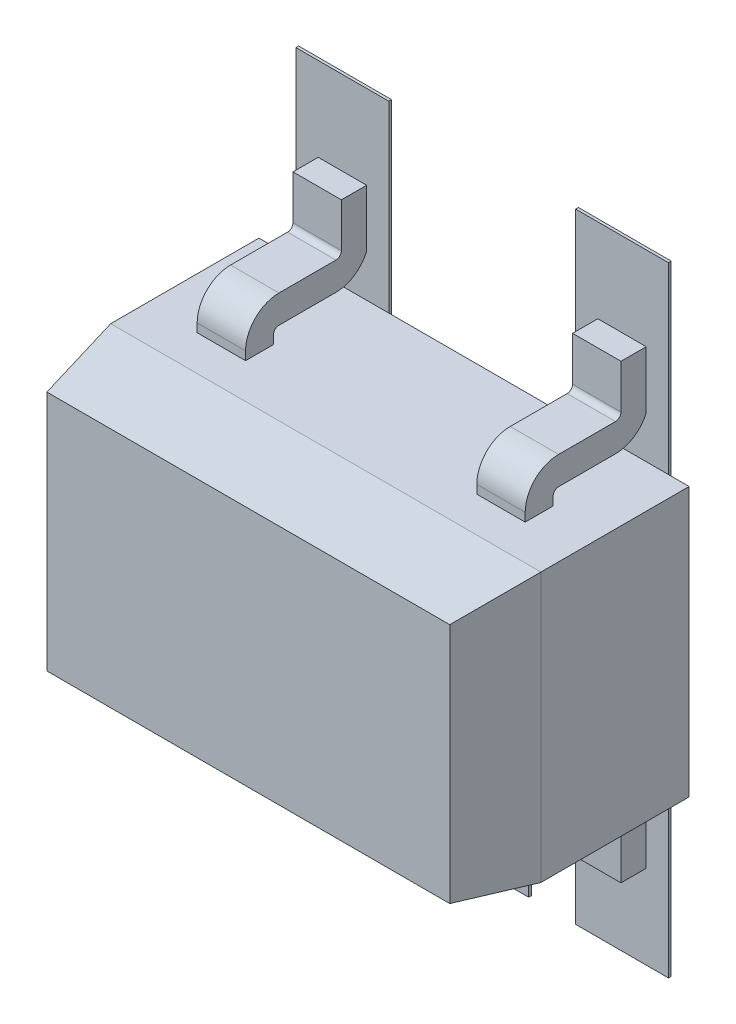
ISO-10303-21;
HEADER;
FILE_DESCRIPTION(('STEP AP214'),'2;1');
FILE_NAME('part.step','',(''),(''),'','','');
FILE_SCHEMA(('AUTOMOTIVE_DESIGN { 1 0 10303 214 1 1 1 1 }'));
ENDSEC;
DATA;
#1=APPLICATION_CONTEXT('core data for automotive mechanical design processes');
#2=APPLICATION_PROTOCOL_DEFINITION('international standard','automotive_design',2000,#1);
#3=PRODUCT_CONTEXT('',#1,'mechanical');
#4=PRODUCT('Part','Part','',(#3));
#5=PRODUCT_RELATED_PRODUCT_CATEGORY('part','',(#4));
#6=PRODUCT_DEFINITION_FORMATION('','',#4);
#7=PRODUCT_DEFINITION_CONTEXT('part definition',#1,'design');
#8=PRODUCT_DEFINITION('design','',#6,#7);
#9=PRODUCT_DEFINITION_SHAPE('','',#8);
#10=(LENGTH_UNIT() NAMED_UNIT(*) SI_UNIT(.MILLI.,.METRE.));
#11=(NAMED_UNIT(*) PLANE_ANGLE_UNIT() SI_UNIT($,.RADIAN.));
#12=(NAMED_UNIT(*) SI_UNIT($,.STERADIAN.) SOLID_ANGLE_UNIT());
#13=UNCERTAINTY_MEASURE_WITH_UNIT(LENGTH_MEASURE(1.E-05),#10,'distance_accuracy_value','');
#14=(GEOMETRIC_REPRESENTATION_CONTEXT(3) GLOBAL_UNCERTAINTY_ASSIGNED_CONTEXT((#13)) GLOBAL_UNIT_ASSIGNED_CONTEXT((#10,
#11,#12)) REPRESENTATION_CONTEXT('',''));
#15=CARTESIAN_POINT('',(0.,0.,0.));
#16=DIRECTION('',(0.,0.,1.));
#17=DIRECTION('',(1.,0.,0.));
#18=AXIS2_PLACEMENT_3D('',#15,#16,#17);
#19=CARTESIAN_POINT('',(0.537498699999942,-1.05000000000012,0.0762));
#20=DIRECTION('',(0.,0.,-1.));
#21=DIRECTION('',(-1.,0.,0.));
#22=AXIS2_PLACEMENT_3D('',#19,#20,#21);
#23=PLANE('',#22);
#24=DIRECTION('',(1.,0.,0.));
#25=VECTOR('',#24,1.);
#26=CARTESIAN_POINT('',(-0.8659876,1.4400022,0.0762));
#27=LINE('',#26,#25);
#28=CARTESIAN_POINT('',(-0.4340098,1.4400022,0.0762));
#29=VERTEX_POINT('',#28);
#30=CARTESIAN_POINT('',(-0.8659876,1.4400022,0.0762));
#31=VERTEX_POINT('',#30);
#32=EDGE_CURVE('E1071',#29,#31,#27,.F.);
#33=ORIENTED_EDGE('',*,*,#32,.F.);
#34=DIRECTION('',(0.,1.,0.));
#35=VECTOR('',#34,1.);
#36=CARTESIAN_POINT('',(-0.4340098,1.4400022,0.0762));
#37=LINE('',#36,#35);
#38=CARTESIAN_POINT('',(-0.4340098,0.499999,0.0762));
#39=VERTEX_POINT('',#38);
#40=EDGE_CURVE('E1092',#39,#29,#37,.T.);
#41=ORIENTED_EDGE('',*,*,#40,.F.);
#42=DIRECTION('',(1.,0.,0.));
#43=VECTOR('',#42,1.);
#44=CARTESIAN_POINT('',(-0.4340098,0.499999,0.0762));
#45=LINE('',#44,#43);
#46=CARTESIAN_POINT('',(-0.8659876,0.499999,0.0762));
#47=VERTEX_POINT('',#46);
#48=EDGE_CURVE('E1086',#47,#39,#45,.T.);
#49=ORIENTED_EDGE('',*,*,#48,.F.);
#50=DIRECTION('',(0.,1.,0.));
#51=VECTOR('',#50,1.);
#52=CARTESIAN_POINT('',(-0.8659876,0.499999,0.0762));
#53=LINE('',#52,#51);
#54=EDGE_CURVE('E1080',#31,#47,#53,.F.);
#55=ORIENTED_EDGE('',*,*,#54,.F.);
#56=EDGE_LOOP('',(#33,#41,#49,#55));
#57=FACE_BOUND('',#56,.T.);
#58=ADVANCED_FACE('F16',(#57),#23,.T.);
#59=CARTESIAN_POINT('',(0.537498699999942,-1.05000000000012,0.0762));
#60=DIRECTION('',(0.,0.,-1.));
#61=DIRECTION('',(-1.,0.,0.));
#62=AXIS2_PLACEMENT_3D('',#59,#60,#61);
#63=PLANE('',#62);
#64=DIRECTION('',(0.,1.,0.));
#65=VECTOR('',#64,1.);
#66=CARTESIAN_POINT('',(0.4340098,0.499999,0.0762));
#67=LINE('',#66,#65);
#68=CARTESIAN_POINT('',(0.4340098,1.4400022,0.0762));
#69=VERTEX_POINT('',#68);
#70=CARTESIAN_POINT('',(0.4340098,0.499999,0.0762));
#71=VERTEX_POINT('',#70);
#72=EDGE_CURVE('E1048',#69,#71,#67,.F.);
#73=ORIENTED_EDGE('',*,*,#72,.F.);
#74=DIRECTION('',(1.,0.,0.));
#75=VECTOR('',#74,1.);
#76=CARTESIAN_POINT('',(0.4340098,1.4400022,0.0762));
#77=LINE('',#76,#75);
#78=CARTESIAN_POINT('',(0.8659876,1.4400022,0.0762));
#79=VERTEX_POINT('',#78);
#80=EDGE_CURVE('E1069',#79,#69,#77,.F.);
#81=ORIENTED_EDGE('',*,*,#80,.F.);
#82=DIRECTION('',(0.,1.,0.));
#83=VECTOR('',#82,1.);
#84=CARTESIAN_POINT('',(0.8659876,1.4400022,0.0762));
#85=LINE('',#84,#83);
#86=CARTESIAN_POINT('',(0.8659876,0.499999,0.0762));
#87=VERTEX_POINT('',#86);
#88=EDGE_CURVE('E1063',#87,#79,#85,.T.);
#89=ORIENTED_EDGE('',*,*,#88,.F.);
#90=DIRECTION('',(1.,0.,0.));
#91=VECTOR('',#90,1.);
#92=CARTESIAN_POINT('',(0.8659876,0.499999,0.0762));
#93=LINE('',#92,#91);
#94=EDGE_CURVE('E1057',#71,#87,#93,.T.);
#95=ORIENTED_EDGE('',*,*,#94,.F.);
#96=EDGE_LOOP('',(#73,#81,#89,#95));
#97=FACE_BOUND('',#96,.T.);
#98=ADVANCED_FACE('F1743',(#97),#63,.T.);
#99=CARTESIAN_POINT('',(0.537498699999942,-1.05000000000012,0.0762));
#100=DIRECTION('',(0.,0.,-1.));
#101=DIRECTION('',(-1.,0.,0.));
#102=AXIS2_PLACEMENT_3D('',#99,#100,#101);
#103=PLANE('',#102);
#104=DIRECTION('',(1.,0.,0.));
#105=VECTOR('',#104,1.);
#106=CARTESIAN_POINT('',(-0.4340098,-1.4400022,0.0762));
#107=LINE('',#106,#105);
#108=CARTESIAN_POINT('',(-0.8659876,-1.4400022,0.0762));
#109=VERTEX_POINT('',#108);
#110=CARTESIAN_POINT('',(-0.4340098,-1.4400022,0.0762));
#111=VERTEX_POINT('',#110);
#112=EDGE_CURVE('E1025',#109,#111,#107,.T.);
#113=ORIENTED_EDGE('',*,*,#112,.F.);
#114=DIRECTION('',(0.,1.,0.));
#115=VECTOR('',#114,1.);
#116=CARTESIAN_POINT('',(-0.8659876,-1.4400022,0.0762));
#117=LINE('',#116,#115);
#118=CARTESIAN_POINT('',(-0.8659876,-0.499999,0.0762));
#119=VERTEX_POINT('',#118);
#120=EDGE_CURVE('E1046',#119,#109,#117,.F.);
#121=ORIENTED_EDGE('',*,*,#120,.F.);
#122=DIRECTION('',(1.,0.,0.));
#123=VECTOR('',#122,1.);
#124=CARTESIAN_POINT('',(-0.8659876,-0.499999,0.0762));
#125=LINE('',#124,#123);
#126=CARTESIAN_POINT('',(-0.4340098,-0.499999,0.0762));
#127=VERTEX_POINT('',#126);
#128=EDGE_CURVE('E1040',#127,#119,#125,.F.);
#129=ORIENTED_EDGE('',*,*,#128,.F.);
#130=DIRECTION('',(0.,1.,0.));
#131=VECTOR('',#130,1.);
#132=CARTESIAN_POINT('',(-0.4340098,-0.499999,0.0762));
#133=LINE('',#132,#131);
#134=EDGE_CURVE('E1034',#111,#127,#133,.T.);
#135=ORIENTED_EDGE('',*,*,#134,.F.);
#136=EDGE_LOOP('',(#113,#121,#129,#135));
#137=FACE_BOUND('',#136,.T.);
#138=ADVANCED_FACE('F1688',(#137),#103,.T.);
#139=CARTESIAN_POINT('',(0.537498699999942,-1.05000000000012,0.0762));
#140=DIRECTION('',(0.,0.,-1.));
#141=DIRECTION('',(-1.,0.,0.));
#142=AXIS2_PLACEMENT_3D('',#139,#140,#141);
#143=PLANE('',#142);
#144=DIRECTION('',(1.,0.,0.));
#145=VECTOR('',#144,1.);
#146=CARTESIAN_POINT('',(0.2160016,-1.4400022,0.0762));
#147=LINE('',#146,#145);
#148=CARTESIAN_POINT('',(-0.2160016,-1.4400022,0.0762));
#149=VERTEX_POINT('',#148);
#150=CARTESIAN_POINT('',(0.2160016,-1.4400022,0.0762));
#151=VERTEX_POINT('',#150);
#152=EDGE_CURVE('E1002',#149,#151,#147,.T.);
#153=ORIENTED_EDGE('',*,*,#152,.F.);
#154=DIRECTION('',(0.,1.,0.));
#155=VECTOR('',#154,1.);
#156=CARTESIAN_POINT('',(-0.2160016,-1.4400022,0.0762));
#157=LINE('',#156,#155);
#158=CARTESIAN_POINT('',(-0.2160016,-0.499999,0.0762));
#159=VERTEX_POINT('',#158);
#160=EDGE_CURVE('E1023',#159,#149,#157,.F.);
#161=ORIENTED_EDGE('',*,*,#160,.F.);
#162=DIRECTION('',(1.,0.,0.));
#163=VECTOR('',#162,1.);
#164=CARTESIAN_POINT('',(-0.2160016,-0.499999,0.0762));
#165=LINE('',#164,#163);
#166=CARTESIAN_POINT('',(0.2160016,-0.499999,0.0762));
#167=VERTEX_POINT('',#166);
#168=EDGE_CURVE('E1017',#167,#159,#165,.F.);
#169=ORIENTED_EDGE('',*,*,#168,.F.);
#170=DIRECTION('',(0.,1.,0.));
#171=VECTOR('',#170,1.);
#172=CARTESIAN_POINT('',(0.2160016,-0.499999,0.0762));
#173=LINE('',#172,#171);
#174=EDGE_CURVE('E1011',#151,#167,#173,.T.);
#175=ORIENTED_EDGE('',*,*,#174,.F.);
#176=EDGE_LOOP('',(#153,#161,#169,#175));
#177=FACE_BOUND('',#176,.T.);
#178=ADVANCED_FACE('F1737',(#177),#143,.T.);
#179=CARTESIAN_POINT('',(0.537498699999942,-1.05000000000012,0.0762));
#180=DIRECTION('',(0.,0.,-1.));
#181=DIRECTION('',(-1.,0.,0.));
#182=AXIS2_PLACEMENT_3D('',#179,#180,#181);
#183=PLANE('',#182);
#184=DIRECTION('',(1.,0.,0.));
#185=VECTOR('',#184,1.);
#186=CARTESIAN_POINT('',(0.8659876,-1.4400022,0.0762));
#187=LINE('',#186,#185);
#188=CARTESIAN_POINT('',(0.4340098,-1.4400022,0.0762));
#189=VERTEX_POINT('',#188);
#190=CARTESIAN_POINT('',(0.8659876,-1.4400022,0.0762));
#191=VERTEX_POINT('',#190);
#192=EDGE_CURVE('E968',#189,#191,#187,.T.);
#193=ORIENTED_EDGE('',*,*,#192,.F.);
#194=DIRECTION('',(0.,1.,0.));
#195=VECTOR('',#194,1.);
#196=CARTESIAN_POINT('',(0.4340098,-1.4400022,0.0762));
#197=LINE('',#196,#195);
#198=CARTESIAN_POINT('',(0.4340098,-0.499999,0.0762));
#199=VERTEX_POINT('',#198);
#200=EDGE_CURVE('E1000',#199,#189,#197,.F.);
#201=ORIENTED_EDGE('',*,*,#200,.F.);
#202=DIRECTION('',(1.,0.,0.));
#203=VECTOR('',#202,1.);
#204=CARTESIAN_POINT('',(0.4340098,-0.499999,0.0762));
#205=LINE('',#204,#203);
#206=CARTESIAN_POINT('',(0.8659876,-0.499999,0.0762));
#207=VERTEX_POINT('',#206);
#208=EDGE_CURVE('E994',#207,#199,#205,.F.);
#209=ORIENTED_EDGE('',*,*,#208,.F.);
#210=DIRECTION('',(0.,1.,0.));
#211=VECTOR('',#210,1.);
#212=CARTESIAN_POINT('',(0.8659876,-0.499999,0.0762));
#213=LINE('',#212,#211);
#214=EDGE_CURVE('E988',#191,#207,#213,.T.);
#215=ORIENTED_EDGE('',*,*,#214,.F.);
#216=EDGE_LOOP('',(#193,#201,#209,#215));
#217=FACE_BOUND('',#216,.T.);
#218=ADVANCED_FACE('F1733',(#217),#183,.T.);
#219=CARTESIAN_POINT('',(-0.4340098,1.4400022,0.0762));
#220=DIRECTION('',(1.,0.,0.));
#221=DIRECTION('',(0.,0.,-1.));
#222=AXIS2_PLACEMENT_3D('',#219,#220,#221);
#223=PLANE('',#222);
#224=DIRECTION('',(0.,0.,-1.));
#225=VECTOR('',#224,1.);
#226=CARTESIAN_POINT('',(-0.4340098,0.499999,0.0762));
#227=LINE('',#226,#225);
#228=CARTESIAN_POINT('',(-0.4340098,0.499999,0.0889));
#229=VERTEX_POINT('',#228);
#230=EDGE_CURVE('E1089',#39,#229,#227,.F.);
#231=ORIENTED_EDGE('',*,*,#230,.F.);
#232=ORIENTED_EDGE('',*,*,#40,.T.);
#233=DIRECTION('',(0.,0.,1.));
#234=VECTOR('',#233,1.);
#235=CARTESIAN_POINT('',(-0.4340098,1.4400022,0.0762));
#236=LINE('',#235,#234);
#237=CARTESIAN_POINT('',(-0.4340098,1.4400022,0.0889));
#238=VERTEX_POINT('',#237);
#239=EDGE_CURVE('E1074',#238,#29,#236,.F.);
#240=ORIENTED_EDGE('',*,*,#239,.F.);
#241=DIRECTION('',(0.,1.,0.));
#242=VECTOR('',#241,1.);
#243=CARTESIAN_POINT('',(-0.4340098,0.,0.0889));
#244=LINE('',#243,#242);
#245=EDGE_CURVE('E966',#238,#229,#244,.F.);
#246=ORIENTED_EDGE('',*,*,#245,.T.);
#247=EDGE_LOOP('',(#231,#232,#240,#246));
#248=FACE_BOUND('',#247,.T.);
#249=ADVANCED_FACE('F1729',(#248),#223,.T.);
#250=CARTESIAN_POINT('',(-0.4340098,0.499999,0.0762));
#251=DIRECTION('',(0.,-1.,0.));
#252=DIRECTION('',(0.,0.,-1.));
#253=AXIS2_PLACEMENT_3D('',#250,#251,#252);
#254=PLANE('',#253);
#255=DIRECTION('',(0.,0.,1.));
#256=VECTOR('',#255,1.);
#257=CARTESIAN_POINT('',(-0.8659876,0.499999,0.0762));
#258=LINE('',#257,#256);
#259=CARTESIAN_POINT('',(-0.8659876,0.499999,0.0889));
#260=VERTEX_POINT('',#259);
#261=EDGE_CURVE('E1083',#47,#260,#258,.T.);
#262=ORIENTED_EDGE('',*,*,#261,.F.);
#263=ORIENTED_EDGE('',*,*,#48,.T.);
#264=ORIENTED_EDGE('',*,*,#230,.T.);
#265=DIRECTION('',(-1.,0.,0.));
#266=VECTOR('',#265,1.);
#267=CARTESIAN_POINT('',(0.,0.499999,0.0889));
#268=LINE('',#267,#266);
#269=EDGE_CURVE('E964',#229,#260,#268,.T.);
#270=ORIENTED_EDGE('',*,*,#269,.T.);
#271=EDGE_LOOP('',(#262,#263,#264,#270));
#272=FACE_BOUND('',#271,.T.);
#273=ADVANCED_FACE('F1725',(#272),#254,.T.);
#274=CARTESIAN_POINT('',(-0.8659876,0.499999,0.0762));
#275=DIRECTION('',(-1.,0.,0.));
#276=DIRECTION('',(0.,0.,1.));
#277=AXIS2_PLACEMENT_3D('',#274,#275,#276);
#278=PLANE('',#277);
#279=DIRECTION('',(0.,0.,1.));
#280=VECTOR('',#279,1.);
#281=CARTESIAN_POINT('',(-0.8659876,1.4400022,0.0762));
#282=LINE('',#281,#280);
#283=CARTESIAN_POINT('',(-0.8659876,1.4400022,0.0889));
#284=VERTEX_POINT('',#283);
#285=EDGE_CURVE('E1077',#31,#284,#282,.T.);
#286=ORIENTED_EDGE('',*,*,#285,.F.);
#287=ORIENTED_EDGE('',*,*,#54,.T.);
#288=ORIENTED_EDGE('',*,*,#261,.T.);
#289=DIRECTION('',(0.,1.,0.));
#290=VECTOR('',#289,1.);
#291=CARTESIAN_POINT('',(-0.8659876,0.,0.0889));
#292=LINE('',#291,#290);
#293=EDGE_CURVE('E962',#260,#284,#292,.T.);
#294=ORIENTED_EDGE('',*,*,#293,.T.);
#295=EDGE_LOOP('',(#286,#287,#288,#294));
#296=FACE_BOUND('',#295,.T.);
#297=ADVANCED_FACE('F1721',(#296),#278,.T.);
#298=CARTESIAN_POINT('',(-0.8659876,1.4400022,0.0762));
#299=DIRECTION('',(0.,1.,0.));
#300=DIRECTION('',(0.,0.,1.));
#301=AXIS2_PLACEMENT_3D('',#298,#299,#300);
#302=PLANE('',#301);
#303=ORIENTED_EDGE('',*,*,#239,.T.);
#304=ORIENTED_EDGE('',*,*,#32,.T.);
#305=ORIENTED_EDGE('',*,*,#285,.T.);
#306=DIRECTION('',(-1.,0.,0.));
#307=VECTOR('',#306,1.);
#308=CARTESIAN_POINT('',(0.,1.4400022,0.0889));
#309=LINE('',#308,#307);
#310=EDGE_CURVE('E957',#284,#238,#309,.F.);
#311=ORIENTED_EDGE('',*,*,#310,.T.);
#312=EDGE_LOOP('',(#303,#304,#305,#311));
#313=FACE_BOUND('',#312,.T.);
#314=ADVANCED_FACE('F1717',(#313),#302,.T.);
#315=CARTESIAN_POINT('',(0.4340098,1.4400022,0.0762));
#316=DIRECTION('',(0.,1.,0.));
#317=DIRECTION('',(0.,0.,1.));
#318=AXIS2_PLACEMENT_3D('',#315,#316,#317);
#319=PLANE('',#318);
#320=DIRECTION('',(0.,0.,-1.));
#321=VECTOR('',#320,1.);
#322=CARTESIAN_POINT('',(0.8659876,1.4400022,0.0762));
#323=LINE('',#322,#321);
#324=CARTESIAN_POINT('',(0.8659876,1.4400022,0.0889));
#325=VERTEX_POINT('',#324);
#326=EDGE_CURVE('E1066',#79,#325,#323,.F.);
#327=ORIENTED_EDGE('',*,*,#326,.F.);
#328=ORIENTED_EDGE('',*,*,#80,.T.);
#329=DIRECTION('',(0.,0.,1.));
#330=VECTOR('',#329,1.);
#331=CARTESIAN_POINT('',(0.4340098,1.4400022,0.0762));
#332=LINE('',#331,#330);
#333=CARTESIAN_POINT('',(0.4340098,1.4400022,0.0889));
#334=VERTEX_POINT('',#333);
#335=EDGE_CURVE('E1051',#334,#69,#332,.F.);
#336=ORIENTED_EDGE('',*,*,#335,.F.);
#337=DIRECTION('',(-1.,0.,0.));
#338=VECTOR('',#337,1.);
#339=CARTESIAN_POINT('',(0.,1.4400022,0.0889));
#340=LINE('',#339,#338);
#341=EDGE_CURVE('E896',#334,#325,#340,.F.);
#342=ORIENTED_EDGE('',*,*,#341,.T.);
#343=EDGE_LOOP('',(#327,#328,#336,#342));
#344=FACE_BOUND('',#343,.T.);
#345=ADVANCED_FACE('F1713',(#344),#319,.T.);
#346=CARTESIAN_POINT('',(0.8659876,1.4400022,0.0762));
#347=DIRECTION('',(1.,0.,0.));
#348=DIRECTION('',(0.,0.,-1.));
#349=AXIS2_PLACEMENT_3D('',#346,#347,#348);
#350=PLANE('',#349);
#351=DIRECTION('',(0.,0.,-1.));
#352=VECTOR('',#351,1.);
#353=CARTESIAN_POINT('',(0.8659876,0.499999,0.0762));
#354=LINE('',#353,#352);
#355=CARTESIAN_POINT('',(0.8659876,0.499999,0.0889));
#356=VERTEX_POINT('',#355);
#357=EDGE_CURVE('E1060',#87,#356,#354,.F.);
#358=ORIENTED_EDGE('',*,*,#357,.F.);
#359=ORIENTED_EDGE('',*,*,#88,.T.);
#360=ORIENTED_EDGE('',*,*,#326,.T.);
#361=DIRECTION('',(0.,1.,0.));
#362=VECTOR('',#361,1.);
#363=CARTESIAN_POINT('',(0.8659876,0.,0.0889));
#364=LINE('',#363,#362);
#365=EDGE_CURVE('E894',#325,#356,#364,.F.);
#366=ORIENTED_EDGE('',*,*,#365,.T.);
#367=EDGE_LOOP('',(#358,#359,#360,#366));
#368=FACE_BOUND('',#367,.T.);
#369=ADVANCED_FACE('F1709',(#368),#350,.T.);
#370=CARTESIAN_POINT('',(0.8659876,0.499999,0.0762));
#371=DIRECTION('',(0.,-1.,0.));
#372=DIRECTION('',(0.,0.,-1.));
#373=AXIS2_PLACEMENT_3D('',#370,#371,#372);
#374=PLANE('',#373);
#375=DIRECTION('',(0.,0.,1.));
#376=VECTOR('',#375,1.);
#377=CARTESIAN_POINT('',(0.4340098,0.499999,0.0762));
#378=LINE('',#377,#376);
#379=CARTESIAN_POINT('',(0.4340098,0.499999,0.0889));
#380=VERTEX_POINT('',#379);
#381=EDGE_CURVE('E1054',#71,#380,#378,.T.);
#382=ORIENTED_EDGE('',*,*,#381,.F.);
#383=ORIENTED_EDGE('',*,*,#94,.T.);
#384=ORIENTED_EDGE('',*,*,#357,.T.);
#385=DIRECTION('',(-1.,0.,0.));
#386=VECTOR('',#385,1.);
#387=CARTESIAN_POINT('',(0.,0.499999,0.0889));
#388=LINE('',#387,#386);
#389=EDGE_CURVE('E892',#356,#380,#388,.T.);
#390=ORIENTED_EDGE('',*,*,#389,.T.);
#391=EDGE_LOOP('',(#382,#383,#384,#390));
#392=FACE_BOUND('',#391,.T.);
#393=ADVANCED_FACE('F1702',(#392),#374,.T.);
#394=CARTESIAN_POINT('',(0.4340098,0.499999,0.0762));
#395=DIRECTION('',(-1.,0.,0.));
#396=DIRECTION('',(0.,0.,1.));
#397=AXIS2_PLACEMENT_3D('',#394,#395,#396);
#398=PLANE('',#397);
#399=ORIENTED_EDGE('',*,*,#335,.T.);
#400=ORIENTED_EDGE('',*,*,#72,.T.);
#401=ORIENTED_EDGE('',*,*,#381,.T.);
#402=DIRECTION('',(0.,1.,0.));
#403=VECTOR('',#402,1.);
#404=CARTESIAN_POINT('',(0.4340098,0.,0.0889));
#405=LINE('',#404,#403);
#406=EDGE_CURVE('E887',#380,#334,#405,.T.);
#407=ORIENTED_EDGE('',*,*,#406,.T.);
#408=EDGE_LOOP('',(#399,#400,#401,#407));
#409=FACE_BOUND('',#408,.T.);
#410=ADVANCED_FACE('F1695',(#409),#398,.T.);
#411=CARTESIAN_POINT('',(-0.8659876,-1.4400022,0.0762));
#412=DIRECTION('',(-1.,0.,0.));
#413=DIRECTION('',(0.,0.,1.));
#414=AXIS2_PLACEMENT_3D('',#411,#412,#413);
#415=PLANE('',#414);
#416=DIRECTION('',(0.,0.,1.));
#417=VECTOR('',#416,1.);
#418=CARTESIAN_POINT('',(-0.8659876,-0.499999,0.0762));
#419=LINE('',#418,#417);
#420=CARTESIAN_POINT('',(-0.8659876,-0.499999,0.0889));
#421=VERTEX_POINT('',#420);
#422=EDGE_CURVE('E1043',#119,#421,#419,.T.);
#423=ORIENTED_EDGE('',*,*,#422,.F.);
#424=ORIENTED_EDGE('',*,*,#120,.T.);
#425=DIRECTION('',(0.,0.,-1.));
#426=VECTOR('',#425,1.);
#427=CARTESIAN_POINT('',(-0.8659876,-1.4400022,0.0762));
#428=LINE('',#427,#426);
#429=CARTESIAN_POINT('',(-0.8659876,-1.4400022,0.0889));
#430=VERTEX_POINT('',#429);
#431=EDGE_CURVE('E1028',#430,#109,#428,.T.);
#432=ORIENTED_EDGE('',*,*,#431,.F.);
#433=DIRECTION('',(0.,1.,0.));
#434=VECTOR('',#433,1.);
#435=CARTESIAN_POINT('',(-0.8659876,0.,0.0889));
#436=LINE('',#435,#434);
#437=EDGE_CURVE('E811',#430,#421,#436,.T.);
#438=ORIENTED_EDGE('',*,*,#437,.T.);
#439=EDGE_LOOP('',(#423,#424,#432,#438));
#440=FACE_BOUND('',#439,.T.);
#441=ADVANCED_FACE('F1693',(#440),#415,.T.);
#442=CARTESIAN_POINT('',(-0.8659876,-0.499999,0.0762));
#443=DIRECTION('',(0.,1.,0.));
#444=DIRECTION('',(0.,0.,1.));
#445=AXIS2_PLACEMENT_3D('',#442,#443,#444);
#446=PLANE('',#445);
#447=DIRECTION('',(0.,0.,-1.));
#448=VECTOR('',#447,1.);
#449=CARTESIAN_POINT('',(-0.4340098,-0.499999,0.0762));
#450=LINE('',#449,#448);
#451=CARTESIAN_POINT('',(-0.4340098,-0.499999,0.0889));
#452=VERTEX_POINT('',#451);
#453=EDGE_CURVE('E1037',#127,#452,#450,.F.);
#454=ORIENTED_EDGE('',*,*,#453,.F.);
#455=ORIENTED_EDGE('',*,*,#128,.T.);
#456=ORIENTED_EDGE('',*,*,#422,.T.);
#457=DIRECTION('',(-1.,0.,0.));
#458=VECTOR('',#457,1.);
#459=CARTESIAN_POINT('',(0.,-0.499999,0.0889));
#460=LINE('',#459,#458);
#461=EDGE_CURVE('E809',#421,#452,#460,.F.);
#462=ORIENTED_EDGE('',*,*,#461,.T.);
#463=EDGE_LOOP('',(#454,#455,#456,#462));
#464=FACE_BOUND('',#463,.T.);
#465=ADVANCED_FACE('F1691',(#464),#446,.T.);
#466=CARTESIAN_POINT('',(-0.4340098,-0.499999,0.0762));
#467=DIRECTION('',(1.,0.,0.));
#468=DIRECTION('',(0.,0.,-1.));
#469=AXIS2_PLACEMENT_3D('',#466,#467,#468);
#470=PLANE('',#469);
#471=DIRECTION('',(0.,0.,-1.));
#472=VECTOR('',#471,1.);
#473=CARTESIAN_POINT('',(-0.4340098,-1.4400022,0.0762));
#474=LINE('',#473,#472);
#475=CARTESIAN_POINT('',(-0.4340098,-1.4400022,0.0889));
#476=VERTEX_POINT('',#475);
#477=EDGE_CURVE('E1031',#111,#476,#474,.F.);
#478=ORIENTED_EDGE('',*,*,#477,.F.);
#479=ORIENTED_EDGE('',*,*,#134,.T.);
#480=ORIENTED_EDGE('',*,*,#453,.T.);
#481=DIRECTION('',(0.,1.,0.));
#482=VECTOR('',#481,1.);
#483=CARTESIAN_POINT('',(-0.4340098,0.,0.0889));
#484=LINE('',#483,#482);
#485=EDGE_CURVE('E807',#452,#476,#484,.F.);
#486=ORIENTED_EDGE('',*,*,#485,.T.);
#487=EDGE_LOOP('',(#478,#479,#480,#486));
#488=FACE_BOUND('',#487,.T.);
#489=ADVANCED_FACE('F1682',(#488),#470,.T.);
#490=CARTESIAN_POINT('',(-0.4340098,-1.4400022,0.0762));
#491=DIRECTION('',(0.,-1.,0.));
#492=DIRECTION('',(0.,0.,-1.));
#493=AXIS2_PLACEMENT_3D('',#490,#491,#492);
#494=PLANE('',#493);
#495=ORIENTED_EDGE('',*,*,#431,.T.);
#496=ORIENTED_EDGE('',*,*,#112,.T.);
#497=ORIENTED_EDGE('',*,*,#477,.T.);
#498=DIRECTION('',(-1.,0.,0.));
#499=VECTOR('',#498,1.);
#500=CARTESIAN_POINT('',(0.,-1.4400022,0.0889));
#501=LINE('',#500,#499);
#502=EDGE_CURVE('E804',#476,#430,#501,.T.);
#503=ORIENTED_EDGE('',*,*,#502,.T.);
#504=EDGE_LOOP('',(#495,#496,#497,#503));
#505=FACE_BOUND('',#504,.T.);
#506=ADVANCED_FACE('F1685',(#505),#494,.T.);
#507=CARTESIAN_POINT('',(-0.2160016,-1.4400022,0.0762));
#508=DIRECTION('',(-1.,0.,0.));
#509=DIRECTION('',(0.,0.,1.));
#510=AXIS2_PLACEMENT_3D('',#507,#508,#509);
#511=PLANE('',#510);
#512=DIRECTION('',(0.,0.,1.));
#513=VECTOR('',#512,1.);
#514=CARTESIAN_POINT('',(-0.2160016,-0.499999,0.0762));
#515=LINE('',#514,#513);
#516=CARTESIAN_POINT('',(-0.2160016,-0.499999,0.0889));
#517=VERTEX_POINT('',#516);
#518=EDGE_CURVE('E1020',#159,#517,#515,.T.);
#519=ORIENTED_EDGE('',*,*,#518,.F.);
#520=ORIENTED_EDGE('',*,*,#160,.T.);
#521=DIRECTION('',(0.,0.,-1.));
#522=VECTOR('',#521,1.);
#523=CARTESIAN_POINT('',(-0.2160016,-1.4400022,0.0762));
#524=LINE('',#523,#522);
#525=CARTESIAN_POINT('',(-0.2160016,-1.4400022,0.0889));
#526=VERTEX_POINT('',#525);
#527=EDGE_CURVE('E1005',#526,#149,#524,.T.);
#528=ORIENTED_EDGE('',*,*,#527,.F.);
#529=DIRECTION('',(0.,1.,0.));
#530=VECTOR('',#529,1.);
#531=CARTESIAN_POINT('',(-0.2160016,0.,0.0889));
#532=LINE('',#531,#530);
#533=EDGE_CURVE('E732',#526,#517,#532,.T.);
#534=ORIENTED_EDGE('',*,*,#533,.T.);
#535=EDGE_LOOP('',(#519,#520,#528,#534));
#536=FACE_BOUND('',#535,.T.);
#537=ADVANCED_FACE('F1831',(#536),#511,.T.);
#538=CARTESIAN_POINT('',(-0.2160016,-0.499999,0.0762));
#539=DIRECTION('',(0.,1.,0.));
#540=DIRECTION('',(0.,0.,1.));
#541=AXIS2_PLACEMENT_3D('',#538,#539,#540);
#542=PLANE('',#541);
#543=DIRECTION('',(0.,0.,-1.));
#544=VECTOR('',#543,1.);
#545=CARTESIAN_POINT('',(0.2160016,-0.499999,0.0762));
#546=LINE('',#545,#544);
#547=CARTESIAN_POINT('',(0.2160016,-0.499999,0.0889));
#548=VERTEX_POINT('',#547);
#549=EDGE_CURVE('E1014',#167,#548,#546,.F.);
#550=ORIENTED_EDGE('',*,*,#549,.F.);
#551=ORIENTED_EDGE('',*,*,#168,.T.);
#552=ORIENTED_EDGE('',*,*,#518,.T.);
#553=DIRECTION('',(-1.,0.,0.));
#554=VECTOR('',#553,1.);
#555=CARTESIAN_POINT('',(0.,-0.499999,0.0889));
#556=LINE('',#555,#554);
#557=EDGE_CURVE('E730',#517,#548,#556,.F.);
#558=ORIENTED_EDGE('',*,*,#557,.T.);
#559=EDGE_LOOP('',(#550,#551,#552,#558));
#560=FACE_BOUND('',#559,.T.);
#561=ADVANCED_FACE('F1827',(#560),#542,.T.);
#562=CARTESIAN_POINT('',(0.2160016,-0.499999,0.0762));
#563=DIRECTION('',(1.,0.,0.));
#564=DIRECTION('',(0.,0.,-1.));
#565=AXIS2_PLACEMENT_3D('',#562,#563,#564);
#566=PLANE('',#565);
#567=DIRECTION('',(0.,0.,-1.));
#568=VECTOR('',#567,1.);
#569=CARTESIAN_POINT('',(0.2160016,-1.4400022,0.0762));
#570=LINE('',#569,#568);
#571=CARTESIAN_POINT('',(0.2160016,-1.4400022,0.0889));
#572=VERTEX_POINT('',#571);
#573=EDGE_CURVE('E1008',#151,#572,#570,.F.);
#574=ORIENTED_EDGE('',*,*,#573,.F.);
#575=ORIENTED_EDGE('',*,*,#174,.T.);
#576=ORIENTED_EDGE('',*,*,#549,.T.);
#577=DIRECTION('',(0.,1.,0.));
#578=VECTOR('',#577,1.);
#579=CARTESIAN_POINT('',(0.2160016,0.,0.0889));
#580=LINE('',#579,#578);
#581=EDGE_CURVE('E728',#548,#572,#580,.F.);
#582=ORIENTED_EDGE('',*,*,#581,.T.);
#583=EDGE_LOOP('',(#574,#575,#576,#582));
#584=FACE_BOUND('',#583,.T.);
#585=ADVANCED_FACE('F1823',(#584),#566,.T.);
#586=CARTESIAN_POINT('',(0.2160016,-1.4400022,0.0762));
#587=DIRECTION('',(0.,-1.,0.));
#588=DIRECTION('',(0.,0.,-1.));
#589=AXIS2_PLACEMENT_3D('',#586,#587,#588);
#590=PLANE('',#589);
#591=ORIENTED_EDGE('',*,*,#527,.T.);
#592=ORIENTED_EDGE('',*,*,#152,.T.);
#593=ORIENTED_EDGE('',*,*,#573,.T.);
#594=DIRECTION('',(-1.,0.,0.));
#595=VECTOR('',#594,1.);
#596=CARTESIAN_POINT('',(0.,-1.4400022,0.0889));
#597=LINE('',#596,#595);
#598=EDGE_CURVE('E725',#572,#526,#597,.T.);
#599=ORIENTED_EDGE('',*,*,#598,.T.);
#600=EDGE_LOOP('',(#591,#592,#593,#599));
#601=FACE_BOUND('',#600,.T.);
#602=ADVANCED_FACE('F1819',(#601),#590,.T.);
#603=CARTESIAN_POINT('',(0.4340098,-1.4400022,0.0762));
#604=DIRECTION('',(-1.,0.,0.));
#605=DIRECTION('',(0.,0.,1.));
#606=AXIS2_PLACEMENT_3D('',#603,#604,#605);
#607=PLANE('',#606);
#608=DIRECTION('',(0.,0.,1.));
#609=VECTOR('',#608,1.);
#610=CARTESIAN_POINT('',(0.4340098,-0.499999,0.0762));
#611=LINE('',#610,#609);
#612=CARTESIAN_POINT('',(0.4340098,-0.499999,0.0889));
#613=VERTEX_POINT('',#612);
#614=EDGE_CURVE('E997',#199,#613,#611,.T.);
#615=ORIENTED_EDGE('',*,*,#614,.F.);
#616=ORIENTED_EDGE('',*,*,#200,.T.);
#617=DIRECTION('',(0.,0.,-1.));
#618=VECTOR('',#617,1.);
#619=CARTESIAN_POINT('',(0.4340098,-1.4400022,0.0762));
#620=LINE('',#619,#618);
#621=CARTESIAN_POINT('',(0.4340098,-1.4400022,0.0889));
#622=VERTEX_POINT('',#621);
#623=EDGE_CURVE('E982',#622,#189,#620,.T.);
#624=ORIENTED_EDGE('',*,*,#623,.F.);
#625=DIRECTION('',(0.,1.,0.));
#626=VECTOR('',#625,1.);
#627=CARTESIAN_POINT('',(0.4340098,0.,0.0889));
#628=LINE('',#627,#626);
#629=EDGE_CURVE('E653',#622,#613,#628,.T.);
#630=ORIENTED_EDGE('',*,*,#629,.T.);
#631=EDGE_LOOP('',(#615,#616,#624,#630));
#632=FACE_BOUND('',#631,.T.);
#633=ADVANCED_FACE('F1815',(#632),#607,.T.);
#634=CARTESIAN_POINT('',(0.4340098,-0.499999,0.0762));
#635=DIRECTION('',(0.,1.,0.));
#636=DIRECTION('',(0.,0.,1.));
#637=AXIS2_PLACEMENT_3D('',#634,#635,#636);
#638=PLANE('',#637);
#639=DIRECTION('',(0.,0.,-1.));
#640=VECTOR('',#639,1.);
#641=CARTESIAN_POINT('',(0.8659876,-0.499999,0.0762));
#642=LINE('',#641,#640);
#643=CARTESIAN_POINT('',(0.8659876,-0.499999,0.0889));
#644=VERTEX_POINT('',#643);
#645=EDGE_CURVE('E991',#207,#644,#642,.F.);
#646=ORIENTED_EDGE('',*,*,#645,.F.);
#647=ORIENTED_EDGE('',*,*,#208,.T.);
#648=ORIENTED_EDGE('',*,*,#614,.T.);
#649=DIRECTION('',(-1.,0.,0.));
#650=VECTOR('',#649,1.);
#651=CARTESIAN_POINT('',(0.,-0.499999,0.0889));
#652=LINE('',#651,#650);
#653=EDGE_CURVE('E651',#613,#644,#652,.F.);
#654=ORIENTED_EDGE('',*,*,#653,.T.);
#655=EDGE_LOOP('',(#646,#647,#648,#654));
#656=FACE_BOUND('',#655,.T.);
#657=ADVANCED_FACE('F1811',(#656),#638,.T.);
#658=CARTESIAN_POINT('',(0.8659876,-0.499999,0.0762));
#659=DIRECTION('',(1.,0.,0.));
#660=DIRECTION('',(0.,0.,-1.));
#661=AXIS2_PLACEMENT_3D('',#658,#659,#660);
#662=PLANE('',#661);
#663=DIRECTION('',(0.,0.,-1.));
#664=VECTOR('',#663,1.);
#665=CARTESIAN_POINT('',(0.8659876,-1.4400022,0.0762));
#666=LINE('',#665,#664);
#667=CARTESIAN_POINT('',(0.8659876,-1.4400022,0.0889));
#668=VERTEX_POINT('',#667);
#669=EDGE_CURVE('E985',#191,#668,#666,.F.);
#670=ORIENTED_EDGE('',*,*,#669,.F.);
#671=ORIENTED_EDGE('',*,*,#214,.T.);
#672=ORIENTED_EDGE('',*,*,#645,.T.);
#673=DIRECTION('',(0.,1.,0.));
#674=VECTOR('',#673,1.);
#675=CARTESIAN_POINT('',(0.8659876,0.,0.0889));
#676=LINE('',#675,#674);
#677=EDGE_CURVE('E649',#644,#668,#676,.F.);
#678=ORIENTED_EDGE('',*,*,#677,.T.);
#679=EDGE_LOOP('',(#670,#671,#672,#678));
#680=FACE_BOUND('',#679,.T.);
#681=ADVANCED_FACE('F1807',(#680),#662,.T.);
#682=CARTESIAN_POINT('',(0.8659876,-1.4400022,0.0762));
#683=DIRECTION('',(0.,-1.,0.));
#684=DIRECTION('',(0.,0.,-1.));
#685=AXIS2_PLACEMENT_3D('',#682,#683,#684);
#686=PLANE('',#685);
#687=ORIENTED_EDGE('',*,*,#623,.T.);
#688=ORIENTED_EDGE('',*,*,#192,.T.);
#689=ORIENTED_EDGE('',*,*,#669,.T.);
#690=DIRECTION('',(-1.,0.,0.));
#691=VECTOR('',#690,1.);
#692=CARTESIAN_POINT('',(0.,-1.4400022,0.0889));
#693=LINE('',#692,#691);
#694=EDGE_CURVE('E646',#668,#622,#693,.T.);
#695=ORIENTED_EDGE('',*,*,#694,.T.);
#696=EDGE_LOOP('',(#687,#688,#689,#695));
#697=FACE_BOUND('',#696,.T.);
#698=ADVANCED_FACE('F1803',(#697),#686,.T.);
#699=CARTESIAN_POINT('',(0.,0.,0.0889));
#700=DIRECTION('',(0.,0.,-1.));
#701=DIRECTION('',(-1.,0.,0.));
#702=AXIS2_PLACEMENT_3D('',#699,#700,#701);
#703=PLANE('',#702);
#704=DIRECTION('',(0.,1.,0.));
#705=VECTOR('',#704,1.);
#706=CARTESIAN_POINT('',(-0.537498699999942,0.,0.0889));
#707=LINE('',#706,#705);
#708=CARTESIAN_POINT('',(-0.537498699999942,0.783870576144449,0.0888999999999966));
#709=VERTEX_POINT('',#708);
#710=CARTESIAN_POINT('',(-0.537498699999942,1.05000000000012,0.0889));
#711=VERTEX_POINT('',#710);
#712=EDGE_CURVE('E971',#709,#711,#707,.T.);
#713=ORIENTED_EDGE('',*,*,#712,.F.);
#714=DIRECTION('',(1.,0.,0.));
#715=VECTOR('',#714,1.);
#716=CARTESIAN_POINT('',(-0.762498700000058,0.783870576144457,0.0888999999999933));
#717=LINE('',#716,#715);
#718=CARTESIAN_POINT('',(-0.762498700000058,0.783870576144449,0.0888999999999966));
#719=VERTEX_POINT('',#718);
#720=EDGE_CURVE('E898',#719,#709,#717,.T.);
#721=ORIENTED_EDGE('',*,*,#720,.F.);
#722=DIRECTION('',(0.,1.,0.));
#723=VECTOR('',#722,1.);
#724=CARTESIAN_POINT('',(-0.762498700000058,0.,0.0889));
#725=LINE('',#724,#723);
#726=CARTESIAN_POINT('',(-0.762498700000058,1.05000000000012,0.0889));
#727=VERTEX_POINT('',#726);
#728=EDGE_CURVE('E936',#719,#727,#725,.T.);
#729=ORIENTED_EDGE('',*,*,#728,.T.);
#730=DIRECTION('',(1.,0.,0.));
#731=VECTOR('',#730,1.);
#732=CARTESIAN_POINT('',(-0.762498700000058,1.05000000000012,0.0889));
#733=LINE('',#732,#731);
#734=EDGE_CURVE('E947',#711,#727,#733,.F.);
#735=ORIENTED_EDGE('',*,*,#734,.F.);
#736=EDGE_LOOP('',(#713,#721,#729,#735));
#737=FACE_BOUND('',#736,.T.);
#738=ORIENTED_EDGE('',*,*,#293,.F.);
#739=ORIENTED_EDGE('',*,*,#269,.F.);
#740=ORIENTED_EDGE('',*,*,#245,.F.);
#741=ORIENTED_EDGE('',*,*,#310,.F.);
#742=EDGE_LOOP('',(#738,#739,#740,#741));
#743=FACE_BOUND('',#742,.T.);
#744=ADVANCED_FACE('F1799',(#737,#743),#703,.F.);
#745=CARTESIAN_POINT('',(-0.762498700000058,1.05000000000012,0.0762));
#746=DIRECTION('',(0.,1.,0.));
#747=DIRECTION('',(0.,0.,1.));
#748=AXIS2_PLACEMENT_3D('',#745,#746,#747);
#749=PLANE('',#748);
#750=DIRECTION('',(0.,0.,-1.));
#751=VECTOR('',#750,1.);
#752=CARTESIAN_POINT('',(-0.537498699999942,1.05000000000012,0.));
#753=LINE('',#752,#751);
#754=CARTESIAN_POINT('',(-0.537498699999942,1.05000000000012,0.206199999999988));
#755=VERTEX_POINT('',#754);
#756=EDGE_CURVE('E575',#711,#755,#753,.F.);
#757=ORIENTED_EDGE('',*,*,#756,.F.);
#758=ORIENTED_EDGE('',*,*,#734,.T.);
#759=DIRECTION('',(0.,0.,-1.));
#760=VECTOR('',#759,1.);
#761=CARTESIAN_POINT('',(-0.762498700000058,1.05000000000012,0.));
#762=LINE('',#761,#760);
#763=CARTESIAN_POINT('',(-0.762498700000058,1.05000000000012,0.206199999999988));
#764=VERTEX_POINT('',#763);
#765=EDGE_CURVE('E950',#727,#764,#762,.F.);
#766=ORIENTED_EDGE('',*,*,#765,.T.);
#767=DIRECTION('',(1.,0.,0.));
#768=VECTOR('',#767,1.);
#769=CARTESIAN_POINT('',(-0.762498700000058,1.05000000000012,0.206199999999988));
#770=LINE('',#769,#768);
#771=EDGE_CURVE('E944',#755,#764,#770,.F.);
#772=ORIENTED_EDGE('',*,*,#771,.F.);
#773=EDGE_LOOP('',(#757,#758,#766,#772));
#774=FACE_BOUND('',#773,.T.);
#775=ADVANCED_FACE('F1796',(#774),#749,.T.);
#776=CARTESIAN_POINT('',(-0.762498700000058,1.05000000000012,0.206199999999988));
#777=DIRECTION('',(0.,0.,1.));
#778=DIRECTION('',(1.,0.,0.));
#779=AXIS2_PLACEMENT_3D('',#776,#777,#778);
#780=PLANE('',#779);
#781=ORIENTED_EDGE('',*,*,#771,.T.);
#782=DIRECTION('',(0.,1.,0.));
#783=VECTOR('',#782,1.);
#784=CARTESIAN_POINT('',(-0.762498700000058,0.,0.206199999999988));
#785=LINE('',#784,#783);
#786=CARTESIAN_POINT('',(-0.762498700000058,0.845400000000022,0.206199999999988));
#787=VERTEX_POINT('',#786);
#788=EDGE_CURVE('E952',#764,#787,#785,.F.);
#789=ORIENTED_EDGE('',*,*,#788,.T.);
#790=DIRECTION('',(1.,0.,0.));
#791=VECTOR('',#790,1.);
#792=CARTESIAN_POINT('',(-0.762498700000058,0.845400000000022,0.206199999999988));
#793=LINE('',#792,#791);
#794=CARTESIAN_POINT('',(-0.537498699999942,0.845400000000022,0.206199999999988));
#795=VERTEX_POINT('',#794);
#796=EDGE_CURVE('E547',#787,#795,#793,.T.);
#797=ORIENTED_EDGE('',*,*,#796,.T.);
#798=DIRECTION('',(0.,1.,0.));
#799=VECTOR('',#798,1.);
#800=CARTESIAN_POINT('',(-0.537498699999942,0.,0.206199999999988));
#801=LINE('',#800,#799);
#802=EDGE_CURVE('E574',#755,#795,#801,.F.);
#803=ORIENTED_EDGE('',*,*,#802,.F.);
#804=EDGE_LOOP('',(#781,#789,#797,#803));
#805=FACE_BOUND('',#804,.T.);
#806=ADVANCED_FACE('F1793',(#805),#780,.T.);
#807=CARTESIAN_POINT('',(-0.762498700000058,0.845400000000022,0.231599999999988));
#808=DIRECTION('',(1.,0.,0.));
#809=DIRECTION('',(0.,0.,-1.));
#810=AXIS2_PLACEMENT_3D('',#807,#808,#809);
#811=CYLINDRICAL_SURFACE('',#810,0.0254);
#812=CARTESIAN_POINT('',(-0.537498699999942,0.845400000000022,0.231599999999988));
#813=DIRECTION('',(1.,0.,0.));
#814=DIRECTION('',(0.,0.,-1.));
#815=AXIS2_PLACEMENT_3D('',#812,#813,#814);
#816=CIRCLE('',#815,0.0254);
#817=CARTESIAN_POINT('',(-0.537498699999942,0.820000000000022,0.231599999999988));
#818=VERTEX_POINT('',#817);
#819=EDGE_CURVE('E19',#795,#818,#816,.F.);
#820=ORIENTED_EDGE('',*,*,#819,.F.);
#821=ORIENTED_EDGE('',*,*,#796,.F.);
#822=CARTESIAN_POINT('',(-0.762498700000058,0.845400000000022,0.231599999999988));
#823=DIRECTION('',(1.,0.,0.));
#824=DIRECTION('',(0.,0.,-1.));
#825=AXIS2_PLACEMENT_3D('',#822,#823,#824);
#826=CIRCLE('',#825,0.0254);
#827=CARTESIAN_POINT('',(-0.762498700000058,0.820000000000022,0.231599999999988));
#828=VERTEX_POINT('',#827);
#829=EDGE_CURVE('E558',#787,#828,#826,.F.);
#830=ORIENTED_EDGE('',*,*,#829,.T.);
#831=DIRECTION('',(1.,0.,0.));
#832=VECTOR('',#831,1.);
#833=CARTESIAN_POINT('',(-0.762498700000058,0.820000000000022,0.231599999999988));
#834=LINE('',#833,#832);
#835=EDGE_CURVE('E552',#818,#828,#834,.F.);
#836=ORIENTED_EDGE('',*,*,#835,.F.);
#837=EDGE_LOOP('',(#820,#821,#830,#836));
#838=FACE_BOUND('',#837,.T.);
#839=ADVANCED_FACE('F554',(#838),#811,.F.);
#840=CARTESIAN_POINT('',(-0.762498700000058,0.820000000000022,0.231599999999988));
#841=DIRECTION('',(0.,1.,0.));
#842=DIRECTION('',(0.,0.,1.));
#843=AXIS2_PLACEMENT_3D('',#840,#841,#842);
#844=PLANE('',#843);
#845=ORIENTED_EDGE('',*,*,#835,.T.);
#846=DIRECTION('',(0.,0.,-1.));
#847=VECTOR('',#846,1.);
#848=CARTESIAN_POINT('',(-0.762498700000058,0.820000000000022,0.));
#849=LINE('',#848,#847);
#850=CARTESIAN_POINT('',(-0.762498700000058,0.820000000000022,0.496237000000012));
#851=VERTEX_POINT('',#850);
#852=EDGE_CURVE('E1206',#828,#851,#849,.F.);
#853=ORIENTED_EDGE('',*,*,#852,.T.);
#854=DIRECTION('',(1.,0.,0.));
#855=VECTOR('',#854,1.);
#856=CARTESIAN_POINT('',(-0.762498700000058,0.820000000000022,0.496237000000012));
#857=LINE('',#856,#855);
#858=CARTESIAN_POINT('',(-0.537498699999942,0.820000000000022,0.496237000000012));
#859=VERTEX_POINT('',#858);
#860=EDGE_CURVE('E561',#859,#851,#857,.F.);
#861=ORIENTED_EDGE('',*,*,#860,.F.);
#862=DIRECTION('',(0.,0.,-1.));
#863=VECTOR('',#862,1.);
#864=CARTESIAN_POINT('',(-0.537498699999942,0.820000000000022,0.));
#865=LINE('',#864,#863);
#866=EDGE_CURVE('E564',#818,#859,#865,.F.);
#867=ORIENTED_EDGE('',*,*,#866,.F.);
#868=EDGE_LOOP('',(#845,#853,#861,#867));
#869=FACE_BOUND('',#868,.T.);
#870=ADVANCED_FACE('F565',(#869),#844,.T.);
#871=CARTESIAN_POINT('',(-0.762498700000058,0.664600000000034,0.496237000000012));
#872=DIRECTION('',(1.,0.,0.));
#873=DIRECTION('',(0.,0.,-1.));
#874=AXIS2_PLACEMENT_3D('',#871,#872,#873);
#875=CYLINDRICAL_SURFACE('',#874,0.155399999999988);
#876=ORIENTED_EDGE('',*,*,#860,.T.);
#877=CARTESIAN_POINT('',(-0.762498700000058,0.664600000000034,0.496237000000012));
#878=DIRECTION('',(1.,0.,0.));
#879=DIRECTION('',(0.,0.,-1.));
#880=AXIS2_PLACEMENT_3D('',#877,#878,#879);
#881=CIRCLE('',#880,0.155399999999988);
#882=CARTESIAN_POINT('',(-0.762498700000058,0.664600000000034,0.651637));
#883=VERTEX_POINT('',#882);
#884=EDGE_CURVE('E1203',#851,#883,#881,.T.);
#885=ORIENTED_EDGE('',*,*,#884,.T.);
#886=DIRECTION('',(1.,0.,0.));
#887=VECTOR('',#886,1.);
#888=CARTESIAN_POINT('',(-0.762498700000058,0.664600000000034,0.651637));
#889=LINE('',#888,#887);
#890=CARTESIAN_POINT('',(-0.537498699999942,0.664600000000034,0.651637));
#891=VERTEX_POINT('',#890);
#892=EDGE_CURVE('E933',#891,#883,#889,.F.);
#893=ORIENTED_EDGE('',*,*,#892,.F.);
#894=CARTESIAN_POINT('',(-0.537498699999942,0.664600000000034,0.496237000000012));
#895=DIRECTION('',(1.,0.,0.));
#896=DIRECTION('',(0.,0.,-1.));
#897=AXIS2_PLACEMENT_3D('',#894,#895,#896);
#898=CIRCLE('',#897,0.155399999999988);
#899=EDGE_CURVE('E569',#859,#891,#898,.T.);
#900=ORIENTED_EDGE('',*,*,#899,.F.);
#901=EDGE_LOOP('',(#876,#885,#893,#900));
#902=FACE_BOUND('',#901,.T.);
#903=ADVANCED_FACE('F1784',(#902),#875,.T.);
#904=CARTESIAN_POINT('',(-0.762498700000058,0.664600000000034,0.496237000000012));
#905=DIRECTION('',(1.,0.,0.));
#906=DIRECTION('',(0.,0.,-1.));
#907=AXIS2_PLACEMENT_3D('',#904,#905,#906);
#908=CYLINDRICAL_SURFACE('',#907,0.0254);
#909=CARTESIAN_POINT('',(-0.537498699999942,0.664600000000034,0.496237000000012));
#910=DIRECTION('',(1.,0.,0.));
#911=DIRECTION('',(0.,0.,-1.));
#912=AXIS2_PLACEMENT_3D('',#909,#910,#911);
#913=CIRCLE('',#912,0.0254);
#914=CARTESIAN_POINT('',(-0.537498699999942,0.664600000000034,0.521637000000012));
#915=VERTEX_POINT('',#914);
#916=CARTESIAN_POINT('',(-0.537498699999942,0.690000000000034,0.496237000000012));
#917=VERTEX_POINT('',#916);
#918=EDGE_CURVE('E1211',#915,#917,#913,.F.);
#919=ORIENTED_EDGE('',*,*,#918,.F.);
#920=DIRECTION('',(-1.,0.,0.));
#921=VECTOR('',#920,1.);
#922=CARTESIAN_POINT('',(-0.762498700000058,0.664600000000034,0.521637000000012));
#923=LINE('',#922,#921);
#924=CARTESIAN_POINT('',(-0.762498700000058,0.664600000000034,0.521637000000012));
#925=VERTEX_POINT('',#924);
#926=EDGE_CURVE('E577',#925,#915,#923,.F.);
#927=ORIENTED_EDGE('',*,*,#926,.F.);
#928=CARTESIAN_POINT('',(-0.762498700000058,0.664600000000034,0.496237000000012));
#929=DIRECTION('',(1.,0.,0.));
#930=DIRECTION('',(0.,0.,-1.));
#931=AXIS2_PLACEMENT_3D('',#928,#929,#930);
#932=CIRCLE('',#931,0.0254);
#933=CARTESIAN_POINT('',(-0.762498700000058,0.690000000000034,0.496237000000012));
#934=VERTEX_POINT('',#933);
#935=EDGE_CURVE('E1200',#925,#934,#932,.F.);
#936=ORIENTED_EDGE('',*,*,#935,.T.);
#937=DIRECTION('',(1.,0.,0.));
#938=VECTOR('',#937,1.);
#939=CARTESIAN_POINT('',(-0.762498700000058,0.690000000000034,0.496237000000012));
#940=LINE('',#939,#938);
#941=EDGE_CURVE('E916',#917,#934,#940,.F.);
#942=ORIENTED_EDGE('',*,*,#941,.F.);
#943=EDGE_LOOP('',(#919,#927,#936,#942));
#944=FACE_BOUND('',#943,.T.);
#945=ADVANCED_FACE('F1780',(#944),#908,.F.);
#946=CARTESIAN_POINT('',(-0.762498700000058,0.690000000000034,0.496237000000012));
#947=DIRECTION('',(0.,-1.,0.));
#948=DIRECTION('',(0.,0.,-1.));
#949=AXIS2_PLACEMENT_3D('',#946,#947,#948);
#950=PLANE('',#949);
#951=ORIENTED_EDGE('',*,*,#941,.T.);
#952=DIRECTION('',(0.,0.,-1.));
#953=VECTOR('',#952,1.);
#954=CARTESIAN_POINT('',(-0.762498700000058,0.690000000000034,0.));
#955=LINE('',#954,#953);
#956=CARTESIAN_POINT('',(-0.762498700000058,0.690000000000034,0.231599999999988));
#957=VERTEX_POINT('',#956);
#958=EDGE_CURVE('E1199',#934,#957,#955,.T.);
#959=ORIENTED_EDGE('',*,*,#958,.T.);
#960=DIRECTION('',(1.,0.,0.));
#961=VECTOR('',#960,1.);
#962=CARTESIAN_POINT('',(-0.762498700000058,0.690000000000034,0.231599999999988));
#963=LINE('',#962,#961);
#964=CARTESIAN_POINT('',(-0.537498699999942,0.690000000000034,0.231599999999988));
#965=VERTEX_POINT('',#964);
#966=EDGE_CURVE('E913',#965,#957,#963,.F.);
#967=ORIENTED_EDGE('',*,*,#966,.F.);
#968=DIRECTION('',(0.,0.,-1.));
#969=VECTOR('',#968,1.);
#970=CARTESIAN_POINT('',(-0.537498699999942,0.690000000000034,0.));
#971=LINE('',#970,#969);
#972=EDGE_CURVE('E1210',#917,#965,#971,.T.);
#973=ORIENTED_EDGE('',*,*,#972,.F.);
#974=EDGE_LOOP('',(#951,#959,#967,#973));
#975=FACE_BOUND('',#974,.T.);
#976=ADVANCED_FACE('F1772',(#975),#950,.T.);
#977=CARTESIAN_POINT('',(-0.762498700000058,0.845400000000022,0.231599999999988));
#978=DIRECTION('',(1.,0.,0.));
#979=DIRECTION('',(0.,0.,-1.));
#980=AXIS2_PLACEMENT_3D('',#977,#978,#979);
#981=CYLINDRICAL_SURFACE('',#980,0.155399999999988);
#982=CARTESIAN_POINT('',(-0.762498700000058,0.845400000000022,0.231599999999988));
#983=DIRECTION('',(1.,0.,0.));
#984=DIRECTION('',(0.,0.,-1.));
#985=AXIS2_PLACEMENT_3D('',#982,#983,#984);
#986=CIRCLE('',#985,0.155399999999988);
#987=EDGE_CURVE('E843',#957,#719,#986,.T.);
#988=ORIENTED_EDGE('',*,*,#987,.T.);
#989=ORIENTED_EDGE('',*,*,#720,.T.);
#990=CARTESIAN_POINT('',(-0.537498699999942,0.845400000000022,0.231599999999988));
#991=DIRECTION('',(1.,0.,0.));
#992=DIRECTION('',(0.,0.,-1.));
#993=AXIS2_PLACEMENT_3D('',#990,#991,#992);
#994=CIRCLE('',#993,0.155399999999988);
#995=EDGE_CURVE('E1208',#965,#709,#994,.T.);
#996=ORIENTED_EDGE('',*,*,#995,.F.);
#997=ORIENTED_EDGE('',*,*,#966,.T.);
#998=EDGE_LOOP('',(#988,#989,#996,#997));
#999=FACE_BOUND('',#998,.T.);
#1000=ADVANCED_FACE('F1762',(#999),#981,.T.);
#1001=CARTESIAN_POINT('',(0.,0.,0.0889));
#1002=DIRECTION('',(0.,0.,-1.));
#1003=DIRECTION('',(-1.,0.,0.));
#1004=AXIS2_PLACEMENT_3D('',#1001,#1002,#1003);
#1005=PLANE('',#1004);
#1006=DIRECTION('',(0.,1.,0.));
#1007=VECTOR('',#1006,1.);
#1008=CARTESIAN_POINT('',(0.762498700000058,0.,0.0889));
#1009=LINE('',#1008,#1007);
#1010=CARTESIAN_POINT('',(0.762498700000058,0.783870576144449,0.0888999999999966));
#1011=VERTEX_POINT('',#1010);
#1012=CARTESIAN_POINT('',(0.762498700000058,1.05000000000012,0.0889));
#1013=VERTEX_POINT('',#1012);
#1014=EDGE_CURVE('E901',#1011,#1013,#1009,.T.);
#1015=ORIENTED_EDGE('',*,*,#1014,.F.);
#1016=DIRECTION('',(1.,0.,0.));
#1017=VECTOR('',#1016,1.);
#1018=CARTESIAN_POINT('',(0.537498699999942,0.783870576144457,0.0888999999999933));
#1019=LINE('',#1018,#1017);
#1020=CARTESIAN_POINT('',(0.537498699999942,0.783870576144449,0.0888999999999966));
#1021=VERTEX_POINT('',#1020);
#1022=EDGE_CURVE('E813',#1021,#1011,#1019,.T.);
#1023=ORIENTED_EDGE('',*,*,#1022,.F.);
#1024=DIRECTION('',(0.,1.,0.));
#1025=VECTOR('',#1024,1.);
#1026=CARTESIAN_POINT('',(0.537498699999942,0.,0.0889));
#1027=LINE('',#1026,#1025);
#1028=CARTESIAN_POINT('',(0.537498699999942,1.05000000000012,0.0889));
#1029=VERTEX_POINT('',#1028);
#1030=EDGE_CURVE('E861',#1021,#1029,#1027,.T.);
#1031=ORIENTED_EDGE('',*,*,#1030,.T.);
#1032=DIRECTION('',(1.,0.,0.));
#1033=VECTOR('',#1032,1.);
#1034=CARTESIAN_POINT('',(0.537498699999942,1.05000000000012,0.0889));
#1035=LINE('',#1034,#1033);
#1036=EDGE_CURVE('E877',#1013,#1029,#1035,.F.);
#1037=ORIENTED_EDGE('',*,*,#1036,.F.);
#1038=EDGE_LOOP('',(#1015,#1023,#1031,#1037));
#1039=FACE_BOUND('',#1038,.T.);
#1040=ORIENTED_EDGE('',*,*,#389,.F.);
#1041=ORIENTED_EDGE('',*,*,#365,.F.);
#1042=ORIENTED_EDGE('',*,*,#341,.F.);
#1043=ORIENTED_EDGE('',*,*,#406,.F.);
#1044=EDGE_LOOP('',(#1040,#1041,#1042,#1043));
#1045=FACE_BOUND('',#1044,.T.);
#1046=ADVANCED_FACE('F1759',(#1039,#1045),#1005,.F.);
#1047=CARTESIAN_POINT('',(0.537498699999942,1.05000000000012,0.0762));
#1048=DIRECTION('',(0.,1.,0.));
#1049=DIRECTION('',(0.,0.,1.));
#1050=AXIS2_PLACEMENT_3D('',#1047,#1048,#1049);
#1051=PLANE('',#1050);
#1052=DIRECTION('',(0.,0.,-1.));
#1053=VECTOR('',#1052,1.);
#1054=CARTESIAN_POINT('',(0.762498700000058,1.05000000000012,0.));
#1055=LINE('',#1054,#1053);
#1056=CARTESIAN_POINT('',(0.762498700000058,1.05000000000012,0.206199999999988));
#1057=VERTEX_POINT('',#1056);
#1058=EDGE_CURVE('E842',#1013,#1057,#1055,.F.);
#1059=ORIENTED_EDGE('',*,*,#1058,.F.);
#1060=ORIENTED_EDGE('',*,*,#1036,.T.);
#1061=DIRECTION('',(0.,0.,-1.));
#1062=VECTOR('',#1061,1.);
#1063=CARTESIAN_POINT('',(0.537498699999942,1.05000000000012,0.));
#1064=LINE('',#1063,#1062);
#1065=CARTESIAN_POINT('',(0.537498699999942,1.05000000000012,0.206199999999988));
#1066=VERTEX_POINT('',#1065);
#1067=EDGE_CURVE('E880',#1029,#1066,#1064,.F.);
#1068=ORIENTED_EDGE('',*,*,#1067,.T.);
#1069=DIRECTION('',(1.,0.,0.));
#1070=VECTOR('',#1069,1.);
#1071=CARTESIAN_POINT('',(0.537498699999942,1.05000000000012,0.206199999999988));
#1072=LINE('',#1071,#1070);
#1073=EDGE_CURVE('E874',#1057,#1066,#1072,.F.);
#1074=ORIENTED_EDGE('',*,*,#1073,.F.);
#1075=EDGE_LOOP('',(#1059,#1060,#1068,#1074));
#1076=FACE_BOUND('',#1075,.T.);
#1077=ADVANCED_FACE('F1761',(#1076),#1051,.T.);
#1078=CARTESIAN_POINT('',(0.537498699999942,1.05000000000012,0.206199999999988));
#1079=DIRECTION('',(0.,0.,1.));
#1080=DIRECTION('',(1.,0.,0.));
#1081=AXIS2_PLACEMENT_3D('',#1078,#1079,#1080);
#1082=PLANE('',#1081);
#1083=ORIENTED_EDGE('',*,*,#1073,.T.);
#1084=DIRECTION('',(0.,1.,0.));
#1085=VECTOR('',#1084,1.);
#1086=CARTESIAN_POINT('',(0.537498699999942,0.,0.206199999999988));
#1087=LINE('',#1086,#1085);
#1088=CARTESIAN_POINT('',(0.537498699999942,0.845400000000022,0.206199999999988));
#1089=VERTEX_POINT('',#1088);
#1090=EDGE_CURVE('E882',#1066,#1089,#1087,.F.);
#1091=ORIENTED_EDGE('',*,*,#1090,.T.);
#1092=DIRECTION('',(1.,0.,0.));
#1093=VECTOR('',#1092,1.);
#1094=CARTESIAN_POINT('',(0.537498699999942,0.845400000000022,0.206199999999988));
#1095=LINE('',#1094,#1093);
#1096=CARTESIAN_POINT('',(0.762498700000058,0.845400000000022,0.206199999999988));
#1097=VERTEX_POINT('',#1096);
#1098=EDGE_CURVE('E872',#1089,#1097,#1095,.T.);
#1099=ORIENTED_EDGE('',*,*,#1098,.T.);
#1100=DIRECTION('',(0.,1.,0.));
#1101=VECTOR('',#1100,1.);
#1102=CARTESIAN_POINT('',(0.762498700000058,0.,0.206199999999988));
#1103=LINE('',#1102,#1101);
#1104=EDGE_CURVE('E910',#1057,#1097,#1103,.F.);
#1105=ORIENTED_EDGE('',*,*,#1104,.F.);
#1106=EDGE_LOOP('',(#1083,#1091,#1099,#1105));
#1107=FACE_BOUND('',#1106,.T.);
#1108=ADVANCED_FACE('F1769',(#1107),#1082,.T.);
#1109=CARTESIAN_POINT('',(0.537498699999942,0.845400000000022,0.231599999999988));
#1110=DIRECTION('',(1.,0.,0.));
#1111=DIRECTION('',(0.,0.,-1.));
#1112=AXIS2_PLACEMENT_3D('',#1109,#1110,#1111);
#1113=CYLINDRICAL_SURFACE('',#1112,0.0254);
#1114=CARTESIAN_POINT('',(0.762498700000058,0.845400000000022,0.231599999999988));
#1115=DIRECTION('',(1.,0.,0.));
#1116=DIRECTION('',(0.,0.,-1.));
#1117=AXIS2_PLACEMENT_3D('',#1114,#1115,#1116);
#1118=CIRCLE('',#1117,0.0254);
#1119=CARTESIAN_POINT('',(0.762498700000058,0.820000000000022,0.231599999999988));
#1120=VERTEX_POINT('',#1119);
#1121=EDGE_CURVE('E1194',#1097,#1120,#1118,.F.);
#1122=ORIENTED_EDGE('',*,*,#1121,.F.);
#1123=ORIENTED_EDGE('',*,*,#1098,.F.);
#1124=CARTESIAN_POINT('',(0.537498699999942,0.845400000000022,0.231599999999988));
#1125=DIRECTION('',(1.,0.,0.));
#1126=DIRECTION('',(0.,0.,-1.));
#1127=AXIS2_PLACEMENT_3D('',#1124,#1125,#1126);
#1128=CIRCLE('',#1127,0.0254);
#1129=CARTESIAN_POINT('',(0.537498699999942,0.820000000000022,0.231599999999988));
#1130=VERTEX_POINT('',#1129);
#1131=EDGE_CURVE('E1181',#1089,#1130,#1128,.F.);
#1132=ORIENTED_EDGE('',*,*,#1131,.T.);
#1133=DIRECTION('',(1.,0.,0.));
#1134=VECTOR('',#1133,1.);
#1135=CARTESIAN_POINT('',(0.537498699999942,0.820000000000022,0.231599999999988));
#1136=LINE('',#1135,#1134);
#1137=EDGE_CURVE('E869',#1120,#1130,#1136,.F.);
#1138=ORIENTED_EDGE('',*,*,#1137,.F.);
#1139=EDGE_LOOP('',(#1122,#1123,#1132,#1138));
#1140=FACE_BOUND('',#1139,.T.);
#1141=ADVANCED_FACE('F1940',(#1140),#1113,.F.);
#1142=CARTESIAN_POINT('',(0.537498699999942,0.820000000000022,0.231599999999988));
#1143=DIRECTION('',(0.,1.,0.));
#1144=DIRECTION('',(0.,0.,1.));
#1145=AXIS2_PLACEMENT_3D('',#1142,#1143,#1144);
#1146=PLANE('',#1145);
#1147=ORIENTED_EDGE('',*,*,#1137,.T.);
#1148=DIRECTION('',(0.,0.,-1.));
#1149=VECTOR('',#1148,1.);
#1150=CARTESIAN_POINT('',(0.537498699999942,0.820000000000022,0.));
#1151=LINE('',#1150,#1149);
#1152=CARTESIAN_POINT('',(0.537498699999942,0.820000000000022,0.496237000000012));
#1153=VERTEX_POINT('',#1152);
#1154=EDGE_CURVE('E1180',#1130,#1153,#1151,.F.);
#1155=ORIENTED_EDGE('',*,*,#1154,.T.);
#1156=DIRECTION('',(1.,0.,0.));
#1157=VECTOR('',#1156,1.);
#1158=CARTESIAN_POINT('',(0.537498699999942,0.820000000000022,0.496237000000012));
#1159=LINE('',#1158,#1157);
#1160=CARTESIAN_POINT('',(0.762498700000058,0.820000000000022,0.496237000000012));
#1161=VERTEX_POINT('',#1160);
#1162=EDGE_CURVE('E839',#1161,#1153,#1159,.F.);
#1163=ORIENTED_EDGE('',*,*,#1162,.F.);
#1164=DIRECTION('',(0.,0.,-1.));
#1165=VECTOR('',#1164,1.);
#1166=CARTESIAN_POINT('',(0.762498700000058,0.820000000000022,0.));
#1167=LINE('',#1166,#1165);
#1168=EDGE_CURVE('E1193',#1120,#1161,#1167,.F.);
#1169=ORIENTED_EDGE('',*,*,#1168,.F.);
#1170=EDGE_LOOP('',(#1147,#1155,#1163,#1169));
#1171=FACE_BOUND('',#1170,.T.);
#1172=ADVANCED_FACE('F1949',(#1171),#1146,.T.);
#1173=CARTESIAN_POINT('',(0.537498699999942,0.664600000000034,0.496237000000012));
#1174=DIRECTION('',(1.,0.,0.));
#1175=DIRECTION('',(0.,0.,-1.));
#1176=AXIS2_PLACEMENT_3D('',#1173,#1174,#1175);
#1177=CYLINDRICAL_SURFACE('',#1176,0.155399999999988);
#1178=ORIENTED_EDGE('',*,*,#1162,.T.);
#1179=CARTESIAN_POINT('',(0.537498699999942,0.664600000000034,0.496237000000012));
#1180=DIRECTION('',(1.,0.,0.));
#1181=DIRECTION('',(0.,0.,-1.));
#1182=AXIS2_PLACEMENT_3D('',#1179,#1180,#1181);
#1183=CIRCLE('',#1182,0.155399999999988);
#1184=CARTESIAN_POINT('',(0.537498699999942,0.664600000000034,0.651637));
#1185=VERTEX_POINT('',#1184);
#1186=EDGE_CURVE('E1177',#1153,#1185,#1183,.T.);
#1187=ORIENTED_EDGE('',*,*,#1186,.T.);
#1188=DIRECTION('',(1.,0.,0.));
#1189=VECTOR('',#1188,1.);
#1190=CARTESIAN_POINT('',(0.537498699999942,0.664600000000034,0.651637));
#1191=LINE('',#1190,#1189);
#1192=CARTESIAN_POINT('',(0.762498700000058,0.664600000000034,0.651637));
#1193=VERTEX_POINT('',#1192);
#1194=EDGE_CURVE('E858',#1193,#1185,#1191,.F.);
#1195=ORIENTED_EDGE('',*,*,#1194,.F.);
#1196=CARTESIAN_POINT('',(0.762498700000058,0.664600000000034,0.496237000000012));
#1197=DIRECTION('',(1.,0.,0.));
#1198=DIRECTION('',(0.,0.,-1.));
#1199=AXIS2_PLACEMENT_3D('',#1196,#1197,#1198);
#1200=CIRCLE('',#1199,0.155399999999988);
#1201=EDGE_CURVE('E1191',#1161,#1193,#1200,.T.);
#1202=ORIENTED_EDGE('',*,*,#1201,.F.);
#1203=EDGE_LOOP('',(#1178,#1187,#1195,#1202));
#1204=FACE_BOUND('',#1203,.T.);
#1205=ADVANCED_FACE('F1959',(#1204),#1177,.T.);
#1206=CARTESIAN_POINT('',(0.537498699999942,0.664600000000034,0.496237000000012));
#1207=DIRECTION('',(1.,0.,0.));
#1208=DIRECTION('',(0.,0.,-1.));
#1209=AXIS2_PLACEMENT_3D('',#1206,#1207,#1208);
#1210=CYLINDRICAL_SURFACE('',#1209,0.0254);
#1211=CARTESIAN_POINT('',(0.762498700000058,0.664600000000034,0.496237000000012));
#1212=DIRECTION('',(1.,0.,0.));
#1213=DIRECTION('',(0.,0.,-1.));
#1214=AXIS2_PLACEMENT_3D('',#1211,#1212,#1213);
#1215=CIRCLE('',#1214,0.0254);
#1216=CARTESIAN_POINT('',(0.762498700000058,0.664600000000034,0.521637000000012));
#1217=VERTEX_POINT('',#1216);
#1218=CARTESIAN_POINT('',(0.762498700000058,0.690000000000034,0.496237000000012));
#1219=VERTEX_POINT('',#1218);
#1220=EDGE_CURVE('E1187',#1217,#1219,#1215,.F.);
#1221=ORIENTED_EDGE('',*,*,#1220,.F.);
#1222=DIRECTION('',(-1.,0.,0.));
#1223=VECTOR('',#1222,1.);
#1224=CARTESIAN_POINT('',(0.537498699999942,0.664600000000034,0.521637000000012));
#1225=LINE('',#1224,#1223);
#1226=CARTESIAN_POINT('',(0.537498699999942,0.664600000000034,0.521637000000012));
#1227=VERTEX_POINT('',#1226);
#1228=EDGE_CURVE('E840',#1227,#1217,#1225,.F.);
#1229=ORIENTED_EDGE('',*,*,#1228,.F.);
#1230=CARTESIAN_POINT('',(0.537498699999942,0.664600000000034,0.496237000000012));
#1231=DIRECTION('',(1.,0.,0.));
#1232=DIRECTION('',(0.,0.,-1.));
#1233=AXIS2_PLACEMENT_3D('',#1230,#1231,#1232);
#1234=CIRCLE('',#1233,0.0254);
#1235=CARTESIAN_POINT('',(0.537498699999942,0.690000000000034,0.496237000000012));
#1236=VERTEX_POINT('',#1235);
#1237=EDGE_CURVE('E1174',#1227,#1236,#1234,.F.);
#1238=ORIENTED_EDGE('',*,*,#1237,.T.);
#1239=DIRECTION('',(1.,0.,0.));
#1240=VECTOR('',#1239,1.);
#1241=CARTESIAN_POINT('',(0.537498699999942,0.690000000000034,0.496237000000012));
#1242=LINE('',#1241,#1240);
#1243=EDGE_CURVE('E835',#1219,#1236,#1242,.F.);
#1244=ORIENTED_EDGE('',*,*,#1243,.F.);
#1245=EDGE_LOOP('',(#1221,#1229,#1238,#1244));
#1246=FACE_BOUND('',#1245,.T.);
#1247=ADVANCED_FACE('F1969',(#1246),#1210,.F.);
#1248=CARTESIAN_POINT('',(0.537498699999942,0.690000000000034,0.496237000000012));
#1249=DIRECTION('',(0.,-1.,0.));
#1250=DIRECTION('',(0.,0.,-1.));
#1251=AXIS2_PLACEMENT_3D('',#1248,#1249,#1250);
#1252=PLANE('',#1251);
#1253=ORIENTED_EDGE('',*,*,#1243,.T.);
#1254=DIRECTION('',(0.,0.,-1.));
#1255=VECTOR('',#1254,1.);
#1256=CARTESIAN_POINT('',(0.537498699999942,0.690000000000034,0.));
#1257=LINE('',#1256,#1255);
#1258=CARTESIAN_POINT('',(0.537498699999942,0.690000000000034,0.231599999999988));
#1259=VERTEX_POINT('',#1258);
#1260=EDGE_CURVE('E1173',#1236,#1259,#1257,.T.);
#1261=ORIENTED_EDGE('',*,*,#1260,.T.);
#1262=DIRECTION('',(1.,0.,0.));
#1263=VECTOR('',#1262,1.);
#1264=CARTESIAN_POINT('',(0.537498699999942,0.690000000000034,0.231599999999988));
#1265=LINE('',#1264,#1263);
#1266=CARTESIAN_POINT('',(0.762498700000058,0.690000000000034,0.231599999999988));
#1267=VERTEX_POINT('',#1266);
#1268=EDGE_CURVE('E832',#1267,#1259,#1265,.F.);
#1269=ORIENTED_EDGE('',*,*,#1268,.F.);
#1270=DIRECTION('',(0.,0.,-1.));
#1271=VECTOR('',#1270,1.);
#1272=CARTESIAN_POINT('',(0.762498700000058,0.690000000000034,0.));
#1273=LINE('',#1272,#1271);
#1274=EDGE_CURVE('E1186',#1219,#1267,#1273,.T.);
#1275=ORIENTED_EDGE('',*,*,#1274,.F.);
#1276=EDGE_LOOP('',(#1253,#1261,#1269,#1275));
#1277=FACE_BOUND('',#1276,.T.);
#1278=ADVANCED_FACE('F1440',(#1277),#1252,.T.);
#1279=CARTESIAN_POINT('',(0.537498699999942,0.845400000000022,0.231599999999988));
#1280=DIRECTION('',(1.,0.,0.));
#1281=DIRECTION('',(0.,0.,-1.));
#1282=AXIS2_PLACEMENT_3D('',#1279,#1280,#1281);
#1283=CYLINDRICAL_SURFACE('',#1282,0.155399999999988);
#1284=CARTESIAN_POINT('',(0.537498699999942,0.845400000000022,0.231599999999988));
#1285=DIRECTION('',(1.,0.,0.));
#1286=DIRECTION('',(0.,0.,-1.));
#1287=AXIS2_PLACEMENT_3D('',#1284,#1285,#1286);
#1288=CIRCLE('',#1287,0.155399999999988);
#1289=EDGE_CURVE('E1169',#1259,#1021,#1288,.T.);
#1290=ORIENTED_EDGE('',*,*,#1289,.T.);
#1291=ORIENTED_EDGE('',*,*,#1022,.T.);
#1292=CARTESIAN_POINT('',(0.762498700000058,0.845400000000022,0.231599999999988));
#1293=DIRECTION('',(1.,0.,0.));
#1294=DIRECTION('',(0.,0.,-1.));
#1295=AXIS2_PLACEMENT_3D('',#1292,#1293,#1294);
#1296=CIRCLE('',#1295,0.155399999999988);
#1297=EDGE_CURVE('E1183',#1267,#1011,#1296,.T.);
#1298=ORIENTED_EDGE('',*,*,#1297,.F.);
#1299=ORIENTED_EDGE('',*,*,#1268,.T.);
#1300=EDGE_LOOP('',(#1290,#1291,#1298,#1299));
#1301=FACE_BOUND('',#1300,.T.);
#1302=ADVANCED_FACE('F1430',(#1301),#1283,.T.);
#1303=CARTESIAN_POINT('',(0.,0.,1.176274));
#1304=DIRECTION('',(0.,0.,1.));
#1305=DIRECTION('',(1.,0.,0.));
#1306=AXIS2_PLACEMENT_3D('',#1303,#1304,#1305);
#1307=PLANE('',#1306);
#1308=DIRECTION('',(1.,0.,0.));
#1309=VECTOR('',#1308,1.);
#1310=CARTESIAN_POINT('',(0.,-0.561500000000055,1.176274));
#1311=LINE('',#1310,#1309);
#1312=CARTESIAN_POINT('',(0.936500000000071,-0.561500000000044,1.176274));
#1313=VERTEX_POINT('',#1312);
#1314=CARTESIAN_POINT('',(-0.936500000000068,-0.561500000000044,1.176274));
#1315=VERTEX_POINT('',#1314);
#1316=EDGE_CURVE('E1279',#1313,#1315,#1311,.F.);
#1317=ORIENTED_EDGE('',*,*,#1316,.F.);
#1318=DIRECTION('',(0.,1.,0.));
#1319=VECTOR('',#1318,1.);
#1320=CARTESIAN_POINT('',(0.936500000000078,0.,1.176274));
#1321=LINE('',#1320,#1319);
#1322=CARTESIAN_POINT('',(0.936500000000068,0.561500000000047,1.176274));
#1323=VERTEX_POINT('',#1322);
#1324=EDGE_CURVE('E1274',#1323,#1313,#1321,.F.);
#1325=ORIENTED_EDGE('',*,*,#1324,.F.);
#1326=DIRECTION('',(1.,0.,0.));
#1327=VECTOR('',#1326,1.);
#1328=CARTESIAN_POINT('',(0.,0.561500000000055,1.176274));
#1329=LINE('',#1328,#1327);
#1330=CARTESIAN_POINT('',(-0.936500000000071,0.561500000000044,1.176274));
#1331=VERTEX_POINT('',#1330);
#1332=EDGE_CURVE('E583',#1331,#1323,#1329,.T.);
#1333=ORIENTED_EDGE('',*,*,#1332,.F.);
#1334=DIRECTION('',(0.,1.,0.));
#1335=VECTOR('',#1334,1.);
#1336=CARTESIAN_POINT('',(-0.936500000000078,0.,1.176274));
#1337=LINE('',#1336,#1335);
#1338=EDGE_CURVE('E588',#1315,#1331,#1337,.T.);
#1339=ORIENTED_EDGE('',*,*,#1338,.F.);
#1340=EDGE_LOOP('',(#1317,#1325,#1333,#1339));
#1341=FACE_BOUND('',#1340,.T.);
#1342=ADVANCED_FACE('F1427',(#1341),#1307,.T.);
#1343=CARTESIAN_POINT('',(0.,0.,0.0889));
#1344=DIRECTION('',(0.,0.,-1.));
#1345=DIRECTION('',(-1.,0.,0.));
#1346=AXIS2_PLACEMENT_3D('',#1343,#1344,#1345);
#1347=PLANE('',#1346);
#1348=DIRECTION('',(0.,1.,0.));
#1349=VECTOR('',#1348,1.);
#1350=CARTESIAN_POINT('',(-0.537498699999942,0.,0.0889));
#1351=LINE('',#1350,#1349);
#1352=CARTESIAN_POINT('',(-0.537498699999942,-1.05000000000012,0.0889));
#1353=VERTEX_POINT('',#1352);
#1354=CARTESIAN_POINT('',(-0.537498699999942,-0.783870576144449,0.0888999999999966));
#1355=VERTEX_POINT('',#1354);
#1356=EDGE_CURVE('E819',#1353,#1355,#1351,.T.);
#1357=ORIENTED_EDGE('',*,*,#1356,.F.);
#1358=DIRECTION('',(1.,0.,0.));
#1359=VECTOR('',#1358,1.);
#1360=CARTESIAN_POINT('',(-0.762498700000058,-1.05000000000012,0.0889));
#1361=LINE('',#1360,#1359);
#1362=CARTESIAN_POINT('',(-0.762498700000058,-1.05000000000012,0.0889));
#1363=VERTEX_POINT('',#1362);
#1364=EDGE_CURVE('E734',#1363,#1353,#1361,.T.);
#1365=ORIENTED_EDGE('',*,*,#1364,.F.);
#1366=DIRECTION('',(0.,1.,0.));
#1367=VECTOR('',#1366,1.);
#1368=CARTESIAN_POINT('',(-0.762498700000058,0.,0.0889));
#1369=LINE('',#1368,#1367);
#1370=CARTESIAN_POINT('',(-0.762498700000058,-0.783870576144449,0.0888999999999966));
#1371=VERTEX_POINT('',#1370);
#1372=EDGE_CURVE('E791',#1363,#1371,#1369,.T.);
#1373=ORIENTED_EDGE('',*,*,#1372,.T.);
#1374=DIRECTION('',(1.,0.,0.));
#1375=VECTOR('',#1374,1.);
#1376=CARTESIAN_POINT('',(-0.762498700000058,-0.783870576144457,0.0888999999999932));
#1377=LINE('',#1376,#1375);
#1378=EDGE_CURVE('E801',#1355,#1371,#1377,.F.);
#1379=ORIENTED_EDGE('',*,*,#1378,.F.);
#1380=EDGE_LOOP('',(#1357,#1365,#1373,#1379));
#1381=FACE_BOUND('',#1380,.T.);
#1382=ORIENTED_EDGE('',*,*,#485,.F.);
#1383=ORIENTED_EDGE('',*,*,#461,.F.);
#1384=ORIENTED_EDGE('',*,*,#437,.F.);
#1385=ORIENTED_EDGE('',*,*,#502,.F.);
#1386=EDGE_LOOP('',(#1382,#1383,#1384,#1385));
#1387=FACE_BOUND('',#1386,.T.);
#1388=ADVANCED_FACE('F1429',(#1381,#1387),#1347,.F.);
#1389=CARTESIAN_POINT('',(-0.762498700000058,-0.845400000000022,0.231599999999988));
#1390=DIRECTION('',(1.,0.,0.));
#1391=DIRECTION('',(0.,0.,-1.));
#1392=AXIS2_PLACEMENT_3D('',#1389,#1390,#1391);
#1393=CYLINDRICAL_SURFACE('',#1392,0.155399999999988);
#1394=CARTESIAN_POINT('',(-0.537498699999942,-0.845400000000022,0.231599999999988));
#1395=DIRECTION('',(1.,0.,0.));
#1396=DIRECTION('',(0.,0.,-1.));
#1397=AXIS2_PLACEMENT_3D('',#1394,#1395,#1396);
#1398=CIRCLE('',#1397,0.155399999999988);
#1399=CARTESIAN_POINT('',(-0.537498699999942,-0.690000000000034,0.231599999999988));
#1400=VERTEX_POINT('',#1399);
#1401=EDGE_CURVE('E774',#1355,#1400,#1398,.T.);
#1402=ORIENTED_EDGE('',*,*,#1401,.F.);
#1403=ORIENTED_EDGE('',*,*,#1378,.T.);
#1404=CARTESIAN_POINT('',(-0.762498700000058,-0.845400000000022,0.231599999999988));
#1405=DIRECTION('',(1.,0.,0.));
#1406=DIRECTION('',(0.,0.,-1.));
#1407=AXIS2_PLACEMENT_3D('',#1404,#1405,#1406);
#1408=CIRCLE('',#1407,0.155399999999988);
#1409=CARTESIAN_POINT('',(-0.762498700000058,-0.690000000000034,0.231599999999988));
#1410=VERTEX_POINT('',#1409);
#1411=EDGE_CURVE('E1154',#1371,#1410,#1408,.T.);
#1412=ORIENTED_EDGE('',*,*,#1411,.T.);
#1413=DIRECTION('',(1.,0.,0.));
#1414=VECTOR('',#1413,1.);
#1415=CARTESIAN_POINT('',(-0.762498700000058,-0.690000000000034,0.231599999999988));
#1416=LINE('',#1415,#1414);
#1417=EDGE_CURVE('E798',#1400,#1410,#1416,.F.);
#1418=ORIENTED_EDGE('',*,*,#1417,.F.);
#1419=EDGE_LOOP('',(#1402,#1403,#1412,#1418));
#1420=FACE_BOUND('',#1419,.T.);
#1421=ADVANCED_FACE('F1437',(#1420),#1393,.T.);
#1422=CARTESIAN_POINT('',(-0.762498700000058,-0.690000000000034,0.231599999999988));
#1423=DIRECTION('',(0.,1.,0.));
#1424=DIRECTION('',(0.,0.,1.));
#1425=AXIS2_PLACEMENT_3D('',#1422,#1423,#1424);
#1426=PLANE('',#1425);
#1427=ORIENTED_EDGE('',*,*,#1417,.T.);
#1428=DIRECTION('',(0.,0.,-1.));
#1429=VECTOR('',#1428,1.);
#1430=CARTESIAN_POINT('',(-0.762498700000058,-0.690000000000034,0.));
#1431=LINE('',#1430,#1429);
#1432=CARTESIAN_POINT('',(-0.762498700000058,-0.690000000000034,0.496237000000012));
#1433=VERTEX_POINT('',#1432);
#1434=EDGE_CURVE('E1153',#1410,#1433,#1431,.F.);
#1435=ORIENTED_EDGE('',*,*,#1434,.T.);
#1436=DIRECTION('',(1.,0.,0.));
#1437=VECTOR('',#1436,1.);
#1438=CARTESIAN_POINT('',(-0.762498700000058,-0.690000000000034,0.496237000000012));
#1439=LINE('',#1438,#1437);
#1440=CARTESIAN_POINT('',(-0.537498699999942,-0.690000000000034,0.496237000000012));
#1441=VERTEX_POINT('',#1440);
#1442=EDGE_CURVE('E771',#1433,#1441,#1439,.T.);
#1443=ORIENTED_EDGE('',*,*,#1442,.T.);
#1444=DIRECTION('',(0.,0.,-1.));
#1445=VECTOR('',#1444,1.);
#1446=CARTESIAN_POINT('',(-0.537498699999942,-0.690000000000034,0.));
#1447=LINE('',#1446,#1445);
#1448=EDGE_CURVE('E1166',#1400,#1441,#1447,.F.);
#1449=ORIENTED_EDGE('',*,*,#1448,.F.);
#1450=EDGE_LOOP('',(#1427,#1435,#1443,#1449));
#1451=FACE_BOUND('',#1450,.T.);
#1452=ADVANCED_FACE('F1639',(#1451),#1426,.T.);
#1453=CARTESIAN_POINT('',(-0.762498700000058,-0.664600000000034,0.496237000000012));
#1454=DIRECTION('',(1.,0.,0.));
#1455=DIRECTION('',(0.,0.,-1.));
#1456=AXIS2_PLACEMENT_3D('',#1453,#1454,#1455);
#1457=CYLINDRICAL_SURFACE('',#1456,0.0254);
#1458=CARTESIAN_POINT('',(-0.537498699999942,-0.664600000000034,0.496237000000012));
#1459=DIRECTION('',(1.,0.,0.));
#1460=DIRECTION('',(0.,0.,-1.));
#1461=AXIS2_PLACEMENT_3D('',#1458,#1459,#1460);
#1462=CIRCLE('',#1461,0.0254);
#1463=CARTESIAN_POINT('',(-0.537498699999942,-0.664600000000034,0.521637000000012));
#1464=VERTEX_POINT('',#1463);
#1465=EDGE_CURVE('E1164',#1441,#1464,#1462,.F.);
#1466=ORIENTED_EDGE('',*,*,#1465,.F.);
#1467=ORIENTED_EDGE('',*,*,#1442,.F.);
#1468=CARTESIAN_POINT('',(-0.762498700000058,-0.664600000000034,0.496237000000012));
#1469=DIRECTION('',(1.,0.,0.));
#1470=DIRECTION('',(0.,0.,-1.));
#1471=AXIS2_PLACEMENT_3D('',#1468,#1469,#1470);
#1472=CIRCLE('',#1471,0.0254);
#1473=CARTESIAN_POINT('',(-0.762498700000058,-0.664600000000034,0.521637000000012));
#1474=VERTEX_POINT('',#1473);
#1475=EDGE_CURVE('E1150',#1433,#1474,#1472,.F.);
#1476=ORIENTED_EDGE('',*,*,#1475,.T.);
#1477=DIRECTION('',(-1.,0.,0.));
#1478=VECTOR('',#1477,1.);
#1479=CARTESIAN_POINT('',(-0.762498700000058,-0.664600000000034,0.521637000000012));
#1480=LINE('',#1479,#1478);
#1481=EDGE_CURVE('E788',#1464,#1474,#1480,.T.);
#1482=ORIENTED_EDGE('',*,*,#1481,.F.);
#1483=EDGE_LOOP('',(#1466,#1467,#1476,#1482));
#1484=FACE_BOUND('',#1483,.T.);
#1485=ADVANCED_FACE('F1635',(#1484),#1457,.F.);
#1486=CARTESIAN_POINT('',(-0.762498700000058,-0.664600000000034,0.496237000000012));
#1487=DIRECTION('',(1.,0.,0.));
#1488=DIRECTION('',(0.,0.,-1.));
#1489=AXIS2_PLACEMENT_3D('',#1486,#1487,#1488);
#1490=CYLINDRICAL_SURFACE('',#1489,0.155399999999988);
#1491=DIRECTION('',(1.,0.,0.));
#1492=VECTOR('',#1491,1.);
#1493=CARTESIAN_POINT('',(-0.762498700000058,-0.664600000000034,0.651637));
#1494=LINE('',#1493,#1492);
#1495=CARTESIAN_POINT('',(-0.762498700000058,-0.664600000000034,0.651637));
#1496=VERTEX_POINT('',#1495);
#1497=CARTESIAN_POINT('',(-0.537498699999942,-0.664600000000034,0.651637));
#1498=VERTEX_POINT('',#1497);
#1499=EDGE_CURVE('E772',#1496,#1498,#1494,.T.);
#1500=ORIENTED_EDGE('',*,*,#1499,.F.);
#1501=CARTESIAN_POINT('',(-0.762498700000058,-0.664600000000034,0.496237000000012));
#1502=DIRECTION('',(1.,0.,0.));
#1503=DIRECTION('',(0.,0.,-1.));
#1504=AXIS2_PLACEMENT_3D('',#1501,#1502,#1503);
#1505=CIRCLE('',#1504,0.155399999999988);
#1506=CARTESIAN_POINT('',(-0.762498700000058,-0.820000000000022,0.496237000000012));
#1507=VERTEX_POINT('',#1506);
#1508=EDGE_CURVE('E1147',#1496,#1507,#1505,.T.);
#1509=ORIENTED_EDGE('',*,*,#1508,.T.);
#1510=DIRECTION('',(1.,0.,0.));
#1511=VECTOR('',#1510,1.);
#1512=CARTESIAN_POINT('',(-0.762498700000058,-0.820000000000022,0.496237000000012));
#1513=LINE('',#1512,#1511);
#1514=CARTESIAN_POINT('',(-0.537498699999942,-0.820000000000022,0.496237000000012));
#1515=VERTEX_POINT('',#1514);
#1516=EDGE_CURVE('E768',#1515,#1507,#1513,.F.);
#1517=ORIENTED_EDGE('',*,*,#1516,.F.);
#1518=CARTESIAN_POINT('',(-0.537498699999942,-0.664600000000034,0.496237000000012));
#1519=DIRECTION('',(1.,0.,0.));
#1520=DIRECTION('',(0.,0.,-1.));
#1521=AXIS2_PLACEMENT_3D('',#1518,#1519,#1520);
#1522=CIRCLE('',#1521,0.155399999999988);
#1523=EDGE_CURVE('E1160',#1498,#1515,#1522,.T.);
#1524=ORIENTED_EDGE('',*,*,#1523,.F.);
#1525=EDGE_LOOP('',(#1500,#1509,#1517,#1524));
#1526=FACE_BOUND('',#1525,.T.);
#1527=ADVANCED_FACE('F1631',(#1526),#1490,.T.);
#1528=CARTESIAN_POINT('',(-0.762498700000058,-0.820000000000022,0.496237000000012));
#1529=DIRECTION('',(0.,-1.,0.));
#1530=DIRECTION('',(0.,0.,-1.));
#1531=AXIS2_PLACEMENT_3D('',#1528,#1529,#1530);
#1532=PLANE('',#1531);
#1533=ORIENTED_EDGE('',*,*,#1516,.T.);
#1534=DIRECTION('',(0.,0.,-1.));
#1535=VECTOR('',#1534,1.);
#1536=CARTESIAN_POINT('',(-0.762498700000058,-0.820000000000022,0.));
#1537=LINE('',#1536,#1535);
#1538=CARTESIAN_POINT('',(-0.762498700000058,-0.820000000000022,0.231599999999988));
#1539=VERTEX_POINT('',#1538);
#1540=EDGE_CURVE('E1146',#1507,#1539,#1537,.T.);
#1541=ORIENTED_EDGE('',*,*,#1540,.T.);
#1542=DIRECTION('',(1.,0.,0.));
#1543=VECTOR('',#1542,1.);
#1544=CARTESIAN_POINT('',(-0.762498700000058,-0.820000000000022,0.231599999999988));
#1545=LINE('',#1544,#1543);
#1546=CARTESIAN_POINT('',(-0.537498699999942,-0.820000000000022,0.231599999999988));
#1547=VERTEX_POINT('',#1546);
#1548=EDGE_CURVE('E757',#1539,#1547,#1545,.T.);
#1549=ORIENTED_EDGE('',*,*,#1548,.T.);
#1550=DIRECTION('',(0.,0.,-1.));
#1551=VECTOR('',#1550,1.);
#1552=CARTESIAN_POINT('',(-0.537498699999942,-0.820000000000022,0.));
#1553=LINE('',#1552,#1551);
#1554=EDGE_CURVE('E1159',#1515,#1547,#1553,.T.);
#1555=ORIENTED_EDGE('',*,*,#1554,.F.);
#1556=EDGE_LOOP('',(#1533,#1541,#1549,#1555));
#1557=FACE_BOUND('',#1556,.T.);
#1558=ADVANCED_FACE('F1627',(#1557),#1532,.T.);
#1559=CARTESIAN_POINT('',(-0.762498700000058,-0.845400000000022,0.231599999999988));
#1560=DIRECTION('',(1.,0.,0.));
#1561=DIRECTION('',(0.,0.,-1.));
#1562=AXIS2_PLACEMENT_3D('',#1559,#1560,#1561);
#1563=CYLINDRICAL_SURFACE('',#1562,0.0254);
#1564=CARTESIAN_POINT('',(-0.537498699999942,-0.845400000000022,0.231599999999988));
#1565=DIRECTION('',(1.,0.,0.));
#1566=DIRECTION('',(0.,0.,-1.));
#1567=AXIS2_PLACEMENT_3D('',#1564,#1565,#1566);
#1568=CIRCLE('',#1567,0.0254);
#1569=CARTESIAN_POINT('',(-0.537498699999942,-0.845400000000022,0.206199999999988));
#1570=VERTEX_POINT('',#1569);
#1571=EDGE_CURVE('E1156',#1547,#1570,#1568,.F.);
#1572=ORIENTED_EDGE('',*,*,#1571,.F.);
#1573=ORIENTED_EDGE('',*,*,#1548,.F.);
#1574=CARTESIAN_POINT('',(-0.762498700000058,-0.845400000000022,0.231599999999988));
#1575=DIRECTION('',(1.,0.,0.));
#1576=DIRECTION('',(0.,0.,-1.));
#1577=AXIS2_PLACEMENT_3D('',#1574,#1575,#1576);
#1578=CIRCLE('',#1577,0.0254);
#1579=CARTESIAN_POINT('',(-0.762498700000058,-0.845400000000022,0.206199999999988));
#1580=VERTEX_POINT('',#1579);
#1581=EDGE_CURVE('E1144',#1539,#1580,#1578,.F.);
#1582=ORIENTED_EDGE('',*,*,#1581,.T.);
#1583=DIRECTION('',(1.,0.,0.));
#1584=VECTOR('',#1583,1.);
#1585=CARTESIAN_POINT('',(-0.762498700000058,-0.845400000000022,0.206199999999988));
#1586=LINE('',#1585,#1584);
#1587=EDGE_CURVE('E753',#1570,#1580,#1586,.F.);
#1588=ORIENTED_EDGE('',*,*,#1587,.F.);
#1589=EDGE_LOOP('',(#1572,#1573,#1582,#1588));
#1590=FACE_BOUND('',#1589,.T.);
#1591=ADVANCED_FACE('F1623',(#1590),#1563,.F.);
#1592=CARTESIAN_POINT('',(-0.762498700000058,-0.845400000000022,0.206199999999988));
#1593=DIRECTION('',(0.,0.,1.));
#1594=DIRECTION('',(1.,0.,0.));
#1595=AXIS2_PLACEMENT_3D('',#1592,#1593,#1594);
#1596=PLANE('',#1595);
#1597=ORIENTED_EDGE('',*,*,#1587,.T.);
#1598=DIRECTION('',(0.,1.,0.));
#1599=VECTOR('',#1598,1.);
#1600=CARTESIAN_POINT('',(-0.762498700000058,0.,0.206199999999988));
#1601=LINE('',#1600,#1599);
#1602=CARTESIAN_POINT('',(-0.762498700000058,-1.05000000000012,0.206199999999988));
#1603=VERTEX_POINT('',#1602);
#1604=EDGE_CURVE('E764',#1580,#1603,#1601,.F.);
#1605=ORIENTED_EDGE('',*,*,#1604,.T.);
#1606=DIRECTION('',(1.,0.,0.));
#1607=VECTOR('',#1606,1.);
#1608=CARTESIAN_POINT('',(-0.762498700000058,-1.05000000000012,0.206199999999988));
#1609=LINE('',#1608,#1607);
#1610=CARTESIAN_POINT('',(-0.537498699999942,-1.05000000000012,0.206199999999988));
#1611=VERTEX_POINT('',#1610);
#1612=EDGE_CURVE('E756',#1611,#1603,#1609,.F.);
#1613=ORIENTED_EDGE('',*,*,#1612,.F.);
#1614=DIRECTION('',(0.,1.,0.));
#1615=VECTOR('',#1614,1.);
#1616=CARTESIAN_POINT('',(-0.537498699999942,0.,0.206199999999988));
#1617=LINE('',#1616,#1615);
#1618=EDGE_CURVE('E829',#1570,#1611,#1617,.F.);
#1619=ORIENTED_EDGE('',*,*,#1618,.F.);
#1620=EDGE_LOOP('',(#1597,#1605,#1613,#1619));
#1621=FACE_BOUND('',#1620,.T.);
#1622=ADVANCED_FACE('F1619',(#1621),#1596,.T.);
#1623=CARTESIAN_POINT('',(-0.762498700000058,-1.05000000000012,0.206199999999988));
#1624=DIRECTION('',(0.,-1.,0.));
#1625=DIRECTION('',(0.,0.,-1.));
#1626=AXIS2_PLACEMENT_3D('',#1623,#1624,#1625);
#1627=PLANE('',#1626);
#1628=DIRECTION('',(0.,0.,-1.));
#1629=VECTOR('',#1628,1.);
#1630=CARTESIAN_POINT('',(-0.762498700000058,-1.05000000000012,0.));
#1631=LINE('',#1630,#1629);
#1632=EDGE_CURVE('E696',#1603,#1363,#1631,.T.);
#1633=ORIENTED_EDGE('',*,*,#1632,.T.);
#1634=ORIENTED_EDGE('',*,*,#1364,.T.);
#1635=DIRECTION('',(0.,0.,-1.));
#1636=VECTOR('',#1635,1.);
#1637=CARTESIAN_POINT('',(-0.537498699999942,-1.05000000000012,0.));
#1638=LINE('',#1637,#1636);
#1639=EDGE_CURVE('E826',#1611,#1353,#1638,.T.);
#1640=ORIENTED_EDGE('',*,*,#1639,.F.);
#1641=ORIENTED_EDGE('',*,*,#1612,.T.);
#1642=EDGE_LOOP('',(#1633,#1634,#1640,#1641));
#1643=FACE_BOUND('',#1642,.T.);
#1644=ADVANCED_FACE('F1615',(#1643),#1627,.T.);
#1645=CARTESIAN_POINT('',(0.,0.,0.0889));
#1646=DIRECTION('',(0.,0.,-1.));
#1647=DIRECTION('',(-1.,0.,0.));
#1648=AXIS2_PLACEMENT_3D('',#1645,#1646,#1647);
#1649=PLANE('',#1648);
#1650=DIRECTION('',(0.,1.,0.));
#1651=VECTOR('',#1650,1.);
#1652=CARTESIAN_POINT('',(0.112500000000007,0.,0.0889));
#1653=LINE('',#1652,#1651);
#1654=CARTESIAN_POINT('',(0.112500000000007,-1.05000000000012,0.0889));
#1655=VERTEX_POINT('',#1654);
#1656=CARTESIAN_POINT('',(0.112500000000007,-0.783870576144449,0.0888999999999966));
#1657=VERTEX_POINT('',#1656);
#1658=EDGE_CURVE('E740',#1655,#1657,#1653,.T.);
#1659=ORIENTED_EDGE('',*,*,#1658,.F.);
#1660=DIRECTION('',(1.,0.,0.));
#1661=VECTOR('',#1660,1.);
#1662=CARTESIAN_POINT('',(-0.112500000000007,-1.05000000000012,0.0889));
#1663=LINE('',#1662,#1661);
#1664=CARTESIAN_POINT('',(-0.112500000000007,-1.05000000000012,0.0889));
#1665=VERTEX_POINT('',#1664);
#1666=EDGE_CURVE('E655',#1665,#1655,#1663,.T.);
#1667=ORIENTED_EDGE('',*,*,#1666,.F.);
#1668=DIRECTION('',(0.,1.,0.));
#1669=VECTOR('',#1668,1.);
#1670=CARTESIAN_POINT('',(-0.112500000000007,0.,0.0889));
#1671=LINE('',#1670,#1669);
#1672=CARTESIAN_POINT('',(-0.112500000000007,-0.783870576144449,0.0888999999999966));
#1673=VERTEX_POINT('',#1672);
#1674=EDGE_CURVE('E712',#1665,#1673,#1671,.T.);
#1675=ORIENTED_EDGE('',*,*,#1674,.T.);
#1676=DIRECTION('',(1.,0.,0.));
#1677=VECTOR('',#1676,1.);
#1678=CARTESIAN_POINT('',(-0.112500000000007,-0.783870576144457,0.0888999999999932));
#1679=LINE('',#1678,#1677);
#1680=EDGE_CURVE('E722',#1657,#1673,#1679,.F.);
#1681=ORIENTED_EDGE('',*,*,#1680,.F.);
#1682=EDGE_LOOP('',(#1659,#1667,#1675,#1681));
#1683=FACE_BOUND('',#1682,.T.);
#1684=ORIENTED_EDGE('',*,*,#581,.F.);
#1685=ORIENTED_EDGE('',*,*,#557,.F.);
#1686=ORIENTED_EDGE('',*,*,#533,.F.);
#1687=ORIENTED_EDGE('',*,*,#598,.F.);
#1688=EDGE_LOOP('',(#1684,#1685,#1686,#1687));
#1689=FACE_BOUND('',#1688,.T.);
#1690=ADVANCED_FACE('F1611',(#1683,#1689),#1649,.F.);
#1691=CARTESIAN_POINT('',(-0.112500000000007,-0.845400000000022,0.231599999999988));
#1692=DIRECTION('',(1.,0.,0.));
#1693=DIRECTION('',(0.,0.,-1.));
#1694=AXIS2_PLACEMENT_3D('',#1691,#1692,#1693);
#1695=CYLINDRICAL_SURFACE('',#1694,0.155399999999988);
#1696=CARTESIAN_POINT('',(0.112500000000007,-0.845400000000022,0.231599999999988));
#1697=DIRECTION('',(1.,0.,0.));
#1698=DIRECTION('',(0.,0.,-1.));
#1699=AXIS2_PLACEMENT_3D('',#1696,#1697,#1698);
#1700=CIRCLE('',#1699,0.155399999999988);
#1701=CARTESIAN_POINT('',(0.112500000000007,-0.690000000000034,0.231599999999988));
#1702=VERTEX_POINT('',#1701);
#1703=EDGE_CURVE('E695',#1657,#1702,#1700,.T.);
#1704=ORIENTED_EDGE('',*,*,#1703,.F.);
#1705=ORIENTED_EDGE('',*,*,#1680,.T.);
#1706=CARTESIAN_POINT('',(-0.112500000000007,-0.845400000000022,0.231599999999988));
#1707=DIRECTION('',(1.,0.,0.));
#1708=DIRECTION('',(0.,0.,-1.));
#1709=AXIS2_PLACEMENT_3D('',#1706,#1707,#1708);
#1710=CIRCLE('',#1709,0.155399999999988);
#1711=CARTESIAN_POINT('',(-0.112500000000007,-0.690000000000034,0.231599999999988));
#1712=VERTEX_POINT('',#1711);
#1713=EDGE_CURVE('E1129',#1673,#1712,#1710,.T.);
#1714=ORIENTED_EDGE('',*,*,#1713,.T.);
#1715=DIRECTION('',(1.,0.,0.));
#1716=VECTOR('',#1715,1.);
#1717=CARTESIAN_POINT('',(-0.112500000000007,-0.690000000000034,0.231599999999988));
#1718=LINE('',#1717,#1716);
#1719=EDGE_CURVE('E719',#1702,#1712,#1718,.F.);
#1720=ORIENTED_EDGE('',*,*,#1719,.F.);
#1721=EDGE_LOOP('',(#1704,#1705,#1714,#1720));
#1722=FACE_BOUND('',#1721,.T.);
#1723=ADVANCED_FACE('F1607',(#1722),#1695,.T.);
#1724=CARTESIAN_POINT('',(-0.112500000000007,-0.690000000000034,0.231599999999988));
#1725=DIRECTION('',(0.,1.,0.));
#1726=DIRECTION('',(0.,0.,1.));
#1727=AXIS2_PLACEMENT_3D('',#1724,#1725,#1726);
#1728=PLANE('',#1727);
#1729=ORIENTED_EDGE('',*,*,#1719,.T.);
#1730=DIRECTION('',(0.,0.,-1.));
#1731=VECTOR('',#1730,1.);
#1732=CARTESIAN_POINT('',(-0.112500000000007,-0.690000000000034,0.));
#1733=LINE('',#1732,#1731);
#1734=CARTESIAN_POINT('',(-0.112500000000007,-0.690000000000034,0.496237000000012));
#1735=VERTEX_POINT('',#1734);
#1736=EDGE_CURVE('E1128',#1712,#1735,#1733,.F.);
#1737=ORIENTED_EDGE('',*,*,#1736,.T.);
#1738=DIRECTION('',(1.,0.,0.));
#1739=VECTOR('',#1738,1.);
#1740=CARTESIAN_POINT('',(-0.112500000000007,-0.690000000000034,0.496237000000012));
#1741=LINE('',#1740,#1739);
#1742=CARTESIAN_POINT('',(0.112500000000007,-0.690000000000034,0.496237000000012));
#1743=VERTEX_POINT('',#1742);
#1744=EDGE_CURVE('E692',#1735,#1743,#1741,.T.);
#1745=ORIENTED_EDGE('',*,*,#1744,.T.);
#1746=DIRECTION('',(0.,0.,-1.));
#1747=VECTOR('',#1746,1.);
#1748=CARTESIAN_POINT('',(0.112500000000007,-0.690000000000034,0.));
#1749=LINE('',#1748,#1747);
#1750=EDGE_CURVE('E1141',#1702,#1743,#1749,.F.);
#1751=ORIENTED_EDGE('',*,*,#1750,.F.);
#1752=EDGE_LOOP('',(#1729,#1737,#1745,#1751));
#1753=FACE_BOUND('',#1752,.T.);
#1754=ADVANCED_FACE('F1603',(#1753),#1728,.T.);
#1755=CARTESIAN_POINT('',(-0.112500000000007,-0.664600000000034,0.496237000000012));
#1756=DIRECTION('',(1.,0.,0.));
#1757=DIRECTION('',(0.,0.,-1.));
#1758=AXIS2_PLACEMENT_3D('',#1755,#1756,#1757);
#1759=CYLINDRICAL_SURFACE('',#1758,0.0254);
#1760=CARTESIAN_POINT('',(0.112500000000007,-0.664600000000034,0.496237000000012));
#1761=DIRECTION('',(1.,0.,0.));
#1762=DIRECTION('',(0.,0.,-1.));
#1763=AXIS2_PLACEMENT_3D('',#1760,#1761,#1762);
#1764=CIRCLE('',#1763,0.0254);
#1765=CARTESIAN_POINT('',(0.112500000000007,-0.664600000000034,0.521637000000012));
#1766=VERTEX_POINT('',#1765);
#1767=EDGE_CURVE('E1139',#1743,#1766,#1764,.F.);
#1768=ORIENTED_EDGE('',*,*,#1767,.F.);
#1769=ORIENTED_EDGE('',*,*,#1744,.F.);
#1770=CARTESIAN_POINT('',(-0.112500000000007,-0.664600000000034,0.496237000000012));
#1771=DIRECTION('',(1.,0.,0.));
#1772=DIRECTION('',(0.,0.,-1.));
#1773=AXIS2_PLACEMENT_3D('',#1770,#1771,#1772);
#1774=CIRCLE('',#1773,0.0254);
#1775=CARTESIAN_POINT('',(-0.112500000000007,-0.664600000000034,0.521637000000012));
#1776=VERTEX_POINT('',#1775);
#1777=EDGE_CURVE('E1125',#1735,#1776,#1774,.F.);
#1778=ORIENTED_EDGE('',*,*,#1777,.T.);
#1779=DIRECTION('',(-1.,0.,0.));
#1780=VECTOR('',#1779,1.);
#1781=CARTESIAN_POINT('',(-0.112500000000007,-0.664600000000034,0.521637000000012));
#1782=LINE('',#1781,#1780);
#1783=EDGE_CURVE('E709',#1766,#1776,#1782,.T.);
#1784=ORIENTED_EDGE('',*,*,#1783,.F.);
#1785=EDGE_LOOP('',(#1768,#1769,#1778,#1784));
#1786=FACE_BOUND('',#1785,.T.);
#1787=ADVANCED_FACE('F1599',(#1786),#1759,.F.);
#1788=CARTESIAN_POINT('',(-0.112500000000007,-0.664600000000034,0.496237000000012));
#1789=DIRECTION('',(1.,0.,0.));
#1790=DIRECTION('',(0.,0.,-1.));
#1791=AXIS2_PLACEMENT_3D('',#1788,#1789,#1790);
#1792=CYLINDRICAL_SURFACE('',#1791,0.155399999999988);
#1793=DIRECTION('',(1.,0.,0.));
#1794=VECTOR('',#1793,1.);
#1795=CARTESIAN_POINT('',(-0.112500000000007,-0.664600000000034,0.651637));
#1796=LINE('',#1795,#1794);
#1797=CARTESIAN_POINT('',(-0.112500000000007,-0.664600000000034,0.651637));
#1798=VERTEX_POINT('',#1797);
#1799=CARTESIAN_POINT('',(0.112500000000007,-0.664600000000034,0.651637));
#1800=VERTEX_POINT('',#1799);
#1801=EDGE_CURVE('E693',#1798,#1800,#1796,.T.);
#1802=ORIENTED_EDGE('',*,*,#1801,.F.);
#1803=CARTESIAN_POINT('',(-0.112500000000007,-0.664600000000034,0.496237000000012));
#1804=DIRECTION('',(1.,0.,0.));
#1805=DIRECTION('',(0.,0.,-1.));
#1806=AXIS2_PLACEMENT_3D('',#1803,#1804,#1805);
#1807=CIRCLE('',#1806,0.155399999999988);
#1808=CARTESIAN_POINT('',(-0.112500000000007,-0.820000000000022,0.496237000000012));
#1809=VERTEX_POINT('',#1808);
#1810=EDGE_CURVE('E1122',#1798,#1809,#1807,.T.);
#1811=ORIENTED_EDGE('',*,*,#1810,.T.);
#1812=DIRECTION('',(1.,0.,0.));
#1813=VECTOR('',#1812,1.);
#1814=CARTESIAN_POINT('',(-0.112500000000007,-0.820000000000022,0.496237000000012));
#1815=LINE('',#1814,#1813);
#1816=CARTESIAN_POINT('',(0.112500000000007,-0.820000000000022,0.496237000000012));
#1817=VERTEX_POINT('',#1816);
#1818=EDGE_CURVE('E689',#1817,#1809,#1815,.F.);
#1819=ORIENTED_EDGE('',*,*,#1818,.F.);
#1820=CARTESIAN_POINT('',(0.112500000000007,-0.664600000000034,0.496237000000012));
#1821=DIRECTION('',(1.,0.,0.));
#1822=DIRECTION('',(0.,0.,-1.));
#1823=AXIS2_PLACEMENT_3D('',#1820,#1821,#1822);
#1824=CIRCLE('',#1823,0.155399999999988);
#1825=EDGE_CURVE('E1135',#1800,#1817,#1824,.T.);
#1826=ORIENTED_EDGE('',*,*,#1825,.F.);
#1827=EDGE_LOOP('',(#1802,#1811,#1819,#1826));
#1828=FACE_BOUND('',#1827,.T.);
#1829=ADVANCED_FACE('F1595',(#1828),#1792,.T.);
#1830=CARTESIAN_POINT('',(-0.112500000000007,-0.820000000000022,0.496237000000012));
#1831=DIRECTION('',(0.,-1.,0.));
#1832=DIRECTION('',(0.,0.,-1.));
#1833=AXIS2_PLACEMENT_3D('',#1830,#1831,#1832);
#1834=PLANE('',#1833);
#1835=ORIENTED_EDGE('',*,*,#1818,.T.);
#1836=DIRECTION('',(0.,0.,-1.));
#1837=VECTOR('',#1836,1.);
#1838=CARTESIAN_POINT('',(-0.112500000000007,-0.820000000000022,0.));
#1839=LINE('',#1838,#1837);
#1840=CARTESIAN_POINT('',(-0.112500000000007,-0.820000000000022,0.231600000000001));
#1841=VERTEX_POINT('',#1840);
#1842=EDGE_CURVE('E1121',#1809,#1841,#1839,.T.);
#1843=ORIENTED_EDGE('',*,*,#1842,.T.);
#1844=DIRECTION('',(1.,0.,0.));
#1845=VECTOR('',#1844,1.);
#1846=CARTESIAN_POINT('',(-0.112500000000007,-0.820000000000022,0.231600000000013));
#1847=LINE('',#1846,#1845);
#1848=CARTESIAN_POINT('',(0.112500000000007,-0.820000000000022,0.231600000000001));
#1849=VERTEX_POINT('',#1848);
#1850=EDGE_CURVE('E678',#1841,#1849,#1847,.T.);
#1851=ORIENTED_EDGE('',*,*,#1850,.T.);
#1852=DIRECTION('',(0.,0.,-1.));
#1853=VECTOR('',#1852,1.);
#1854=CARTESIAN_POINT('',(0.112500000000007,-0.820000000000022,0.));
#1855=LINE('',#1854,#1853);
#1856=EDGE_CURVE('E1134',#1817,#1849,#1855,.T.);
#1857=ORIENTED_EDGE('',*,*,#1856,.F.);
#1858=EDGE_LOOP('',(#1835,#1843,#1851,#1857));
#1859=FACE_BOUND('',#1858,.T.);
#1860=ADVANCED_FACE('F1591',(#1859),#1834,.T.);
#1861=CARTESIAN_POINT('',(-0.112500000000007,-0.845400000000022,0.231599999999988));
#1862=DIRECTION('',(1.,0.,0.));
#1863=DIRECTION('',(0.,0.,-1.));
#1864=AXIS2_PLACEMENT_3D('',#1861,#1862,#1863);
#1865=CYLINDRICAL_SURFACE('',#1864,0.0254);
#1866=CARTESIAN_POINT('',(0.112500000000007,-0.845400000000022,0.231599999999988));
#1867=DIRECTION('',(1.,0.,0.));
#1868=DIRECTION('',(0.,0.,-1.));
#1869=AXIS2_PLACEMENT_3D('',#1866,#1867,#1868);
#1870=CIRCLE('',#1869,0.0254);
#1871=CARTESIAN_POINT('',(0.112500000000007,-0.845400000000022,0.206199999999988));
#1872=VERTEX_POINT('',#1871);
#1873=EDGE_CURVE('E1131',#1849,#1872,#1870,.F.);
#1874=ORIENTED_EDGE('',*,*,#1873,.F.);
#1875=ORIENTED_EDGE('',*,*,#1850,.F.);
#1876=CARTESIAN_POINT('',(-0.112500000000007,-0.845400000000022,0.231599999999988));
#1877=DIRECTION('',(1.,0.,0.));
#1878=DIRECTION('',(0.,0.,-1.));
#1879=AXIS2_PLACEMENT_3D('',#1876,#1877,#1878);
#1880=CIRCLE('',#1879,0.0254);
#1881=CARTESIAN_POINT('',(-0.112500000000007,-0.845400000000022,0.206199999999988));
#1882=VERTEX_POINT('',#1881);
#1883=EDGE_CURVE('E1119',#1841,#1882,#1880,.F.);
#1884=ORIENTED_EDGE('',*,*,#1883,.T.);
#1885=DIRECTION('',(1.,0.,0.));
#1886=VECTOR('',#1885,1.);
#1887=CARTESIAN_POINT('',(-0.112500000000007,-0.845400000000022,0.206199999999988));
#1888=LINE('',#1887,#1886);
#1889=EDGE_CURVE('E674',#1872,#1882,#1888,.F.);
#1890=ORIENTED_EDGE('',*,*,#1889,.F.);
#1891=EDGE_LOOP('',(#1874,#1875,#1884,#1890));
#1892=FACE_BOUND('',#1891,.T.);
#1893=ADVANCED_FACE('F1587',(#1892),#1865,.F.);
#1894=CARTESIAN_POINT('',(-0.112500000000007,-0.845400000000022,0.206199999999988));
#1895=DIRECTION('',(0.,0.,1.));
#1896=DIRECTION('',(1.,0.,0.));
#1897=AXIS2_PLACEMENT_3D('',#1894,#1895,#1896);
#1898=PLANE('',#1897);
#1899=ORIENTED_EDGE('',*,*,#1889,.T.);
#1900=DIRECTION('',(0.,1.,0.));
#1901=VECTOR('',#1900,1.);
#1902=CARTESIAN_POINT('',(-0.112500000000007,0.,0.206199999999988));
#1903=LINE('',#1902,#1901);
#1904=CARTESIAN_POINT('',(-0.112500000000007,-1.05000000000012,0.206199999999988));
#1905=VERTEX_POINT('',#1904);
#1906=EDGE_CURVE('E685',#1882,#1905,#1903,.F.);
#1907=ORIENTED_EDGE('',*,*,#1906,.T.);
#1908=DIRECTION('',(1.,0.,0.));
#1909=VECTOR('',#1908,1.);
#1910=CARTESIAN_POINT('',(-0.112500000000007,-1.05000000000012,0.206199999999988));
#1911=LINE('',#1910,#1909);
#1912=CARTESIAN_POINT('',(0.112500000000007,-1.05000000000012,0.206199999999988));
#1913=VERTEX_POINT('',#1912);
#1914=EDGE_CURVE('E677',#1913,#1905,#1911,.F.);
#1915=ORIENTED_EDGE('',*,*,#1914,.F.);
#1916=DIRECTION('',(0.,1.,0.));
#1917=VECTOR('',#1916,1.);
#1918=CARTESIAN_POINT('',(0.112500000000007,0.,0.206199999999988));
#1919=LINE('',#1918,#1917);
#1920=EDGE_CURVE('E750',#1872,#1913,#1919,.F.);
#1921=ORIENTED_EDGE('',*,*,#1920,.F.);
#1922=EDGE_LOOP('',(#1899,#1907,#1915,#1921));
#1923=FACE_BOUND('',#1922,.T.);
#1924=ADVANCED_FACE('F1583',(#1923),#1898,.T.);
#1925=CARTESIAN_POINT('',(-0.112500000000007,-1.05000000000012,0.206199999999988));
#1926=DIRECTION('',(0.,-1.,0.));
#1927=DIRECTION('',(0.,0.,-1.));
#1928=AXIS2_PLACEMENT_3D('',#1925,#1926,#1927);
#1929=PLANE('',#1928);
#1930=DIRECTION('',(0.,0.,-1.));
#1931=VECTOR('',#1930,1.);
#1932=CARTESIAN_POINT('',(-0.112500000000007,-1.05000000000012,0.));
#1933=LINE('',#1932,#1931);
#1934=EDGE_CURVE('E615',#1905,#1665,#1933,.T.);
#1935=ORIENTED_EDGE('',*,*,#1934,.T.);
#1936=ORIENTED_EDGE('',*,*,#1666,.T.);
#1937=DIRECTION('',(0.,0.,-1.));
#1938=VECTOR('',#1937,1.);
#1939=CARTESIAN_POINT('',(0.112500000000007,-1.05000000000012,0.));
#1940=LINE('',#1939,#1938);
#1941=EDGE_CURVE('E747',#1913,#1655,#1940,.T.);
#1942=ORIENTED_EDGE('',*,*,#1941,.F.);
#1943=ORIENTED_EDGE('',*,*,#1914,.T.);
#1944=EDGE_LOOP('',(#1935,#1936,#1942,#1943));
#1945=FACE_BOUND('',#1944,.T.);
#1946=ADVANCED_FACE('F1579',(#1945),#1929,.T.);
#1947=CARTESIAN_POINT('',(0.,0.,0.0889));
#1948=DIRECTION('',(0.,0.,-1.));
#1949=DIRECTION('',(-1.,0.,0.));
#1950=AXIS2_PLACEMENT_3D('',#1947,#1948,#1949);
#1951=PLANE('',#1950);
#1952=DIRECTION('',(0.,1.,0.));
#1953=VECTOR('',#1952,1.);
#1954=CARTESIAN_POINT('',(0.762498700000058,0.,0.0889));
#1955=LINE('',#1954,#1953);
#1956=CARTESIAN_POINT('',(0.762498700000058,-1.05000000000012,0.0889));
#1957=VERTEX_POINT('',#1956);
#1958=CARTESIAN_POINT('',(0.762498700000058,-0.783870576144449,0.0888999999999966));
#1959=VERTEX_POINT('',#1958);
#1960=EDGE_CURVE('E661',#1957,#1959,#1955,.T.);
#1961=ORIENTED_EDGE('',*,*,#1960,.F.);
#1962=DIRECTION('',(1.,0.,0.));
#1963=VECTOR('',#1962,1.);
#1964=CARTESIAN_POINT('',(0.537498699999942,-1.05000000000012,0.0889));
#1965=LINE('',#1964,#1963);
#1966=CARTESIAN_POINT('',(0.537498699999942,-1.05000000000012,0.0889));
#1967=VERTEX_POINT('',#1966);
#1968=EDGE_CURVE('E590',#1967,#1957,#1965,.T.);
#1969=ORIENTED_EDGE('',*,*,#1968,.F.);
#1970=DIRECTION('',(0.,1.,0.));
#1971=VECTOR('',#1970,1.);
#1972=CARTESIAN_POINT('',(0.537498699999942,0.,0.0889));
#1973=LINE('',#1972,#1971);
#1974=CARTESIAN_POINT('',(0.537498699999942,-0.783870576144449,0.0888999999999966));
#1975=VERTEX_POINT('',#1974);
#1976=EDGE_CURVE('E633',#1967,#1975,#1973,.T.);
#1977=ORIENTED_EDGE('',*,*,#1976,.T.);
#1978=DIRECTION('',(1.,0.,0.));
#1979=VECTOR('',#1978,1.);
#1980=CARTESIAN_POINT('',(0.537498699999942,-0.783870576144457,0.0888999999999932));
#1981=LINE('',#1980,#1979);
#1982=EDGE_CURVE('E643',#1959,#1975,#1981,.F.);
#1983=ORIENTED_EDGE('',*,*,#1982,.F.);
#1984=EDGE_LOOP('',(#1961,#1969,#1977,#1983));
#1985=FACE_BOUND('',#1984,.T.);
#1986=ORIENTED_EDGE('',*,*,#677,.F.);
#1987=ORIENTED_EDGE('',*,*,#653,.F.);
#1988=ORIENTED_EDGE('',*,*,#629,.F.);
#1989=ORIENTED_EDGE('',*,*,#694,.F.);
#1990=EDGE_LOOP('',(#1986,#1987,#1988,#1989));
#1991=FACE_BOUND('',#1990,.T.);
#1992=ADVANCED_FACE('F1575',(#1985,#1991),#1951,.F.);
#1993=CARTESIAN_POINT('',(0.537498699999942,-0.845400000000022,0.231599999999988));
#1994=DIRECTION('',(1.,0.,0.));
#1995=DIRECTION('',(0.,0.,-1.));
#1996=AXIS2_PLACEMENT_3D('',#1993,#1994,#1995);
#1997=CYLINDRICAL_SURFACE('',#1996,0.155399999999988);
#1998=CARTESIAN_POINT('',(0.762498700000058,-0.845400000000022,0.231599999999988));
#1999=DIRECTION('',(1.,0.,0.));
#2000=DIRECTION('',(0.,0.,-1.));
#2001=AXIS2_PLACEMENT_3D('',#1998,#1999,#2000);
#2002=CIRCLE('',#2001,0.155399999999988);
#2003=CARTESIAN_POINT('',(0.762498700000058,-0.690000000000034,0.231599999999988));
#2004=VERTEX_POINT('',#2003);
#2005=EDGE_CURVE('E614',#1959,#2004,#2002,.T.);
#2006=ORIENTED_EDGE('',*,*,#2005,.F.);
#2007=ORIENTED_EDGE('',*,*,#1982,.T.);
#2008=CARTESIAN_POINT('',(0.537498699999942,-0.845400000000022,0.231599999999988));
#2009=DIRECTION('',(1.,0.,0.));
#2010=DIRECTION('',(0.,0.,-1.));
#2011=AXIS2_PLACEMENT_3D('',#2008,#2009,#2010);
#2012=CIRCLE('',#2011,0.155399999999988);
#2013=CARTESIAN_POINT('',(0.537498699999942,-0.690000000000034,0.231599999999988));
#2014=VERTEX_POINT('',#2013);
#2015=EDGE_CURVE('E1104',#1975,#2014,#2012,.T.);
#2016=ORIENTED_EDGE('',*,*,#2015,.T.);
#2017=DIRECTION('',(1.,0.,0.));
#2018=VECTOR('',#2017,1.);
#2019=CARTESIAN_POINT('',(0.537498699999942,-0.690000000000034,0.231599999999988));
#2020=LINE('',#2019,#2018);
#2021=EDGE_CURVE('E640',#2004,#2014,#2020,.F.);
#2022=ORIENTED_EDGE('',*,*,#2021,.F.);
#2023=EDGE_LOOP('',(#2006,#2007,#2016,#2022));
#2024=FACE_BOUND('',#2023,.T.);
#2025=ADVANCED_FACE('F1571',(#2024),#1997,.T.);
#2026=CARTESIAN_POINT('',(0.537498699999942,-0.690000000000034,0.231599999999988));
#2027=DIRECTION('',(0.,1.,0.));
#2028=DIRECTION('',(0.,0.,1.));
#2029=AXIS2_PLACEMENT_3D('',#2026,#2027,#2028);
#2030=PLANE('',#2029);
#2031=ORIENTED_EDGE('',*,*,#2021,.T.);
#2032=DIRECTION('',(0.,0.,-1.));
#2033=VECTOR('',#2032,1.);
#2034=CARTESIAN_POINT('',(0.537498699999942,-0.690000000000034,0.));
#2035=LINE('',#2034,#2033);
#2036=CARTESIAN_POINT('',(0.537498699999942,-0.690000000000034,0.496237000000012));
#2037=VERTEX_POINT('',#2036);
#2038=EDGE_CURVE('E1103',#2014,#2037,#2035,.F.);
#2039=ORIENTED_EDGE('',*,*,#2038,.T.);
#2040=DIRECTION('',(1.,0.,0.));
#2041=VECTOR('',#2040,1.);
#2042=CARTESIAN_POINT('',(0.537498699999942,-0.690000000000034,0.496237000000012));
#2043=LINE('',#2042,#2041);
#2044=CARTESIAN_POINT('',(0.762498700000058,-0.690000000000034,0.496237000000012));
#2045=VERTEX_POINT('',#2044);
#2046=EDGE_CURVE('E611',#2037,#2045,#2043,.T.);
#2047=ORIENTED_EDGE('',*,*,#2046,.T.);
#2048=DIRECTION('',(0.,0.,-1.));
#2049=VECTOR('',#2048,1.);
#2050=CARTESIAN_POINT('',(0.762498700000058,-0.690000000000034,0.));
#2051=LINE('',#2050,#2049);
#2052=EDGE_CURVE('E1116',#2004,#2045,#2051,.F.);
#2053=ORIENTED_EDGE('',*,*,#2052,.F.);
#2054=EDGE_LOOP('',(#2031,#2039,#2047,#2053));
#2055=FACE_BOUND('',#2054,.T.);
#2056=ADVANCED_FACE('F1567',(#2055),#2030,.T.);
#2057=CARTESIAN_POINT('',(0.537498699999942,-0.664600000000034,0.496237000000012));
#2058=DIRECTION('',(1.,0.,0.));
#2059=DIRECTION('',(0.,0.,-1.));
#2060=AXIS2_PLACEMENT_3D('',#2057,#2058,#2059);
#2061=CYLINDRICAL_SURFACE('',#2060,0.0254);
#2062=CARTESIAN_POINT('',(0.762498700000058,-0.664600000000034,0.496237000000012));
#2063=DIRECTION('',(1.,0.,0.));
#2064=DIRECTION('',(0.,0.,-1.));
#2065=AXIS2_PLACEMENT_3D('',#2062,#2063,#2064);
#2066=CIRCLE('',#2065,0.0254);
#2067=CARTESIAN_POINT('',(0.762498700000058,-0.664600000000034,0.521637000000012));
#2068=VERTEX_POINT('',#2067);
#2069=EDGE_CURVE('E1114',#2045,#2068,#2066,.F.);
#2070=ORIENTED_EDGE('',*,*,#2069,.F.);
#2071=ORIENTED_EDGE('',*,*,#2046,.F.);
#2072=CARTESIAN_POINT('',(0.537498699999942,-0.664600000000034,0.496237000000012));
#2073=DIRECTION('',(1.,0.,0.));
#2074=DIRECTION('',(0.,0.,-1.));
#2075=AXIS2_PLACEMENT_3D('',#2072,#2073,#2074);
#2076=CIRCLE('',#2075,0.0254);
#2077=CARTESIAN_POINT('',(0.537498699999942,-0.664600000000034,0.521637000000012));
#2078=VERTEX_POINT('',#2077);
#2079=EDGE_CURVE('E1100',#2037,#2078,#2076,.F.);
#2080=ORIENTED_EDGE('',*,*,#2079,.T.);
#2081=DIRECTION('',(-1.,0.,0.));
#2082=VECTOR('',#2081,1.);
#2083=CARTESIAN_POINT('',(0.537498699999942,-0.664600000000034,0.521637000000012));
#2084=LINE('',#2083,#2082);
#2085=EDGE_CURVE('E630',#2068,#2078,#2084,.T.);
#2086=ORIENTED_EDGE('',*,*,#2085,.F.);
#2087=EDGE_LOOP('',(#2070,#2071,#2080,#2086));
#2088=FACE_BOUND('',#2087,.T.);
#2089=ADVANCED_FACE('F1563',(#2088),#2061,.F.);
#2090=CARTESIAN_POINT('',(0.537498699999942,-0.664600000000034,0.496237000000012));
#2091=DIRECTION('',(1.,0.,0.));
#2092=DIRECTION('',(0.,0.,-1.));
#2093=AXIS2_PLACEMENT_3D('',#2090,#2091,#2092);
#2094=CYLINDRICAL_SURFACE('',#2093,0.155399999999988);
#2095=DIRECTION('',(1.,0.,0.));
#2096=VECTOR('',#2095,1.);
#2097=CARTESIAN_POINT('',(0.537498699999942,-0.664600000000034,0.651637));
#2098=LINE('',#2097,#2096);
#2099=CARTESIAN_POINT('',(0.537498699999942,-0.664600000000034,0.651637));
#2100=VERTEX_POINT('',#2099);
#2101=CARTESIAN_POINT('',(0.762498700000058,-0.664600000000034,0.651637));
#2102=VERTEX_POINT('',#2101);
#2103=EDGE_CURVE('E612',#2100,#2102,#2098,.T.);
#2104=ORIENTED_EDGE('',*,*,#2103,.F.);
#2105=CARTESIAN_POINT('',(0.537498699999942,-0.664600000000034,0.496237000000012));
#2106=DIRECTION('',(1.,0.,0.));
#2107=DIRECTION('',(0.,0.,-1.));
#2108=AXIS2_PLACEMENT_3D('',#2105,#2106,#2107);
#2109=CIRCLE('',#2108,0.155399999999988);
#2110=CARTESIAN_POINT('',(0.537498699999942,-0.820000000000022,0.496237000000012));
#2111=VERTEX_POINT('',#2110);
#2112=EDGE_CURVE('E1097',#2100,#2111,#2109,.T.);
#2113=ORIENTED_EDGE('',*,*,#2112,.T.);
#2114=DIRECTION('',(1.,0.,0.));
#2115=VECTOR('',#2114,1.);
#2116=CARTESIAN_POINT('',(0.537498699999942,-0.820000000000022,0.496237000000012));
#2117=LINE('',#2116,#2115);
#2118=CARTESIAN_POINT('',(0.762498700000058,-0.820000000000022,0.496237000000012));
#2119=VERTEX_POINT('',#2118);
#2120=EDGE_CURVE('E608',#2119,#2111,#2117,.F.);
#2121=ORIENTED_EDGE('',*,*,#2120,.F.);
#2122=CARTESIAN_POINT('',(0.762498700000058,-0.664600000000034,0.496237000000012));
#2123=DIRECTION('',(1.,0.,0.));
#2124=DIRECTION('',(0.,0.,-1.));
#2125=AXIS2_PLACEMENT_3D('',#2122,#2123,#2124);
#2126=CIRCLE('',#2125,0.155399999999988);
#2127=EDGE_CURVE('E1110',#2102,#2119,#2126,.T.);
#2128=ORIENTED_EDGE('',*,*,#2127,.F.);
#2129=EDGE_LOOP('',(#2104,#2113,#2121,#2128));
#2130=FACE_BOUND('',#2129,.T.);
#2131=ADVANCED_FACE('F1559',(#2130),#2094,.T.);
#2132=CARTESIAN_POINT('',(0.537498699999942,-0.820000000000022,0.496237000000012));
#2133=DIRECTION('',(0.,-1.,0.));
#2134=DIRECTION('',(0.,0.,-1.));
#2135=AXIS2_PLACEMENT_3D('',#2132,#2133,#2134);
#2136=PLANE('',#2135);
#2137=ORIENTED_EDGE('',*,*,#2120,.T.);
#2138=DIRECTION('',(0.,0.,-1.));
#2139=VECTOR('',#2138,1.);
#2140=CARTESIAN_POINT('',(0.537498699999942,-0.820000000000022,0.));
#2141=LINE('',#2140,#2139);
#2142=CARTESIAN_POINT('',(0.537498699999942,-0.820000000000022,0.231599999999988));
#2143=VERTEX_POINT('',#2142);
#2144=EDGE_CURVE('E1096',#2111,#2143,#2141,.T.);
#2145=ORIENTED_EDGE('',*,*,#2144,.T.);
#2146=DIRECTION('',(1.,0.,0.));
#2147=VECTOR('',#2146,1.);
#2148=CARTESIAN_POINT('',(0.537498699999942,-0.820000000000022,0.231599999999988));
#2149=LINE('',#2148,#2147);
#2150=CARTESIAN_POINT('',(0.762498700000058,-0.820000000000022,0.231599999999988));
#2151=VERTEX_POINT('',#2150);
#2152=EDGE_CURVE('E595',#2143,#2151,#2149,.T.);
#2153=ORIENTED_EDGE('',*,*,#2152,.T.);
#2154=DIRECTION('',(0.,0.,-1.));
#2155=VECTOR('',#2154,1.);
#2156=CARTESIAN_POINT('',(0.762498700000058,-0.820000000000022,0.));
#2157=LINE('',#2156,#2155);
#2158=EDGE_CURVE('E1109',#2119,#2151,#2157,.T.);
#2159=ORIENTED_EDGE('',*,*,#2158,.F.);
#2160=EDGE_LOOP('',(#2137,#2145,#2153,#2159));
#2161=FACE_BOUND('',#2160,.T.);
#2162=ADVANCED_FACE('F1555',(#2161),#2136,.T.);
#2163=CARTESIAN_POINT('',(0.537498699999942,-0.845400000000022,0.231599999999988));
#2164=DIRECTION('',(1.,0.,0.));
#2165=DIRECTION('',(0.,0.,-1.));
#2166=AXIS2_PLACEMENT_3D('',#2163,#2164,#2165);
#2167=CYLINDRICAL_SURFACE('',#2166,0.0254);
#2168=CARTESIAN_POINT('',(0.762498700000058,-0.845400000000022,0.231599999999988));
#2169=DIRECTION('',(1.,0.,0.));
#2170=DIRECTION('',(0.,0.,-1.));
#2171=AXIS2_PLACEMENT_3D('',#2168,#2169,#2170);
#2172=CIRCLE('',#2171,0.0254);
#2173=CARTESIAN_POINT('',(0.762498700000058,-0.845400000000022,0.206199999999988));
#2174=VERTEX_POINT('',#2173);
#2175=EDGE_CURVE('E1106',#2151,#2174,#2172,.F.);
#2176=ORIENTED_EDGE('',*,*,#2175,.F.);
#2177=ORIENTED_EDGE('',*,*,#2152,.F.);
#2178=CARTESIAN_POINT('',(0.537498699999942,-0.845400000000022,0.231599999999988));
#2179=DIRECTION('',(1.,0.,0.));
#2180=DIRECTION('',(0.,0.,-1.));
#2181=AXIS2_PLACEMENT_3D('',#2178,#2179,#2180);
#2182=CIRCLE('',#2181,0.0254);
#2183=CARTESIAN_POINT('',(0.537498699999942,-0.845400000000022,0.206199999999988));
#2184=VERTEX_POINT('',#2183);
#2185=EDGE_CURVE('E1094',#2143,#2184,#2182,.F.);
#2186=ORIENTED_EDGE('',*,*,#2185,.T.);
#2187=DIRECTION('',(1.,0.,0.));
#2188=VECTOR('',#2187,1.);
#2189=CARTESIAN_POINT('',(0.537498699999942,-0.845400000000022,0.206199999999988));
#2190=LINE('',#2189,#2188);
#2191=EDGE_CURVE('E591',#2174,#2184,#2190,.F.);
#2192=ORIENTED_EDGE('',*,*,#2191,.F.);
#2193=EDGE_LOOP('',(#2176,#2177,#2186,#2192));
#2194=FACE_BOUND('',#2193,.T.);
#2195=ADVANCED_FACE('F1551',(#2194),#2167,.F.);
#2196=CARTESIAN_POINT('',(0.537498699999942,-0.845400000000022,0.206199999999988));
#2197=DIRECTION('',(0.,0.,1.));
#2198=DIRECTION('',(1.,0.,0.));
#2199=AXIS2_PLACEMENT_3D('',#2196,#2197,#2198);
#2200=PLANE('',#2199);
#2201=ORIENTED_EDGE('',*,*,#2191,.T.);
#2202=DIRECTION('',(0.,1.,0.));
#2203=VECTOR('',#2202,1.);
#2204=CARTESIAN_POINT('',(0.537498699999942,0.,0.206199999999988));
#2205=LINE('',#2204,#2203);
#2206=CARTESIAN_POINT('',(0.537498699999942,-1.05000000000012,0.206199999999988));
#2207=VERTEX_POINT('',#2206);
#2208=EDGE_CURVE('E604',#2184,#2207,#2205,.F.);
#2209=ORIENTED_EDGE('',*,*,#2208,.T.);
#2210=DIRECTION('',(1.,0.,0.));
#2211=VECTOR('',#2210,1.);
#2212=CARTESIAN_POINT('',(0.537498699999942,-1.05000000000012,0.206199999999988));
#2213=LINE('',#2212,#2211);
#2214=CARTESIAN_POINT('',(0.762498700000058,-1.05000000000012,0.206199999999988));
#2215=VERTEX_POINT('',#2214);
#2216=EDGE_CURVE('E594',#2215,#2207,#2213,.F.);
#2217=ORIENTED_EDGE('',*,*,#2216,.F.);
#2218=DIRECTION('',(0.,1.,0.));
#2219=VECTOR('',#2218,1.);
#2220=CARTESIAN_POINT('',(0.762498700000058,0.,0.206199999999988));
#2221=LINE('',#2220,#2219);
#2222=EDGE_CURVE('E671',#2174,#2215,#2221,.F.);
#2223=ORIENTED_EDGE('',*,*,#2222,.F.);
#2224=EDGE_LOOP('',(#2201,#2209,#2217,#2223));
#2225=FACE_BOUND('',#2224,.T.);
#2226=ADVANCED_FACE('F1547',(#2225),#2200,.T.);
#2227=CARTESIAN_POINT('',(0.537498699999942,-1.05000000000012,0.206199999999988));
#2228=DIRECTION('',(0.,-1.,0.));
#2229=DIRECTION('',(0.,0.,-1.));
#2230=AXIS2_PLACEMENT_3D('',#2227,#2228,#2229);
#2231=PLANE('',#2230);
#2232=DIRECTION('',(0.,0.,-1.));
#2233=VECTOR('',#2232,1.);
#2234=CARTESIAN_POINT('',(0.537498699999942,-1.05000000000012,0.));
#2235=LINE('',#2234,#2233);
#2236=EDGE_CURVE('E600',#2207,#1967,#2235,.T.);
#2237=ORIENTED_EDGE('',*,*,#2236,.T.);
#2238=ORIENTED_EDGE('',*,*,#1968,.T.);
#2239=DIRECTION('',(0.,0.,-1.));
#2240=VECTOR('',#2239,1.);
#2241=CARTESIAN_POINT('',(0.762498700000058,-1.05000000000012,0.));
#2242=LINE('',#2241,#2240);
#2243=EDGE_CURVE('E668',#2215,#1957,#2242,.T.);
#2244=ORIENTED_EDGE('',*,*,#2243,.F.);
#2245=ORIENTED_EDGE('',*,*,#2216,.T.);
#2246=EDGE_LOOP('',(#2237,#2238,#2244,#2245));
#2247=FACE_BOUND('',#2246,.T.);
#2248=ADVANCED_FACE('F1544',(#2247),#2231,.T.);
#2249=CARTESIAN_POINT('',(-0.968250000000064,0.,0.996210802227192));
#2250=DIRECTION('',(-0.984807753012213,0.,0.173648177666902));
#2251=DIRECTION('',(0.173648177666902,0.,0.984807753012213));
#2252=AXIS2_PLACEMENT_3D('',#2249,#2250,#2251);
#2253=PLANE('',#2252);
#2254=DIRECTION('',(-0.171087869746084,-0.171087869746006,-0.97028752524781));
#2255=VECTOR('',#2254,1.);
#2256=CARTESIAN_POINT('',(-0.936500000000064,-0.561500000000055,1.176274));
#2257=LINE('',#2256,#2255);
#2258=CARTESIAN_POINT('',(-1.00000000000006,-0.625000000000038,0.816147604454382));
#2259=VERTEX_POINT('',#2258);
#2260=EDGE_CURVE('E775',#1315,#2259,#2257,.T.);
#2261=ORIENTED_EDGE('',*,*,#2260,.F.);
#2262=ORIENTED_EDGE('',*,*,#1338,.T.);
#2263=DIRECTION('',(0.171087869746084,-0.171087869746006,0.97028752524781));
#2264=VECTOR('',#2263,1.);
#2265=CARTESIAN_POINT('',(-1.00000000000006,0.625000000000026,0.816147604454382));
#2266=LINE('',#2265,#2264);
#2267=CARTESIAN_POINT('',(-1.00000000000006,0.625000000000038,0.816147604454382));
#2268=VERTEX_POINT('',#2267);
#2269=EDGE_CURVE('E585',#2268,#1331,#2266,.T.);
#2270=ORIENTED_EDGE('',*,*,#2269,.F.);
#2271=DIRECTION('',(0.,1.,0.));
#2272=VECTOR('',#2271,1.);
#2273=CARTESIAN_POINT('',(-1.00000000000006,0.62500000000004,0.816147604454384));
#2274=LINE('',#2273,#2272);
#2275=EDGE_CURVE('E603',#2259,#2268,#2274,.T.);
#2276=ORIENTED_EDGE('',*,*,#2275,.F.);
#2277=EDGE_LOOP('',(#2261,#2262,#2270,#2276));
#2278=FACE_BOUND('',#2277,.T.);
#2279=ADVANCED_FACE('F1423',(#2278),#2253,.T.);
#2280=CARTESIAN_POINT('',(0.,0.59325000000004,0.996210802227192));
#2281=DIRECTION('',(0.,0.984807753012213,0.173648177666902));
#2282=DIRECTION('',(0.,-0.173648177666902,0.984807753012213));
#2283=AXIS2_PLACEMENT_3D('',#2280,#2281,#2282);
#2284=PLANE('',#2283);
#2285=DIRECTION('',(-0.171087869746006,-0.171087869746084,0.970287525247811));
#2286=VECTOR('',#2285,1.);
#2287=CARTESIAN_POINT('',(1.00000000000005,0.62500000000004,0.816147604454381));
#2288=LINE('',#2287,#2286);
#2289=CARTESIAN_POINT('',(1.00000000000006,0.625000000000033,0.816147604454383));
#2290=VERTEX_POINT('',#2289);
#2291=EDGE_CURVE('E1172',#2290,#1323,#2288,.T.);
#2292=ORIENTED_EDGE('',*,*,#2291,.F.);
#2293=DIRECTION('',(1.,0.,0.));
#2294=VECTOR('',#2293,1.);
#2295=CARTESIAN_POINT('',(1.00000000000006,0.62500000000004,0.816147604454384));
#2296=LINE('',#2295,#2294);
#2297=EDGE_CURVE('E925',#2268,#2290,#2296,.T.);
#2298=ORIENTED_EDGE('',*,*,#2297,.F.);
#2299=ORIENTED_EDGE('',*,*,#2269,.T.);
#2300=ORIENTED_EDGE('',*,*,#1332,.T.);
#2301=EDGE_LOOP('',(#2292,#2298,#2299,#2300));
#2302=FACE_BOUND('',#2301,.T.);
#2303=ADVANCED_FACE('F1425',(#2302),#2284,.T.);
#2304=CARTESIAN_POINT('',(-0.762498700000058,0.62500000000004,0.521637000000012));
#2305=DIRECTION('',(0.,0.,-1.));
#2306=DIRECTION('',(-1.,0.,0.));
#2307=AXIS2_PLACEMENT_3D('',#2304,#2305,#2306);
#2308=PLANE('',#2307);
#2309=DIRECTION('',(0.,1.,0.));
#2310=VECTOR('',#2309,1.);
#2311=CARTESIAN_POINT('',(-0.537498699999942,0.,0.521637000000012));
#2312=LINE('',#2311,#2310);
#2313=CARTESIAN_POINT('',(-0.537498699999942,0.62500000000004,0.521637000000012));
#2314=VERTEX_POINT('',#2313);
#2315=EDGE_CURVE('E1213',#2314,#915,#2312,.T.);
#2316=ORIENTED_EDGE('',*,*,#2315,.F.);
#2317=DIRECTION('',(1.,0.,0.));
#2318=VECTOR('',#2317,1.);
#2319=CARTESIAN_POINT('',(1.00000000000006,0.62500000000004,0.521637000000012));
#2320=LINE('',#2319,#2318);
#2321=CARTESIAN_POINT('',(-0.762498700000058,0.62500000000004,0.521637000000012));
#2322=VERTEX_POINT('',#2321);
#2323=EDGE_CURVE('E921',#2322,#2314,#2320,.T.);
#2324=ORIENTED_EDGE('',*,*,#2323,.F.);
#2325=DIRECTION('',(0.,1.,0.));
#2326=VECTOR('',#2325,1.);
#2327=CARTESIAN_POINT('',(-0.762498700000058,0.,0.521637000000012));
#2328=LINE('',#2327,#2326);
#2329=EDGE_CURVE('E1202',#2322,#925,#2328,.T.);
#2330=ORIENTED_EDGE('',*,*,#2329,.T.);
#2331=ORIENTED_EDGE('',*,*,#926,.T.);
#2332=EDGE_LOOP('',(#2316,#2324,#2330,#2331));
#2333=FACE_BOUND('',#2332,.T.);
#2334=ADVANCED_FACE('F1536',(#2333),#2308,.T.);
#2335=CARTESIAN_POINT('',(-0.537498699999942,0.,0.));
#2336=DIRECTION('',(1.,0.,0.));
#2337=DIRECTION('',(0.,0.,-1.));
#2338=AXIS2_PLACEMENT_3D('',#2335,#2336,#2337);
#2339=PLANE('',#2338);
#2340=ORIENTED_EDGE('',*,*,#995,.T.);
#2341=ORIENTED_EDGE('',*,*,#712,.T.);
#2342=ORIENTED_EDGE('',*,*,#756,.T.);
#2343=ORIENTED_EDGE('',*,*,#802,.T.);
#2344=ORIENTED_EDGE('',*,*,#819,.T.);
#2345=ORIENTED_EDGE('',*,*,#866,.T.);
#2346=ORIENTED_EDGE('',*,*,#899,.T.);
#2347=DIRECTION('',(0.,1.,0.));
#2348=VECTOR('',#2347,1.);
#2349=CARTESIAN_POINT('',(-0.537498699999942,0.664600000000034,0.651637));
#2350=LINE('',#2349,#2348);
#2351=CARTESIAN_POINT('',(-0.537498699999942,0.62500000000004,0.651637));
#2352=VERTEX_POINT('',#2351);
#2353=EDGE_CURVE('E937',#2352,#891,#2350,.T.);
#2354=ORIENTED_EDGE('',*,*,#2353,.F.);
#2355=DIRECTION('',(0.,0.,1.));
#2356=VECTOR('',#2355,1.);
#2357=CARTESIAN_POINT('',(-0.537498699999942,0.62500000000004,0.0762));
#2358=LINE('',#2357,#2356);
#2359=EDGE_CURVE('E924',#2314,#2352,#2358,.T.);
#2360=ORIENTED_EDGE('',*,*,#2359,.F.);
#2361=ORIENTED_EDGE('',*,*,#2315,.T.);
#2362=ORIENTED_EDGE('',*,*,#918,.T.);
#2363=ORIENTED_EDGE('',*,*,#972,.T.);
#2364=EDGE_LOOP('',(#2340,#2341,#2342,#2343,#2344,#2345,#2346,#2354,#2360,#2361,#2362,#2363));
#2365=FACE_BOUND('',#2364,.T.);
#2366=ADVANCED_FACE('F572',(#2365),#2339,.T.);
#2367=CARTESIAN_POINT('',(-0.762498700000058,0.664600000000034,0.651637));
#2368=DIRECTION('',(0.,0.,1.));
#2369=DIRECTION('',(1.,0.,0.));
#2370=AXIS2_PLACEMENT_3D('',#2367,#2368,#2369);
#2371=PLANE('',#2370);
#2372=DIRECTION('',(0.,1.,0.));
#2373=VECTOR('',#2372,1.);
#2374=CARTESIAN_POINT('',(-0.762498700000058,0.,0.651637));
#2375=LINE('',#2374,#2373);
#2376=CARTESIAN_POINT('',(-0.762498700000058,0.62500000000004,0.651637));
#2377=VERTEX_POINT('',#2376);
#2378=EDGE_CURVE('E1205',#883,#2377,#2375,.F.);
#2379=ORIENTED_EDGE('',*,*,#2378,.T.);
#2380=DIRECTION('',(1.,0.,0.));
#2381=VECTOR('',#2380,1.);
#2382=CARTESIAN_POINT('',(1.00000000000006,0.62500000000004,0.651637));
#2383=LINE('',#2382,#2381);
#2384=EDGE_CURVE('E930',#2352,#2377,#2383,.F.);
#2385=ORIENTED_EDGE('',*,*,#2384,.F.);
#2386=ORIENTED_EDGE('',*,*,#2353,.T.);
#2387=ORIENTED_EDGE('',*,*,#892,.T.);
#2388=EDGE_LOOP('',(#2379,#2385,#2386,#2387));
#2389=FACE_BOUND('',#2388,.T.);
#2390=ADVANCED_FACE('F1529',(#2389),#2371,.T.);
#2391=CARTESIAN_POINT('',(-0.762498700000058,0.,0.));
#2392=DIRECTION('',(1.,0.,0.));
#2393=DIRECTION('',(0.,0.,-1.));
#2394=AXIS2_PLACEMENT_3D('',#2391,#2392,#2393);
#2395=PLANE('',#2394);
#2396=ORIENTED_EDGE('',*,*,#958,.F.);
#2397=ORIENTED_EDGE('',*,*,#935,.F.);
#2398=ORIENTED_EDGE('',*,*,#2329,.F.);
#2399=DIRECTION('',(0.,0.,1.));
#2400=VECTOR('',#2399,1.);
#2401=CARTESIAN_POINT('',(-0.762498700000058,0.62500000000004,0.0762));
#2402=LINE('',#2401,#2400);
#2403=EDGE_CURVE('E848',#2377,#2322,#2402,.F.);
#2404=ORIENTED_EDGE('',*,*,#2403,.F.);
#2405=ORIENTED_EDGE('',*,*,#2378,.F.);
#2406=ORIENTED_EDGE('',*,*,#884,.F.);
#2407=ORIENTED_EDGE('',*,*,#852,.F.);
#2408=ORIENTED_EDGE('',*,*,#829,.F.);
#2409=ORIENTED_EDGE('',*,*,#788,.F.);
#2410=ORIENTED_EDGE('',*,*,#765,.F.);
#2411=ORIENTED_EDGE('',*,*,#728,.F.);
#2412=ORIENTED_EDGE('',*,*,#987,.F.);
#2413=EDGE_LOOP('',(#2396,#2397,#2398,#2404,#2405,#2406,#2407,#2408,#2409,#2410,#2411,#2412));
#2414=FACE_BOUND('',#2413,.T.);
#2415=ADVANCED_FACE('F1525',(#2414),#2395,.F.);
#2416=CARTESIAN_POINT('',(0.537498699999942,0.62500000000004,0.521637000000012));
#2417=DIRECTION('',(0.,0.,-1.));
#2418=DIRECTION('',(-1.,0.,0.));
#2419=AXIS2_PLACEMENT_3D('',#2416,#2417,#2418);
#2420=PLANE('',#2419);
#2421=DIRECTION('',(0.,1.,0.));
#2422=VECTOR('',#2421,1.);
#2423=CARTESIAN_POINT('',(0.762498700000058,0.,0.521637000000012));
#2424=LINE('',#2423,#2422);
#2425=CARTESIAN_POINT('',(0.762498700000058,0.62500000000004,0.521637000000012));
#2426=VERTEX_POINT('',#2425);
#2427=EDGE_CURVE('E1190',#2426,#1217,#2424,.T.);
#2428=ORIENTED_EDGE('',*,*,#2427,.F.);
#2429=DIRECTION('',(1.,0.,0.));
#2430=VECTOR('',#2429,1.);
#2431=CARTESIAN_POINT('',(1.00000000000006,0.62500000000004,0.521637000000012));
#2432=LINE('',#2431,#2430);
#2433=CARTESIAN_POINT('',(0.537498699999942,0.62500000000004,0.521637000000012));
#2434=VERTEX_POINT('',#2433);
#2435=EDGE_CURVE('E844',#2434,#2426,#2432,.T.);
#2436=ORIENTED_EDGE('',*,*,#2435,.F.);
#2437=DIRECTION('',(0.,1.,0.));
#2438=VECTOR('',#2437,1.);
#2439=CARTESIAN_POINT('',(0.537498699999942,0.,0.521637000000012));
#2440=LINE('',#2439,#2438);
#2441=EDGE_CURVE('E1176',#2434,#1227,#2440,.T.);
#2442=ORIENTED_EDGE('',*,*,#2441,.T.);
#2443=ORIENTED_EDGE('',*,*,#1228,.T.);
#2444=EDGE_LOOP('',(#2428,#2436,#2442,#2443));
#2445=FACE_BOUND('',#2444,.T.);
#2446=ADVANCED_FACE('F1521',(#2445),#2420,.T.);
#2447=CARTESIAN_POINT('',(0.762498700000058,0.,0.));
#2448=DIRECTION('',(1.,0.,0.));
#2449=DIRECTION('',(0.,0.,-1.));
#2450=AXIS2_PLACEMENT_3D('',#2447,#2448,#2449);
#2451=PLANE('',#2450);
#2452=ORIENTED_EDGE('',*,*,#1297,.T.);
#2453=ORIENTED_EDGE('',*,*,#1014,.T.);
#2454=ORIENTED_EDGE('',*,*,#1058,.T.);
#2455=ORIENTED_EDGE('',*,*,#1104,.T.);
#2456=ORIENTED_EDGE('',*,*,#1121,.T.);
#2457=ORIENTED_EDGE('',*,*,#1168,.T.);
#2458=ORIENTED_EDGE('',*,*,#1201,.T.);
#2459=DIRECTION('',(0.,1.,0.));
#2460=VECTOR('',#2459,1.);
#2461=CARTESIAN_POINT('',(0.762498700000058,0.664600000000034,0.651637));
#2462=LINE('',#2461,#2460);
#2463=CARTESIAN_POINT('',(0.762498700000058,0.62500000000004,0.651637));
#2464=VERTEX_POINT('',#2463);
#2465=EDGE_CURVE('E862',#2464,#1193,#2462,.T.);
#2466=ORIENTED_EDGE('',*,*,#2465,.F.);
#2467=DIRECTION('',(0.,0.,1.));
#2468=VECTOR('',#2467,1.);
#2469=CARTESIAN_POINT('',(0.762498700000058,0.62500000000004,0.0762));
#2470=LINE('',#2469,#2468);
#2471=EDGE_CURVE('E847',#2426,#2464,#2470,.T.);
#2472=ORIENTED_EDGE('',*,*,#2471,.F.);
#2473=ORIENTED_EDGE('',*,*,#2427,.T.);
#2474=ORIENTED_EDGE('',*,*,#1220,.T.);
#2475=ORIENTED_EDGE('',*,*,#1274,.T.);
#2476=EDGE_LOOP('',(#2452,#2453,#2454,#2455,#2456,#2457,#2458,#2466,#2472,#2473,#2474,#2475));
#2477=FACE_BOUND('',#2476,.T.);
#2478=ADVANCED_FACE('F1517',(#2477),#2451,.T.);
#2479=CARTESIAN_POINT('',(0.537498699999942,0.664600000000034,0.651637));
#2480=DIRECTION('',(0.,0.,1.));
#2481=DIRECTION('',(1.,0.,0.));
#2482=AXIS2_PLACEMENT_3D('',#2479,#2480,#2481);
#2483=PLANE('',#2482);
#2484=DIRECTION('',(0.,1.,0.));
#2485=VECTOR('',#2484,1.);
#2486=CARTESIAN_POINT('',(0.537498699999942,0.,0.651637));
#2487=LINE('',#2486,#2485);
#2488=CARTESIAN_POINT('',(0.537498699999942,0.62500000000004,0.651637));
#2489=VERTEX_POINT('',#2488);
#2490=EDGE_CURVE('E1179',#1185,#2489,#2487,.F.);
#2491=ORIENTED_EDGE('',*,*,#2490,.T.);
#2492=DIRECTION('',(1.,0.,0.));
#2493=VECTOR('',#2492,1.);
#2494=CARTESIAN_POINT('',(1.00000000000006,0.62500000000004,0.651637));
#2495=LINE('',#2494,#2493);
#2496=EDGE_CURVE('E855',#2464,#2489,#2495,.F.);
#2497=ORIENTED_EDGE('',*,*,#2496,.F.);
#2498=ORIENTED_EDGE('',*,*,#2465,.T.);
#2499=ORIENTED_EDGE('',*,*,#1194,.T.);
#2500=EDGE_LOOP('',(#2491,#2497,#2498,#2499));
#2501=FACE_BOUND('',#2500,.T.);
#2502=ADVANCED_FACE('F1513',(#2501),#2483,.T.);
#2503=CARTESIAN_POINT('',(0.537498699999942,0.,0.));
#2504=DIRECTION('',(1.,0.,0.));
#2505=DIRECTION('',(0.,0.,-1.));
#2506=AXIS2_PLACEMENT_3D('',#2503,#2504,#2505);
#2507=PLANE('',#2506);
#2508=ORIENTED_EDGE('',*,*,#1260,.F.);
#2509=ORIENTED_EDGE('',*,*,#1237,.F.);
#2510=ORIENTED_EDGE('',*,*,#2441,.F.);
#2511=DIRECTION('',(0.,0.,1.));
#2512=VECTOR('',#2511,1.);
#2513=CARTESIAN_POINT('',(0.537498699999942,0.62500000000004,0.0762));
#2514=LINE('',#2513,#2512);
#2515=EDGE_CURVE('E851',#2489,#2434,#2514,.F.);
#2516=ORIENTED_EDGE('',*,*,#2515,.F.);
#2517=ORIENTED_EDGE('',*,*,#2490,.F.);
#2518=ORIENTED_EDGE('',*,*,#1186,.F.);
#2519=ORIENTED_EDGE('',*,*,#1154,.F.);
#2520=ORIENTED_EDGE('',*,*,#1131,.F.);
#2521=ORIENTED_EDGE('',*,*,#1090,.F.);
#2522=ORIENTED_EDGE('',*,*,#1067,.F.);
#2523=ORIENTED_EDGE('',*,*,#1030,.F.);
#2524=ORIENTED_EDGE('',*,*,#1289,.F.);
#2525=EDGE_LOOP('',(#2508,#2509,#2510,#2516,#2517,#2518,#2519,#2520,#2521,#2522,#2523,#2524));
#2526=FACE_BOUND('',#2525,.T.);
#2527=ADVANCED_FACE('F1510',(#2526),#2507,.F.);
#2528=CARTESIAN_POINT('',(0.968250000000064,0.,0.996210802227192));
#2529=DIRECTION('',(0.984807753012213,0.,0.173648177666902));
#2530=DIRECTION('',(0.173648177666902,0.,-0.984807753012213));
#2531=AXIS2_PLACEMENT_3D('',#2528,#2529,#2530);
#2532=PLANE('',#2531);
#2533=DIRECTION('',(-0.171087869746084,0.171087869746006,0.97028752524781));
#2534=VECTOR('',#2533,1.);
#2535=CARTESIAN_POINT('',(1.00000000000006,-0.625000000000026,0.816147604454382));
#2536=LINE('',#2535,#2534);
#2537=CARTESIAN_POINT('',(1.00000000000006,-0.625000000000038,0.816147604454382));
#2538=VERTEX_POINT('',#2537);
#2539=EDGE_CURVE('E1276',#2538,#1313,#2536,.T.);
#2540=ORIENTED_EDGE('',*,*,#2539,.F.);
#2541=DIRECTION('',(0.,1.,0.));
#2542=VECTOR('',#2541,1.);
#2543=CARTESIAN_POINT('',(1.00000000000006,-0.62500000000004,0.816147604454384));
#2544=LINE('',#2543,#2542);
#2545=EDGE_CURVE('E1386',#2290,#2538,#2544,.F.);
#2546=ORIENTED_EDGE('',*,*,#2545,.F.);
#2547=ORIENTED_EDGE('',*,*,#2291,.T.);
#2548=ORIENTED_EDGE('',*,*,#1324,.T.);
#2549=EDGE_LOOP('',(#2540,#2546,#2547,#2548));
#2550=FACE_BOUND('',#2549,.T.);
#2551=ADVANCED_FACE('F1411',(#2550),#2532,.T.);
#2552=CARTESIAN_POINT('',(0.,-0.59325000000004,0.996210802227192));
#2553=DIRECTION('',(0.,-0.984807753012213,0.173648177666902));
#2554=DIRECTION('',(0.,-0.173648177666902,-0.984807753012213));
#2555=AXIS2_PLACEMENT_3D('',#2552,#2553,#2554);
#2556=PLANE('',#2555);
#2557=ORIENTED_EDGE('',*,*,#2260,.T.);
#2558=DIRECTION('',(1.,0.,0.));
#2559=VECTOR('',#2558,1.);
#2560=CARTESIAN_POINT('',(-1.00000000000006,-0.62500000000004,0.816147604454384));
#2561=LINE('',#2560,#2559);
#2562=EDGE_CURVE('E780',#2538,#2259,#2561,.F.);
#2563=ORIENTED_EDGE('',*,*,#2562,.F.);
#2564=ORIENTED_EDGE('',*,*,#2539,.T.);
#2565=ORIENTED_EDGE('',*,*,#1316,.T.);
#2566=EDGE_LOOP('',(#2557,#2563,#2564,#2565));
#2567=FACE_BOUND('',#2566,.T.);
#2568=ADVANCED_FACE('F1415',(#2567),#2556,.T.);
#2569=CARTESIAN_POINT('',(-0.762498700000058,-0.62500000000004,0.651637));
#2570=DIRECTION('',(0.,0.,1.));
#2571=DIRECTION('',(1.,0.,0.));
#2572=AXIS2_PLACEMENT_3D('',#2569,#2570,#2571);
#2573=PLANE('',#2572);
#2574=DIRECTION('',(0.,1.,0.));
#2575=VECTOR('',#2574,1.);
#2576=CARTESIAN_POINT('',(-0.537498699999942,0.,0.651637));
#2577=LINE('',#2576,#2575);
#2578=CARTESIAN_POINT('',(-0.537498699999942,-0.62500000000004,0.651637));
#2579=VERTEX_POINT('',#2578);
#2580=EDGE_CURVE('E1163',#2579,#1498,#2577,.F.);
#2581=ORIENTED_EDGE('',*,*,#2580,.F.);
#2582=DIRECTION('',(1.,0.,0.));
#2583=VECTOR('',#2582,1.);
#2584=CARTESIAN_POINT('',(-1.00000000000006,-0.62500000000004,0.651637));
#2585=LINE('',#2584,#2583);
#2586=CARTESIAN_POINT('',(-0.762498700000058,-0.62500000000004,0.651637));
#2587=VERTEX_POINT('',#2586);
#2588=EDGE_CURVE('E776',#2587,#2579,#2585,.T.);
#2589=ORIENTED_EDGE('',*,*,#2588,.F.);
#2590=DIRECTION('',(0.,1.,0.));
#2591=VECTOR('',#2590,1.);
#2592=CARTESIAN_POINT('',(-0.762498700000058,0.,0.651637));
#2593=LINE('',#2592,#2591);
#2594=EDGE_CURVE('E1149',#2587,#1496,#2593,.F.);
#2595=ORIENTED_EDGE('',*,*,#2594,.T.);
#2596=ORIENTED_EDGE('',*,*,#1499,.T.);
#2597=EDGE_LOOP('',(#2581,#2589,#2595,#2596));
#2598=FACE_BOUND('',#2597,.T.);
#2599=ADVANCED_FACE('F1501',(#2598),#2573,.T.);
#2600=CARTESIAN_POINT('',(-0.537498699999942,0.,0.));
#2601=DIRECTION('',(1.,0.,0.));
#2602=DIRECTION('',(0.,0.,-1.));
#2603=AXIS2_PLACEMENT_3D('',#2600,#2601,#2602);
#2604=PLANE('',#2603);
#2605=ORIENTED_EDGE('',*,*,#1639,.T.);
#2606=ORIENTED_EDGE('',*,*,#1356,.T.);
#2607=ORIENTED_EDGE('',*,*,#1401,.T.);
#2608=ORIENTED_EDGE('',*,*,#1448,.T.);
#2609=ORIENTED_EDGE('',*,*,#1465,.T.);
#2610=DIRECTION('',(0.,1.,0.));
#2611=VECTOR('',#2610,1.);
#2612=CARTESIAN_POINT('',(-0.537498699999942,-0.664600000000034,0.521637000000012));
#2613=LINE('',#2612,#2611);
#2614=CARTESIAN_POINT('',(-0.537498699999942,-0.62500000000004,0.521637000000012));
#2615=VERTEX_POINT('',#2614);
#2616=EDGE_CURVE('E792',#2615,#1464,#2613,.F.);
#2617=ORIENTED_EDGE('',*,*,#2616,.F.);
#2618=DIRECTION('',(0.,0.,-1.));
#2619=VECTOR('',#2618,1.);
#2620=CARTESIAN_POINT('',(-0.537498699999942,-0.62500000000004,0.0762));
#2621=LINE('',#2620,#2619);
#2622=EDGE_CURVE('E779',#2579,#2615,#2621,.T.);
#2623=ORIENTED_EDGE('',*,*,#2622,.F.);
#2624=ORIENTED_EDGE('',*,*,#2580,.T.);
#2625=ORIENTED_EDGE('',*,*,#1523,.T.);
#2626=ORIENTED_EDGE('',*,*,#1554,.T.);
#2627=ORIENTED_EDGE('',*,*,#1571,.T.);
#2628=ORIENTED_EDGE('',*,*,#1618,.T.);
#2629=EDGE_LOOP('',(#2605,#2606,#2607,#2608,#2609,#2617,#2623,#2624,#2625,#2626,#2627,#2628));
#2630=FACE_BOUND('',#2629,.T.);
#2631=ADVANCED_FACE('F1497',(#2630),#2604,.T.);
#2632=CARTESIAN_POINT('',(-0.762498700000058,-0.664600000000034,0.521637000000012));
#2633=DIRECTION('',(0.,0.,-1.));
#2634=DIRECTION('',(-1.,0.,0.));
#2635=AXIS2_PLACEMENT_3D('',#2632,#2633,#2634);
#2636=PLANE('',#2635);
#2637=DIRECTION('',(0.,1.,0.));
#2638=VECTOR('',#2637,1.);
#2639=CARTESIAN_POINT('',(-0.762498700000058,0.,0.521637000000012));
#2640=LINE('',#2639,#2638);
#2641=CARTESIAN_POINT('',(-0.762498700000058,-0.62500000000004,0.521637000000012));
#2642=VERTEX_POINT('',#2641);
#2643=EDGE_CURVE('E1152',#1474,#2642,#2640,.T.);
#2644=ORIENTED_EDGE('',*,*,#2643,.T.);
#2645=DIRECTION('',(1.,0.,0.));
#2646=VECTOR('',#2645,1.);
#2647=CARTESIAN_POINT('',(-1.00000000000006,-0.62500000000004,0.521637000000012));
#2648=LINE('',#2647,#2646);
#2649=EDGE_CURVE('E785',#2615,#2642,#2648,.F.);
#2650=ORIENTED_EDGE('',*,*,#2649,.F.);
#2651=ORIENTED_EDGE('',*,*,#2616,.T.);
#2652=ORIENTED_EDGE('',*,*,#1481,.T.);
#2653=EDGE_LOOP('',(#2644,#2650,#2651,#2652));
#2654=FACE_BOUND('',#2653,.T.);
#2655=ADVANCED_FACE('F1493',(#2654),#2636,.T.);
#2656=CARTESIAN_POINT('',(-0.762498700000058,0.,0.));
#2657=DIRECTION('',(1.,0.,0.));
#2658=DIRECTION('',(0.,0.,-1.));
#2659=AXIS2_PLACEMENT_3D('',#2656,#2657,#2658);
#2660=PLANE('',#2659);
#2661=ORIENTED_EDGE('',*,*,#1604,.F.);
#2662=ORIENTED_EDGE('',*,*,#1581,.F.);
#2663=ORIENTED_EDGE('',*,*,#1540,.F.);
#2664=ORIENTED_EDGE('',*,*,#1508,.F.);
#2665=ORIENTED_EDGE('',*,*,#2594,.F.);
#2666=DIRECTION('',(0.,0.,-1.));
#2667=VECTOR('',#2666,1.);
#2668=CARTESIAN_POINT('',(-0.762498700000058,-0.62500000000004,0.0762));
#2669=LINE('',#2668,#2667);
#2670=EDGE_CURVE('E701',#2642,#2587,#2669,.F.);
#2671=ORIENTED_EDGE('',*,*,#2670,.F.);
#2672=ORIENTED_EDGE('',*,*,#2643,.F.);
#2673=ORIENTED_EDGE('',*,*,#1475,.F.);
#2674=ORIENTED_EDGE('',*,*,#1434,.F.);
#2675=ORIENTED_EDGE('',*,*,#1411,.F.);
#2676=ORIENTED_EDGE('',*,*,#1372,.F.);
#2677=ORIENTED_EDGE('',*,*,#1632,.F.);
#2678=EDGE_LOOP('',(#2661,#2662,#2663,#2664,#2665,#2671,#2672,#2673,#2674,#2675,#2676,#2677));
#2679=FACE_BOUND('',#2678,.T.);
#2680=ADVANCED_FACE('F1489',(#2679),#2660,.F.);
#2681=CARTESIAN_POINT('',(-0.112500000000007,-0.62500000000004,0.651637));
#2682=DIRECTION('',(0.,0.,1.));
#2683=DIRECTION('',(1.,0.,0.));
#2684=AXIS2_PLACEMENT_3D('',#2681,#2682,#2683);
#2685=PLANE('',#2684);
#2686=DIRECTION('',(0.,1.,0.));
#2687=VECTOR('',#2686,1.);
#2688=CARTESIAN_POINT('',(0.112500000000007,0.,0.651637));
#2689=LINE('',#2688,#2687);
#2690=CARTESIAN_POINT('',(0.112500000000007,-0.62500000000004,0.651637));
#2691=VERTEX_POINT('',#2690);
#2692=EDGE_CURVE('E1138',#2691,#1800,#2689,.F.);
#2693=ORIENTED_EDGE('',*,*,#2692,.F.);
#2694=DIRECTION('',(1.,0.,0.));
#2695=VECTOR('',#2694,1.);
#2696=CARTESIAN_POINT('',(-1.00000000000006,-0.62500000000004,0.651637));
#2697=LINE('',#2696,#2695);
#2698=CARTESIAN_POINT('',(-0.112500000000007,-0.62500000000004,0.651637));
#2699=VERTEX_POINT('',#2698);
#2700=EDGE_CURVE('E697',#2699,#2691,#2697,.T.);
#2701=ORIENTED_EDGE('',*,*,#2700,.F.);
#2702=DIRECTION('',(0.,1.,0.));
#2703=VECTOR('',#2702,1.);
#2704=CARTESIAN_POINT('',(-0.112500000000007,0.,0.651637));
#2705=LINE('',#2704,#2703);
#2706=EDGE_CURVE('E1124',#2699,#1798,#2705,.F.);
#2707=ORIENTED_EDGE('',*,*,#2706,.T.);
#2708=ORIENTED_EDGE('',*,*,#1801,.T.);
#2709=EDGE_LOOP('',(#2693,#2701,#2707,#2708));
#2710=FACE_BOUND('',#2709,.T.);
#2711=ADVANCED_FACE('F1485',(#2710),#2685,.T.);
#2712=CARTESIAN_POINT('',(0.112500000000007,0.,0.));
#2713=DIRECTION('',(1.,0.,0.));
#2714=DIRECTION('',(0.,0.,-1.));
#2715=AXIS2_PLACEMENT_3D('',#2712,#2713,#2714);
#2716=PLANE('',#2715);
#2717=ORIENTED_EDGE('',*,*,#1941,.T.);
#2718=ORIENTED_EDGE('',*,*,#1658,.T.);
#2719=ORIENTED_EDGE('',*,*,#1703,.T.);
#2720=ORIENTED_EDGE('',*,*,#1750,.T.);
#2721=ORIENTED_EDGE('',*,*,#1767,.T.);
#2722=DIRECTION('',(0.,1.,0.));
#2723=VECTOR('',#2722,1.);
#2724=CARTESIAN_POINT('',(0.112500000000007,-0.664600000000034,0.521637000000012));
#2725=LINE('',#2724,#2723);
#2726=CARTESIAN_POINT('',(0.112500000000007,-0.62500000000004,0.521637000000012));
#2727=VERTEX_POINT('',#2726);
#2728=EDGE_CURVE('E713',#2727,#1766,#2725,.F.);
#2729=ORIENTED_EDGE('',*,*,#2728,.F.);
#2730=DIRECTION('',(0.,0.,-1.));
#2731=VECTOR('',#2730,1.);
#2732=CARTESIAN_POINT('',(0.112500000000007,-0.62500000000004,0.0762));
#2733=LINE('',#2732,#2731);
#2734=EDGE_CURVE('E700',#2691,#2727,#2733,.T.);
#2735=ORIENTED_EDGE('',*,*,#2734,.F.);
#2736=ORIENTED_EDGE('',*,*,#2692,.T.);
#2737=ORIENTED_EDGE('',*,*,#1825,.T.);
#2738=ORIENTED_EDGE('',*,*,#1856,.T.);
#2739=ORIENTED_EDGE('',*,*,#1873,.T.);
#2740=ORIENTED_EDGE('',*,*,#1920,.T.);
#2741=EDGE_LOOP('',(#2717,#2718,#2719,#2720,#2721,#2729,#2735,#2736,#2737,#2738,#2739,#2740));
#2742=FACE_BOUND('',#2741,.T.);
#2743=ADVANCED_FACE('F1481',(#2742),#2716,.T.);
#2744=CARTESIAN_POINT('',(-0.112500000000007,-0.664600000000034,0.521637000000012));
#2745=DIRECTION('',(0.,0.,-1.));
#2746=DIRECTION('',(-1.,0.,0.));
#2747=AXIS2_PLACEMENT_3D('',#2744,#2745,#2746);
#2748=PLANE('',#2747);
#2749=DIRECTION('',(0.,1.,0.));
#2750=VECTOR('',#2749,1.);
#2751=CARTESIAN_POINT('',(-0.112500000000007,0.,0.521637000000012));
#2752=LINE('',#2751,#2750);
#2753=CARTESIAN_POINT('',(-0.112500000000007,-0.62500000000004,0.521637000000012));
#2754=VERTEX_POINT('',#2753);
#2755=EDGE_CURVE('E1127',#1776,#2754,#2752,.T.);
#2756=ORIENTED_EDGE('',*,*,#2755,.T.);
#2757=DIRECTION('',(1.,0.,0.));
#2758=VECTOR('',#2757,1.);
#2759=CARTESIAN_POINT('',(-1.00000000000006,-0.62500000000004,0.521637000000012));
#2760=LINE('',#2759,#2758);
#2761=EDGE_CURVE('E706',#2727,#2754,#2760,.F.);
#2762=ORIENTED_EDGE('',*,*,#2761,.F.);
#2763=ORIENTED_EDGE('',*,*,#2728,.T.);
#2764=ORIENTED_EDGE('',*,*,#1783,.T.);
#2765=EDGE_LOOP('',(#2756,#2762,#2763,#2764));
#2766=FACE_BOUND('',#2765,.T.);
#2767=ADVANCED_FACE('F1477',(#2766),#2748,.T.);
#2768=CARTESIAN_POINT('',(-0.112500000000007,0.,0.));
#2769=DIRECTION('',(1.,0.,0.));
#2770=DIRECTION('',(0.,0.,-1.));
#2771=AXIS2_PLACEMENT_3D('',#2768,#2769,#2770);
#2772=PLANE('',#2771);
#2773=ORIENTED_EDGE('',*,*,#1906,.F.);
#2774=ORIENTED_EDGE('',*,*,#1883,.F.);
#2775=ORIENTED_EDGE('',*,*,#1842,.F.);
#2776=ORIENTED_EDGE('',*,*,#1810,.F.);
#2777=ORIENTED_EDGE('',*,*,#2706,.F.);
#2778=DIRECTION('',(0.,0.,-1.));
#2779=VECTOR('',#2778,1.);
#2780=CARTESIAN_POINT('',(-0.112500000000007,-0.62500000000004,0.0762));
#2781=LINE('',#2780,#2779);
#2782=EDGE_CURVE('E620',#2754,#2699,#2781,.F.);
#2783=ORIENTED_EDGE('',*,*,#2782,.F.);
#2784=ORIENTED_EDGE('',*,*,#2755,.F.);
#2785=ORIENTED_EDGE('',*,*,#1777,.F.);
#2786=ORIENTED_EDGE('',*,*,#1736,.F.);
#2787=ORIENTED_EDGE('',*,*,#1713,.F.);
#2788=ORIENTED_EDGE('',*,*,#1674,.F.);
#2789=ORIENTED_EDGE('',*,*,#1934,.F.);
#2790=EDGE_LOOP('',(#2773,#2774,#2775,#2776,#2777,#2783,#2784,#2785,#2786,#2787,#2788,#2789));
#2791=FACE_BOUND('',#2790,.T.);
#2792=ADVANCED_FACE('F1473',(#2791),#2772,.F.);
#2793=CARTESIAN_POINT('',(0.537498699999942,-0.62500000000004,0.651637));
#2794=DIRECTION('',(0.,0.,1.));
#2795=DIRECTION('',(1.,0.,0.));
#2796=AXIS2_PLACEMENT_3D('',#2793,#2794,#2795);
#2797=PLANE('',#2796);
#2798=DIRECTION('',(0.,1.,0.));
#2799=VECTOR('',#2798,1.);
#2800=CARTESIAN_POINT('',(0.762498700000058,0.,0.651637));
#2801=LINE('',#2800,#2799);
#2802=CARTESIAN_POINT('',(0.762498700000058,-0.62500000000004,0.651637));
#2803=VERTEX_POINT('',#2802);
#2804=EDGE_CURVE('E1113',#2803,#2102,#2801,.F.);
#2805=ORIENTED_EDGE('',*,*,#2804,.F.);
#2806=DIRECTION('',(1.,0.,0.));
#2807=VECTOR('',#2806,1.);
#2808=CARTESIAN_POINT('',(-1.00000000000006,-0.62500000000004,0.651637));
#2809=LINE('',#2808,#2807);
#2810=CARTESIAN_POINT('',(0.537498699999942,-0.62500000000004,0.651637));
#2811=VERTEX_POINT('',#2810);
#2812=EDGE_CURVE('E616',#2811,#2803,#2809,.T.);
#2813=ORIENTED_EDGE('',*,*,#2812,.F.);
#2814=DIRECTION('',(0.,1.,0.));
#2815=VECTOR('',#2814,1.);
#2816=CARTESIAN_POINT('',(0.537498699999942,0.,0.651637));
#2817=LINE('',#2816,#2815);
#2818=EDGE_CURVE('E1099',#2811,#2100,#2817,.F.);
#2819=ORIENTED_EDGE('',*,*,#2818,.T.);
#2820=ORIENTED_EDGE('',*,*,#2103,.T.);
#2821=EDGE_LOOP('',(#2805,#2813,#2819,#2820));
#2822=FACE_BOUND('',#2821,.T.);
#2823=ADVANCED_FACE('F1469',(#2822),#2797,.T.);
#2824=CARTESIAN_POINT('',(0.762498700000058,0.,0.));
#2825=DIRECTION('',(1.,0.,0.));
#2826=DIRECTION('',(0.,0.,-1.));
#2827=AXIS2_PLACEMENT_3D('',#2824,#2825,#2826);
#2828=PLANE('',#2827);
#2829=ORIENTED_EDGE('',*,*,#2243,.T.);
#2830=ORIENTED_EDGE('',*,*,#1960,.T.);
#2831=ORIENTED_EDGE('',*,*,#2005,.T.);
#2832=ORIENTED_EDGE('',*,*,#2052,.T.);
#2833=ORIENTED_EDGE('',*,*,#2069,.T.);
#2834=DIRECTION('',(0.,1.,0.));
#2835=VECTOR('',#2834,1.);
#2836=CARTESIAN_POINT('',(0.762498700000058,-0.664600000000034,0.521637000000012));
#2837=LINE('',#2836,#2835);
#2838=CARTESIAN_POINT('',(0.762498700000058,-0.62500000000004,0.521637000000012));
#2839=VERTEX_POINT('',#2838);
#2840=EDGE_CURVE('E634',#2839,#2068,#2837,.F.);
#2841=ORIENTED_EDGE('',*,*,#2840,.F.);
#2842=DIRECTION('',(0.,0.,-1.));
#2843=VECTOR('',#2842,1.);
#2844=CARTESIAN_POINT('',(0.762498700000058,-0.62500000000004,0.0762));
#2845=LINE('',#2844,#2843);
#2846=EDGE_CURVE('E619',#2803,#2839,#2845,.T.);
#2847=ORIENTED_EDGE('',*,*,#2846,.F.);
#2848=ORIENTED_EDGE('',*,*,#2804,.T.);
#2849=ORIENTED_EDGE('',*,*,#2127,.T.);
#2850=ORIENTED_EDGE('',*,*,#2158,.T.);
#2851=ORIENTED_EDGE('',*,*,#2175,.T.);
#2852=ORIENTED_EDGE('',*,*,#2222,.T.);
#2853=EDGE_LOOP('',(#2829,#2830,#2831,#2832,#2833,#2841,#2847,#2848,#2849,#2850,#2851,#2852));
#2854=FACE_BOUND('',#2853,.T.);
#2855=ADVANCED_FACE('F1465',(#2854),#2828,.T.);
#2856=CARTESIAN_POINT('',(0.537498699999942,-0.664600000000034,0.521637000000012));
#2857=DIRECTION('',(0.,0.,-1.));
#2858=DIRECTION('',(-1.,0.,0.));
#2859=AXIS2_PLACEMENT_3D('',#2856,#2857,#2858);
#2860=PLANE('',#2859);
#2861=DIRECTION('',(0.,1.,0.));
#2862=VECTOR('',#2861,1.);
#2863=CARTESIAN_POINT('',(0.537498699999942,0.,0.521637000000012));
#2864=LINE('',#2863,#2862);
#2865=CARTESIAN_POINT('',(0.537498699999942,-0.62500000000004,0.521637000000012));
#2866=VERTEX_POINT('',#2865);
#2867=EDGE_CURVE('E1102',#2078,#2866,#2864,.T.);
#2868=ORIENTED_EDGE('',*,*,#2867,.T.);
#2869=DIRECTION('',(1.,0.,0.));
#2870=VECTOR('',#2869,1.);
#2871=CARTESIAN_POINT('',(-1.00000000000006,-0.62500000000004,0.521637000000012));
#2872=LINE('',#2871,#2870);
#2873=EDGE_CURVE('E627',#2839,#2866,#2872,.F.);
#2874=ORIENTED_EDGE('',*,*,#2873,.F.);
#2875=ORIENTED_EDGE('',*,*,#2840,.T.);
#2876=ORIENTED_EDGE('',*,*,#2085,.T.);
#2877=EDGE_LOOP('',(#2868,#2874,#2875,#2876));
#2878=FACE_BOUND('',#2877,.T.);
#2879=ADVANCED_FACE('F1461',(#2878),#2860,.T.);
#2880=CARTESIAN_POINT('',(0.537498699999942,0.,0.));
#2881=DIRECTION('',(1.,0.,0.));
#2882=DIRECTION('',(0.,0.,-1.));
#2883=AXIS2_PLACEMENT_3D('',#2880,#2881,#2882);
#2884=PLANE('',#2883);
#2885=ORIENTED_EDGE('',*,*,#2208,.F.);
#2886=ORIENTED_EDGE('',*,*,#2185,.F.);
#2887=ORIENTED_EDGE('',*,*,#2144,.F.);
#2888=ORIENTED_EDGE('',*,*,#2112,.F.);
#2889=ORIENTED_EDGE('',*,*,#2818,.F.);
#2890=DIRECTION('',(0.,0.,-1.));
#2891=VECTOR('',#2890,1.);
#2892=CARTESIAN_POINT('',(0.537498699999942,-0.62500000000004,0.0762));
#2893=LINE('',#2892,#2891);
#2894=EDGE_CURVE('E623',#2866,#2811,#2893,.F.);
#2895=ORIENTED_EDGE('',*,*,#2894,.F.);
#2896=ORIENTED_EDGE('',*,*,#2867,.F.);
#2897=ORIENTED_EDGE('',*,*,#2079,.F.);
#2898=ORIENTED_EDGE('',*,*,#2038,.F.);
#2899=ORIENTED_EDGE('',*,*,#2015,.F.);
#2900=ORIENTED_EDGE('',*,*,#1976,.F.);
#2901=ORIENTED_EDGE('',*,*,#2236,.F.);
#2902=EDGE_LOOP('',(#2885,#2886,#2887,#2888,#2889,#2895,#2896,#2897,#2898,#2899,#2900,#2901));
#2903=FACE_BOUND('',#2902,.T.);
#2904=ADVANCED_FACE('F1458',(#2903),#2884,.F.);
#2905=CARTESIAN_POINT('',(-1.00000000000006,0.62500000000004,0.0762));
#2906=DIRECTION('',(-1.,0.,0.));
#2907=DIRECTION('',(0.,0.,1.));
#2908=AXIS2_PLACEMENT_3D('',#2905,#2906,#2907);
#2909=PLANE('',#2908);
#2910=DIRECTION('',(0.,0.,-1.));
#2911=VECTOR('',#2910,1.);
#2912=CARTESIAN_POINT('',(-1.00000000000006,-0.62500000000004,0.0762));
#2913=LINE('',#2912,#2911);
#2914=CARTESIAN_POINT('',(-1.00000000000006,-0.62500000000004,0.127));
#2915=VERTEX_POINT('',#2914);
#2916=EDGE_CURVE('E1388',#2259,#2915,#2913,.T.);
#2917=ORIENTED_EDGE('',*,*,#2916,.F.);
#2918=ORIENTED_EDGE('',*,*,#2275,.T.);
#2919=DIRECTION('',(0.,0.,1.));
#2920=VECTOR('',#2919,1.);
#2921=CARTESIAN_POINT('',(-1.00000000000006,0.62500000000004,0.0762));
#2922=LINE('',#2921,#2920);
#2923=CARTESIAN_POINT('',(-1.00000000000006,0.62500000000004,0.127));
#2924=VERTEX_POINT('',#2923);
#2925=EDGE_CURVE('E1379',#2924,#2268,#2922,.T.);
#2926=ORIENTED_EDGE('',*,*,#2925,.F.);
#2927=DIRECTION('',(0.,1.,0.));
#2928=VECTOR('',#2927,1.);
#2929=CARTESIAN_POINT('',(-1.00000000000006,0.,0.127));
#2930=LINE('',#2929,#2928);
#2931=EDGE_CURVE('E626',#2915,#2924,#2930,.T.);
#2932=ORIENTED_EDGE('',*,*,#2931,.F.);
#2933=EDGE_LOOP('',(#2917,#2918,#2926,#2932));
#2934=FACE_BOUND('',#2933,.T.);
#2935=ADVANCED_FACE('F1421',(#2934),#2909,.T.);
#2936=CARTESIAN_POINT('',(1.00000000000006,0.62500000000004,0.0762));
#2937=DIRECTION('',(0.,1.,0.));
#2938=DIRECTION('',(0.,0.,1.));
#2939=AXIS2_PLACEMENT_3D('',#2936,#2937,#2938);
#2940=PLANE('',#2939);
#2941=ORIENTED_EDGE('',*,*,#2496,.T.);
#2942=ORIENTED_EDGE('',*,*,#2515,.T.);
#2943=ORIENTED_EDGE('',*,*,#2435,.T.);
#2944=ORIENTED_EDGE('',*,*,#2471,.T.);
#2945=EDGE_LOOP('',(#2941,#2942,#2943,#2944));
#2946=FACE_BOUND('',#2945,.T.);
#2947=ORIENTED_EDGE('',*,*,#2384,.T.);
#2948=ORIENTED_EDGE('',*,*,#2403,.T.);
#2949=ORIENTED_EDGE('',*,*,#2323,.T.);
#2950=ORIENTED_EDGE('',*,*,#2359,.T.);
#2951=EDGE_LOOP('',(#2947,#2948,#2949,#2950));
#2952=FACE_BOUND('',#2951,.T.);
#2953=ORIENTED_EDGE('',*,*,#2925,.T.);
#2954=ORIENTED_EDGE('',*,*,#2297,.T.);
#2955=DIRECTION('',(0.,0.,-1.));
#2956=VECTOR('',#2955,1.);
#2957=CARTESIAN_POINT('',(1.00000000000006,0.62500000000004,0.0762));
#2958=LINE('',#2957,#2956);
#2959=CARTESIAN_POINT('',(1.00000000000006,0.62500000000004,0.127));
#2960=VERTEX_POINT('',#2959);
#2961=EDGE_CURVE('E854',#2960,#2290,#2958,.F.);
#2962=ORIENTED_EDGE('',*,*,#2961,.F.);
#2963=DIRECTION('',(-1.,0.,0.));
#2964=VECTOR('',#2963,1.);
#2965=CARTESIAN_POINT('',(0.,0.62500000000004,0.127));
#2966=LINE('',#2965,#2964);
#2967=EDGE_CURVE('E1396',#2924,#2960,#2966,.F.);
#2968=ORIENTED_EDGE('',*,*,#2967,.F.);
#2969=EDGE_LOOP('',(#2953,#2954,#2962,#2968));
#2970=FACE_BOUND('',#2969,.T.);
#2971=ADVANCED_FACE('F1407',(#2946,#2952,#2970),#2940,.T.);
#2972=CARTESIAN_POINT('',(1.00000000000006,-0.62500000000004,0.0762));
#2973=DIRECTION('',(1.,0.,0.));
#2974=DIRECTION('',(0.,0.,-1.));
#2975=AXIS2_PLACEMENT_3D('',#2972,#2973,#2974);
#2976=PLANE('',#2975);
#2977=ORIENTED_EDGE('',*,*,#2961,.T.);
#2978=ORIENTED_EDGE('',*,*,#2545,.T.);
#2979=DIRECTION('',(0.,0.,-1.));
#2980=VECTOR('',#2979,1.);
#2981=CARTESIAN_POINT('',(1.00000000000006,-0.62500000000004,0.0762));
#2982=LINE('',#2981,#2980);
#2983=CARTESIAN_POINT('',(1.00000000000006,-0.62500000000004,0.127));
#2984=VERTEX_POINT('',#2983);
#2985=EDGE_CURVE('E34',#2984,#2538,#2982,.F.);
#2986=ORIENTED_EDGE('',*,*,#2985,.F.);
#2987=DIRECTION('',(0.,1.,0.));
#2988=VECTOR('',#2987,1.);
#2989=CARTESIAN_POINT('',(1.00000000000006,0.,0.127));
#2990=LINE('',#2989,#2988);
#2991=EDGE_CURVE('E25',#2960,#2984,#2990,.F.);
#2992=ORIENTED_EDGE('',*,*,#2991,.F.);
#2993=EDGE_LOOP('',(#2977,#2978,#2986,#2992));
#2994=FACE_BOUND('',#2993,.T.);
#2995=ADVANCED_FACE('F1403',(#2994),#2976,.T.);
#2996=CARTESIAN_POINT('',(-1.00000000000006,-0.62500000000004,0.0762));
#2997=DIRECTION('',(0.,-1.,0.));
#2998=DIRECTION('',(0.,0.,-1.));
#2999=AXIS2_PLACEMENT_3D('',#2996,#2997,#2998);
#3000=PLANE('',#2999);
#3001=ORIENTED_EDGE('',*,*,#2873,.T.);
#3002=ORIENTED_EDGE('',*,*,#2894,.T.);
#3003=ORIENTED_EDGE('',*,*,#2812,.T.);
#3004=ORIENTED_EDGE('',*,*,#2846,.T.);
#3005=EDGE_LOOP('',(#3001,#3002,#3003,#3004));
#3006=FACE_BOUND('',#3005,.T.);
#3007=ORIENTED_EDGE('',*,*,#2761,.T.);
#3008=ORIENTED_EDGE('',*,*,#2782,.T.);
#3009=ORIENTED_EDGE('',*,*,#2700,.T.);
#3010=ORIENTED_EDGE('',*,*,#2734,.T.);
#3011=EDGE_LOOP('',(#3007,#3008,#3009,#3010));
#3012=FACE_BOUND('',#3011,.T.);
#3013=ORIENTED_EDGE('',*,*,#2649,.T.);
#3014=ORIENTED_EDGE('',*,*,#2670,.T.);
#3015=ORIENTED_EDGE('',*,*,#2588,.T.);
#3016=ORIENTED_EDGE('',*,*,#2622,.T.);
#3017=EDGE_LOOP('',(#3013,#3014,#3015,#3016));
#3018=FACE_BOUND('',#3017,.T.);
#3019=ORIENTED_EDGE('',*,*,#2985,.T.);
#3020=ORIENTED_EDGE('',*,*,#2562,.T.);
#3021=ORIENTED_EDGE('',*,*,#2916,.T.);
#3022=DIRECTION('',(-1.,0.,0.));
#3023=VECTOR('',#3022,1.);
#3024=CARTESIAN_POINT('',(0.,-0.62500000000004,0.127));
#3025=LINE('',#3024,#3023);
#3026=EDGE_CURVE('E11',#2984,#2915,#3025,.T.);
#3027=ORIENTED_EDGE('',*,*,#3026,.F.);
#3028=EDGE_LOOP('',(#3019,#3020,#3021,#3027));
#3029=FACE_BOUND('',#3028,.T.);
#3030=ADVANCED_FACE('F1418',(#3006,#3012,#3018,#3029),#3000,.T.);
#3031=CARTESIAN_POINT('',(0.,0.,0.127));
#3032=DIRECTION('',(0.,0.,-1.));
#3033=DIRECTION('',(-1.,0.,0.));
#3034=AXIS2_PLACEMENT_3D('',#3031,#3032,#3033);
#3035=PLANE('',#3034);
#3036=ORIENTED_EDGE('',*,*,#2991,.T.);
#3037=ORIENTED_EDGE('',*,*,#3026,.T.);
#3038=ORIENTED_EDGE('',*,*,#2931,.T.);
#3039=ORIENTED_EDGE('',*,*,#2967,.T.);
#3040=EDGE_LOOP('',(#3036,#3037,#3038,#3039));
#3041=FACE_BOUND('',#3040,.T.);
#3042=ADVANCED_FACE('F1401',(#3041),#3035,.T.);
#3043=CLOSED_SHELL('',(#58,#98,#138,#178,#218,#249,#273,#297,#314,#345,#369,#393,#410,#441,#465,
#489,#506,#537,#561,#585,#602,#633,#657,#681,#698,#744,#775,#806,#839,#870,#903,#945,#976,#1000,
#1046,#1077,#1108,#1141,#1172,#1205,#1247,#1278,#1302,#1342,#1388,#1421,#1452,#1485,#1527,#1558,
#1591,#1622,#1644,#1690,#1723,#1754,#1787,#1829,#1860,#1893,#1924,#1946,#1992,#2025,#2056,#2089,
#2131,#2162,#2195,#2226,#2248,#2279,#2303,#2334,#2366,#2390,#2415,#2446,#2478,#2502,#2527,#2551,
#2568,#2599,#2631,#2655,#2680,#2711,#2743,#2767,#2792,#2823,#2855,#2879,#2904,#2935,#2971,#2995,
#3030,#3042));
#3044=MANIFOLD_SOLID_BREP('B1',#3043);
#3045=ADVANCED_BREP_SHAPE_REPRESENTATION('',(#18,#3044),#14);
#3046=SHAPE_DEFINITION_REPRESENTATION(#9,#3045);
ENDSEC;
END-ISO-10303-21;
